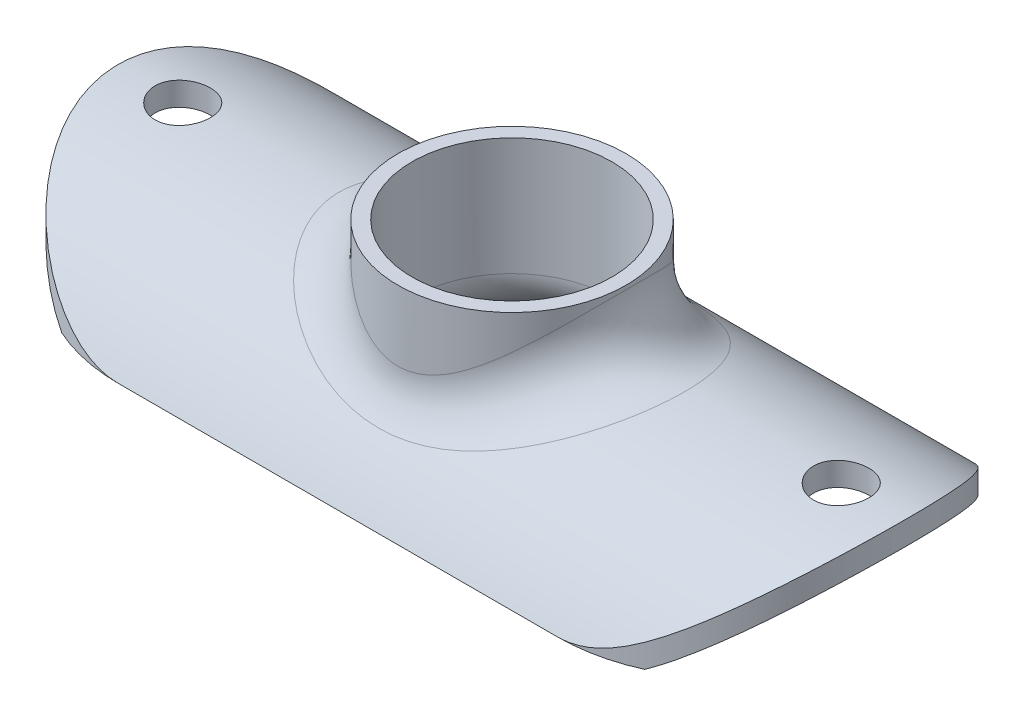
ISO-10303-21;
HEADER;
FILE_DESCRIPTION(('STEP AP214'),'2;1');
FILE_NAME('part.step','',(''),(''),'','','');
FILE_SCHEMA(('AUTOMOTIVE_DESIGN { 1 0 10303 214 1 1 1 1 }'));
ENDSEC;
DATA;
#1=APPLICATION_CONTEXT('core data for automotive mechanical design processes');
#2=APPLICATION_PROTOCOL_DEFINITION('international standard','automotive_design',2000,#1);
#3=PRODUCT_CONTEXT('',#1,'mechanical');
#4=PRODUCT('Part','Part','',(#3));
#5=PRODUCT_RELATED_PRODUCT_CATEGORY('part','',(#4));
#6=PRODUCT_DEFINITION_FORMATION('','',#4);
#7=PRODUCT_DEFINITION_CONTEXT('part definition',#1,'design');
#8=PRODUCT_DEFINITION('design','',#6,#7);
#9=PRODUCT_DEFINITION_SHAPE('','',#8);
#10=(LENGTH_UNIT() NAMED_UNIT(*) SI_UNIT(.MILLI.,.METRE.));
#11=(NAMED_UNIT(*) PLANE_ANGLE_UNIT() SI_UNIT($,.RADIAN.));
#12=(NAMED_UNIT(*) SI_UNIT($,.STERADIAN.) SOLID_ANGLE_UNIT());
#13=UNCERTAINTY_MEASURE_WITH_UNIT(LENGTH_MEASURE(1.E-05),#10,'distance_accuracy_value','');
#14=(GEOMETRIC_REPRESENTATION_CONTEXT(3) GLOBAL_UNCERTAINTY_ASSIGNED_CONTEXT((#13)) GLOBAL_UNIT_ASSIGNED_CONTEXT((#10,
#11,#12)) REPRESENTATION_CONTEXT('',''));
#15=CARTESIAN_POINT('',(0.,0.,0.));
#16=DIRECTION('',(0.,0.,1.));
#17=DIRECTION('',(1.,0.,0.));
#18=AXIS2_PLACEMENT_3D('',#15,#16,#17);
#19=CARTESIAN_POINT('',(33.5,-10.3319891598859,0.));
#20=DIRECTION('',(-1.,0.,0.));
#21=DIRECTION('',(0.,0.,1.));
#22=AXIS2_PLACEMENT_3D('',#19,#20,#21);
#23=CYLINDRICAL_SURFACE('',#22,17.);
#24=DIRECTION('',(-1.,0.,0.));
#25=VECTOR('',#24,1.);
#26=CARTESIAN_POINT('',(33.5,0.,-13.5));
#27=LINE('',#26,#25);
#28=CARTESIAN_POINT('',(9.75,0.,-13.5));
#29=VERTEX_POINT('',#28);
#30=CARTESIAN_POINT('',(-11.8122033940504,0.,-13.5));
#31=VERTEX_POINT('',#30);
#32=EDGE_CURVE('E226',#29,#31,#27,.T.);
#33=ORIENTED_EDGE('',*,*,#32,.F.);
#34=CARTESIAN_POINT('',(9.75,-10.3319891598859,0.));
#35=DIRECTION('',(-1.,0.,0.));
#36=DIRECTION('',(0.,0.,1.));
#37=AXIS2_PLACEMENT_3D('',#34,#35,#36);
#38=CIRCLE('',#37,17.);
#39=CARTESIAN_POINT('',(9.75,3.59415531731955,-9.75));
#40=VERTEX_POINT('',#39);
#41=EDGE_CURVE('E219',#40,#29,#38,.T.);
#42=ORIENTED_EDGE('',*,*,#41,.F.);
#43=DIRECTION('',(-1.,0.,0.));
#44=VECTOR('',#43,1.);
#45=CARTESIAN_POINT('',(33.5,3.59415531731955,-9.75));
#46=LINE('',#45,#44);
#47=CARTESIAN_POINT('',(-9.74999999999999,3.59415531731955,-9.75));
#48=VERTEX_POINT('',#47);
#49=EDGE_CURVE('E781',#40,#48,#46,.T.);
#50=ORIENTED_EDGE('',*,*,#49,.T.);
#51=CARTESIAN_POINT('',(-9.75,3.59415531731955,-9.75));
#52=CARTESIAN_POINT('',(-9.87454275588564,3.59415145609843,-9.7500013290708));
#53=CARTESIAN_POINT('',(-9.99906680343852,3.59582676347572,-9.74761313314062));
#54=CARTESIAN_POINT('',(-10.2478360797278,3.60249675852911,-9.73807741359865));
#55=CARTESIAN_POINT('',(-10.3720813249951,3.60749124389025,-9.73093018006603));
#56=CARTESIAN_POINT('',(-10.7437859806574,3.62738070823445,-9.70240006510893));
#57=CARTESIAN_POINT('',(-10.9904901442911,3.64718186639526,-9.67392867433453));
#58=CARTESIAN_POINT('',(-11.4778944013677,3.69886131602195,-9.59881622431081));
#59=CARTESIAN_POINT('',(-11.7186252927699,3.7306497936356,-9.5523102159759));
#60=CARTESIAN_POINT('',(-12.194342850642,3.80509330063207,-9.44178655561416));
#61=CARTESIAN_POINT('',(-12.4293285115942,3.84775021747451,-9.37776586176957));
#62=CARTESIAN_POINT('',(-12.8913790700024,3.94228060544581,-9.2332352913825));
#63=CARTESIAN_POINT('',(-13.1184673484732,3.99412349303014,-9.15277999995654));
#64=CARTESIAN_POINT('',(-13.5643864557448,4.10547565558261,-8.97610885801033));
#65=CARTESIAN_POINT('',(-13.7832174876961,4.16498474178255,-8.8798933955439));
#66=CARTESIAN_POINT('',(-14.4269893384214,4.35280344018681,-8.5682901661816));
#67=CARTESIAN_POINT('',(-14.8385985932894,4.49027204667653,-8.3301388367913));
#68=CARTESIAN_POINT('',(-15.4459353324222,4.71262396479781,-7.91755717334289));
#69=CARTESIAN_POINT('',(-15.6562706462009,4.79370840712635,-7.76188225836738));
#70=CARTESIAN_POINT('',(-16.0635128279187,4.95732779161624,-7.43439662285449));
#71=CARTESIAN_POINT('',(-16.2604188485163,5.03986282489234,-7.26258488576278));
#72=CARTESIAN_POINT('',(-16.6400055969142,5.20443242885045,-6.90352342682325));
#73=CARTESIAN_POINT('',(-16.8226795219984,5.28646674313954,-6.71626640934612));
#74=CARTESIAN_POINT('',(-17.1728045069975,5.44810677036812,-6.32715886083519));
#75=CARTESIAN_POINT('',(-17.3402604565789,5.52771325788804,-6.12531305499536));
#76=CARTESIAN_POINT('',(-17.6744293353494,5.69020638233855,-5.68760528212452));
#77=CARTESIAN_POINT('',(-17.8395161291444,5.77267004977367,-5.4503396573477));
#78=CARTESIAN_POINT('',(-18.1489274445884,5.93029111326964,-4.96029089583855));
#79=CARTESIAN_POINT('',(-18.2932502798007,6.00544791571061,-4.70750650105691));
#80=CARTESIAN_POINT('',(-18.5595258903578,6.14625356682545,-4.18806314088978));
#81=CARTESIAN_POINT('',(-18.6814920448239,6.21190809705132,-3.92141259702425));
#82=CARTESIAN_POINT('',(-18.9015970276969,6.33176496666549,-3.37597663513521));
#83=CARTESIAN_POINT('',(-18.999739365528,6.38596899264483,-3.09719301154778));
#84=CARTESIAN_POINT('',(-19.1631412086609,6.47695337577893,-2.55502609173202));
#85=CARTESIAN_POINT('',(-19.2305486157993,6.51485444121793,-2.29247756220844));
#86=CARTESIAN_POINT('',(-19.3434432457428,6.57864293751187,-1.76126570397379));
#87=CARTESIAN_POINT('',(-19.3889316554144,6.60453101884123,-1.49260270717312));
#88=CARTESIAN_POINT('',(-19.4572692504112,6.64351639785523,-0.951678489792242));
#89=CARTESIAN_POINT('',(-19.4801341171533,6.65662255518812,-0.679419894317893));
#90=CARTESIAN_POINT('',(-19.5029081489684,6.66967620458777,-0.133638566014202));
#91=CARTESIAN_POINT('',(-19.5028193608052,6.66962486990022,0.13988405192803));
#92=CARTESIAN_POINT('',(-19.4810156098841,6.65712819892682,0.654554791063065));
#93=CARTESIAN_POINT('',(-19.4617617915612,6.64609335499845,0.895846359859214));
#94=CARTESIAN_POINT('',(-19.4054863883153,6.61396555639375,1.37565049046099));
#95=CARTESIAN_POINT('',(-19.3684664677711,6.59287354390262,1.61416331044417));
#96=CARTESIAN_POINT('',(-19.277106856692,6.54112112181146,2.08678549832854));
#97=CARTESIAN_POINT('',(-19.2227667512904,6.51046048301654,2.32089476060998));
#98=CARTESIAN_POINT('',(-19.0973797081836,6.44025906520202,2.78322977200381));
#99=CARTESIAN_POINT('',(-19.0263321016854,6.40071793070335,3.01145528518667));
#100=CARTESIAN_POINT('',(-18.8675960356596,6.31323945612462,3.46260153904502));
#101=CARTESIAN_POINT('',(-18.7797727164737,6.26523433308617,3.68546156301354));
#102=CARTESIAN_POINT('',(-18.5886612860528,6.16203896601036,4.1228075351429));
#103=CARTESIAN_POINT('',(-18.4853676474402,6.10684615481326,4.3372904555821));
#104=CARTESIAN_POINT('',(-18.2641893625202,5.99039066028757,4.75681659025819));
#105=CARTESIAN_POINT('',(-18.1463071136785,5.92912897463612,4.96186134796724));
#106=CARTESIAN_POINT('',(-17.8967095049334,5.8016669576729,5.361829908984));
#107=CARTESIAN_POINT('',(-17.764989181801,5.73546485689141,5.55675004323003));
#108=CARTESIAN_POINT('',(-17.4728396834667,5.59163480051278,5.95721749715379));
#109=CARTESIAN_POINT('',(-17.3108486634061,5.51356208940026,6.16146703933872));
#110=CARTESIAN_POINT('',(-16.9716660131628,5.3545502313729,6.55573626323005));
#111=CARTESIAN_POINT('',(-16.7944732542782,5.27361087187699,6.74575488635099));
#112=CARTESIAN_POINT('',(-16.425506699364,5.11056453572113,7.11108999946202));
#113=CARTESIAN_POINT('',(-16.2337136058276,5.02845613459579,7.28638636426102));
#114=CARTESIAN_POINT('',(-15.8365455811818,4.86507552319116,7.62128226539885));
#115=CARTESIAN_POINT('',(-15.6311703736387,4.78380332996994,7.78088148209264));
#116=CARTESIAN_POINT('',(-15.1860332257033,4.61596228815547,8.09903042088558));
#117=CARTESIAN_POINT('',(-14.9448979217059,4.5296947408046,8.25582453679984));
#118=CARTESIAN_POINT('',(-14.4480432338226,4.36339520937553,8.54833314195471));
#119=CARTESIAN_POINT('',(-14.1923216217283,4.28336418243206,8.68404439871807));
#120=CARTESIAN_POINT('',(-13.6683092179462,4.13272193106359,8.9327048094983));
#121=CARTESIAN_POINT('',(-13.4000564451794,4.06208443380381,9.04571792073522));
#122=CARTESIAN_POINT('',(-12.851956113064,3.93296154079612,9.24800576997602));
#123=CARTESIAN_POINT('',(-12.5721131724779,3.87447135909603,9.3372898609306));
#124=CARTESIAN_POINT('',(-12.0834897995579,3.78687485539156,9.46900372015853));
#125=CARTESIAN_POINT('',(-11.8769865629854,3.75413628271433,9.51754361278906));
#126=CARTESIAN_POINT('',(-11.4601508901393,3.69724817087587,9.60120049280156));
#127=CARTESIAN_POINT('',(-11.2498196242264,3.67309605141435,9.63632151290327));
#128=CARTESIAN_POINT('',(-10.8253629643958,3.63401008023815,9.69289045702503));
#129=CARTESIAN_POINT('',(-10.6112236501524,3.61912410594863,9.71426738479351));
#130=CARTESIAN_POINT('',(-10.1813989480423,3.59916564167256,9.74284255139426));
#131=CARTESIAN_POINT('',(-9.96571257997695,3.59410005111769,9.75003082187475));
#132=CARTESIAN_POINT('',(-9.75,3.59415531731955,9.75));
#133=B_SPLINE_CURVE_WITH_KNOTS('',3,(#51,#52,#53,#54,#55,#56,#57,#58,#59,#60,#61,#62,#63,#64,
#65,#66,#67,#68,#69,#70,#71,#72,#73,#74,#75,#76,#77,#78,#79,#80,#81,#82,#83,#84,#85,#86,#87,#88,
#89,#90,#91,#92,#93,#94,#95,#96,#97,#98,#99,#100,#101,#102,#103,#104,#105,#106,#107,#108,#109,
#110,#111,#112,#113,#114,#115,#116,#117,#118,#119,#120,#121,#122,#123,#124,#125,#126,#127,#128,
#129,#130,#131,#132),.UNSPECIFIED.,.F.,.F.,(4,2,2,2,2,2,2,2,2,2,2,2,2,2,2,2,2,2,2,2,2,2,2,2,2,2,
2,2,2,2,2,2,2,2,2,2,2,2,2,2,4),(0.,0.373557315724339,0.747091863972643,1.49333670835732,
2.23409802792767,2.97498807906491,3.71345625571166,4.45190625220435,5.93074780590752,
6.75199052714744,7.57328501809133,8.39496969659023,9.21638942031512,10.1169528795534,
11.0175894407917,11.9176852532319,12.8176483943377,13.6375897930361,14.4574867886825,
15.2768150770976,16.0960703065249,16.8221345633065,17.5481308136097,18.274144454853,
19.0001871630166,19.7323328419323,20.4647407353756,21.1970284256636,21.9295796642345,
22.7451217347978,23.5607244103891,24.3774244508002,25.194141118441,26.0938729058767,
26.9937425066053,27.891039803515,28.7879828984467,29.4313425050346,30.0745086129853,
30.7209709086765,31.3678872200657),.UNSPECIFIED.);
#134=CARTESIAN_POINT('',(-11.8122033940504,3.74601435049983,-9.5294185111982));
#135=VERTEX_POINT('',#134);
#136=EDGE_CURVE('E369',#48,#135,#133,.T.);
#137=ORIENTED_EDGE('',*,*,#136,.T.);
#138=CARTESIAN_POINT('',(-11.8122033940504,-10.3319891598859,0.));
#139=DIRECTION('',(1.,0.,0.));
#140=DIRECTION('',(0.,0.,-1.));
#141=AXIS2_PLACEMENT_3D('',#138,#139,#140);
#142=CIRCLE('',#141,17.);
#143=EDGE_CURVE('E793',#31,#135,#142,.T.);
#144=ORIENTED_EDGE('',*,*,#143,.F.);
#145=EDGE_LOOP('',(#33,#42,#50,#137,#144));
#146=FACE_BOUND('',#145,.T.);
#147=ADVANCED_FACE('F63',(#146),#23,.F.);
#148=CARTESIAN_POINT('',(-28.,6.50480091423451,-2.35));
#149=CARTESIAN_POINT('',(-27.8686778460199,6.50480296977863,-2.34999449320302));
#150=CARTESIAN_POINT('',(-27.737276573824,6.50635393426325,-2.33895504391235));
#151=CARTESIAN_POINT('',(-27.4781395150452,6.51238693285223,-2.29509589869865));
#152=CARTESIAN_POINT('',(-27.350407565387,6.51687192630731,-2.26225421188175));
#153=CARTESIAN_POINT('',(-27.1023980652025,6.52825550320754,-2.17578472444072));
#154=CARTESIAN_POINT('',(-26.9821151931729,6.53515233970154,-2.12217196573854));
#155=CARTESIAN_POINT('',(-26.7522728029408,6.55058041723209,-1.99571611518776));
#156=CARTESIAN_POINT('',(-26.6427116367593,6.55911140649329,-1.92287598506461));
#157=CARTESIAN_POINT('',(-26.4366561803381,6.57691163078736,-1.75950208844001));
#158=CARTESIAN_POINT('',(-26.340245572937,6.58618504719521,-1.66886322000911));
#159=CARTESIAN_POINT('',(-26.1639520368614,6.60438779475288,-1.47269143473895));
#160=CARTESIAN_POINT('',(-26.0840699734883,6.61331710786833,-1.3671577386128));
#161=CARTESIAN_POINT('',(-25.9427962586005,6.6298688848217,-1.14366052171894));
#162=CARTESIAN_POINT('',(-25.8814810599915,6.63748589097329,-1.02564823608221));
#163=CARTESIAN_POINT('',(-25.7795717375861,6.65050867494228,-0.780878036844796));
#164=CARTESIAN_POINT('',(-25.7389766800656,6.65591455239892,-0.65412051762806));
#165=CARTESIAN_POINT('',(-25.6799119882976,6.66387650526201,-0.396317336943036));
#166=CARTESIAN_POINT('',(-25.6613026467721,6.66645056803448,-0.265304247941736));
#167=CARTESIAN_POINT('',(-25.6463042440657,6.66852040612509,-0.00199129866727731));
#168=CARTESIAN_POINT('',(-25.6499141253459,6.66801632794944,0.13030850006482));
#169=CARTESIAN_POINT('',(-25.6791406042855,6.6640011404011,0.391487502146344));
#170=CARTESIAN_POINT('',(-25.7046069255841,6.66051056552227,0.520383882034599));
#171=CARTESIAN_POINT('',(-25.7765879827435,6.65093752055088,0.772055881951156));
#172=CARTESIAN_POINT('',(-25.8231031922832,6.64485499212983,0.894831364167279));
#173=CARTESIAN_POINT('',(-25.9360184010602,6.63074608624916,1.13123638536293));
#174=CARTESIAN_POINT('',(-26.0024825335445,6.62271345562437,1.24483490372));
#175=CARTESIAN_POINT('',(-26.1533621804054,6.60560129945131,1.45932303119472));
#176=CARTESIAN_POINT('',(-26.237778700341,6.59652171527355,1.5602119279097));
#177=CARTESIAN_POINT('',(-26.4230062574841,6.5782404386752,1.74730134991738));
#178=CARTESIAN_POINT('',(-26.5239483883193,6.56903835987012,1.83337210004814));
#179=CARTESIAN_POINT('',(-26.738913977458,6.55162365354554,1.98737096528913));
#180=CARTESIAN_POINT('',(-26.8529374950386,6.54341103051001,2.0552989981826));
#181=CARTESIAN_POINT('',(-27.0909547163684,6.52890533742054,2.17109671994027));
#182=CARTESIAN_POINT('',(-27.2149542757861,6.52261340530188,2.21895452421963));
#183=CARTESIAN_POINT('',(-27.4693368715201,6.51268259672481,2.29313038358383));
#184=CARTESIAN_POINT('',(-27.5997195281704,6.50904356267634,2.3194497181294));
#185=CARTESIAN_POINT('',(-27.8620167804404,6.50485997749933,2.34962656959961));
#186=CARTESIAN_POINT('',(-27.9939098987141,6.50429017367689,2.3536673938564));
#187=CARTESIAN_POINT('',(-28.2564913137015,6.50624265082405,2.33965757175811));
#188=CARTESIAN_POINT('',(-28.3871796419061,6.50876485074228,2.3216075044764));
#189=CARTESIAN_POINT('',(-28.6430829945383,6.51659402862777,2.26408319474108));
#190=CARTESIAN_POINT('',(-28.7683186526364,6.52188929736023,2.22469901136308));
#191=CARTESIAN_POINT('',(-29.0104098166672,6.53465840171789,2.12571763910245));
#192=CARTESIAN_POINT('',(-29.1272649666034,6.54213232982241,2.06611959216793));
#193=CARTESIAN_POINT('',(-29.3501035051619,6.55847662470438,1.9279567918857));
#194=CARTESIAN_POINT('',(-29.4560122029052,6.56735565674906,1.8492726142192));
#195=CARTESIAN_POINT('',(-29.6531864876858,6.58548308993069,1.67533849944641));
#196=CARTESIAN_POINT('',(-29.7444513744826,6.59473150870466,1.58008777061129));
#197=CARTESIAN_POINT('',(-29.9103985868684,6.61263392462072,1.3749202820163));
#198=CARTESIAN_POINT('',(-29.9849599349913,6.62128329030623,1.26490520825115));
#199=CARTESIAN_POINT('',(-30.1145435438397,6.63694245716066,1.03380556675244));
#200=CARTESIAN_POINT('',(-30.1695662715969,6.64395229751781,0.912721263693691));
#201=CARTESIAN_POINT('',(-30.25831424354,6.65552218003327,0.66330993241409));
#202=CARTESIAN_POINT('',(-30.2921074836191,6.66009003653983,0.53500747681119));
#203=CARTESIAN_POINT('',(-30.3376578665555,6.66629391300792,0.274481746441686));
#204=CARTESIAN_POINT('',(-30.3494162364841,6.66793009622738,0.142258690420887));
#205=CARTESIAN_POINT('',(-30.3505366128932,6.6680850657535,-0.121177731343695));
#206=CARTESIAN_POINT('',(-30.3400844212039,6.66662971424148,-0.252390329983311));
#207=CARTESIAN_POINT('',(-30.2974762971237,6.66081690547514,-0.511174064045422));
#208=CARTESIAN_POINT('',(-30.2653204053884,6.65645945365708,-0.638745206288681));
#209=CARTESIAN_POINT('',(-30.1802799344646,6.64532973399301,-0.886586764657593));
#210=CARTESIAN_POINT('',(-30.1274062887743,6.63855874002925,-1.00686099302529));
#211=CARTESIAN_POINT('',(-30.0024506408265,6.62334860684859,-1.23685952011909));
#212=CARTESIAN_POINT('',(-29.93036820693,6.61490943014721,-1.3465835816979));
#213=CARTESIAN_POINT('',(-29.7683613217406,6.59721887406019,-1.55331313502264));
#214=CARTESIAN_POINT('',(-29.6782990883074,6.58796155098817,-1.65021015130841));
#215=CARTESIAN_POINT('',(-29.4831781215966,6.56972386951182,-1.82758539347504));
#216=CARTESIAN_POINT('',(-29.3781158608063,6.56074357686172,-1.90805974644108));
#217=CARTESIAN_POINT('',(-29.1553983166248,6.54403132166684,-2.05064033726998));
#218=CARTESIAN_POINT('',(-29.0376857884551,6.53630546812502,-2.11265784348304));
#219=CARTESIAN_POINT('',(-28.7934696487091,6.52304834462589,-2.21595276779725));
#220=CARTESIAN_POINT('',(-28.6669755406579,6.51751474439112,-2.25725222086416));
#221=CARTESIAN_POINT('',(-28.449890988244,6.51057944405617,-2.30831068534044));
#222=CARTESIAN_POINT('',(-28.3606561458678,6.50842363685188,-2.32392097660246));
#223=CARTESIAN_POINT('',(-28.1809600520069,6.50553367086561,-2.34476747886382));
#224=CARTESIAN_POINT('',(-28.0904988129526,6.50479949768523,-2.35000379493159));
#225=CARTESIAN_POINT('',(-28.,6.50480091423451,-2.35));
#226=B_SPLINE_CURVE_WITH_KNOTS('',3,(#148,#149,#150,#151,#152,#153,#154,#155,#156,#157,#158,
#159,#160,#161,#162,#163,#164,#165,#166,#167,#168,#169,#170,#171,#172,#173,#174,#175,#176,#177,
#178,#179,#180,#181,#182,#183,#184,#185,#186,#187,#188,#189,#190,#191,#192,#193,#194,#195,#196,
#197,#198,#199,#200,#201,#202,#203,#204,#205,#206,#207,#208,#209,#210,#211,#212,#213,#214,#215,
#216,#217,#218,#219,#220,#221,#222,#223,#224,#225),.UNSPECIFIED.,.T.,.F.,(4,2,2,2,2,2,2,2,2,2,2,
2,2,2,2,2,2,2,2,2,2,2,2,2,2,2,2,2,2,2,2,2,2,2,2,2,2,2,4),(0.,0.393635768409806,
0.787669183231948,1.18141778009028,1.57510576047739,1.97119245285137,2.36729987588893,
2.76501684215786,3.16271588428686,3.55787393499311,3.95301317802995,4.34545716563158,
4.7379099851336,5.13163825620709,5.52538858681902,5.92242896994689,6.31947115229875,
6.71674811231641,7.11400147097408,7.50798130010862,7.90195080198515,8.2942700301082,
8.6866059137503,9.08146306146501,9.47633908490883,9.8739886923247,10.2716287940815,
10.6679887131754,11.0643265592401,11.4573619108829,11.8503965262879,12.2432240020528,
12.6360603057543,13.0320312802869,13.4280955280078,13.8260341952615,14.2235487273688,
14.4948200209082,14.7660885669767),.UNSPECIFIED.);
#227=CARTESIAN_POINT('',(-28.,6.50480091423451,-2.35));
#228=VERTEX_POINT('',#227);
#229=EDGE_CURVE('E459',#228,#228,#226,.T.);
#230=ORIENTED_EDGE('',*,*,#229,.F.);
#231=EDGE_LOOP('',(#230));
#232=FACE_BOUND('',#231,.T.);
#233=CARTESIAN_POINT('',(-12.6122033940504,0.,-13.5));
#234=VERTEX_POINT('',#233);
#235=CARTESIAN_POINT('',(-24.7914978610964,0.,-13.5));
#236=VERTEX_POINT('',#235);
#237=EDGE_CURVE('E228',#234,#236,#27,.T.);
#238=ORIENTED_EDGE('',*,*,#237,.F.);
#239=CARTESIAN_POINT('',(-12.6122033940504,-10.3319891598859,0.));
#240=DIRECTION('',(-1.,0.,0.));
#241=DIRECTION('',(0.,0.,1.));
#242=AXIS2_PLACEMENT_3D('',#239,#240,#241);
#243=CIRCLE('',#242,17.);
#244=CARTESIAN_POINT('',(-12.6122033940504,3.88524363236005,-9.3204233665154));
#245=VERTEX_POINT('',#244);
#246=EDGE_CURVE('E79',#245,#234,#243,.T.);
#247=ORIENTED_EDGE('',*,*,#246,.F.);
#248=CARTESIAN_POINT('',(-12.6122033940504,3.88524363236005,9.32042336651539));
#249=VERTEX_POINT('',#248);
#250=EDGE_CURVE('E378',#245,#249,#133,.T.);
#251=ORIENTED_EDGE('',*,*,#250,.T.);
#252=CARTESIAN_POINT('',(-12.6122033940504,-10.3319891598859,0.));
#253=DIRECTION('',(-1.,0.,0.));
#254=DIRECTION('',(0.,0.,1.));
#255=AXIS2_PLACEMENT_3D('',#252,#253,#254);
#256=CIRCLE('',#255,17.);
#257=CARTESIAN_POINT('',(-12.6122033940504,0.,13.5));
#258=VERTEX_POINT('',#257);
#259=EDGE_CURVE('E404',#258,#249,#256,.T.);
#260=ORIENTED_EDGE('',*,*,#259,.F.);
#261=DIRECTION('',(-1.,0.,0.));
#262=VECTOR('',#261,1.);
#263=CARTESIAN_POINT('',(33.5,0.,13.5));
#264=LINE('',#263,#262);
#265=CARTESIAN_POINT('',(-24.7914978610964,0.,13.5));
#266=VERTEX_POINT('',#265);
#267=EDGE_CURVE('E249',#258,#266,#264,.T.);
#268=ORIENTED_EDGE('',*,*,#267,.T.);
#269=CARTESIAN_POINT('',(-24.7914978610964,0.,13.5));
#270=CARTESIAN_POINT('',(-25.0440989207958,0.14946555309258,13.3856415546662));
#271=CARTESIAN_POINT('',(-25.2919701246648,0.30197099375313,13.2649586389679));
#272=CARTESIAN_POINT('',(-25.7785818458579,0.611044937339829,13.011139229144));
#273=CARTESIAN_POINT('',(-26.0173237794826,0.767612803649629,12.8780046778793));
#274=CARTESIAN_POINT('',(-26.4864420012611,1.08308313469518,12.5992291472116));
#275=CARTESIAN_POINT('',(-26.7168049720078,1.24198879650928,12.4535693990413));
#276=CARTESIAN_POINT('',(-27.1689083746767,1.56030574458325,12.1499677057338));
#277=CARTESIAN_POINT('',(-27.3906484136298,1.71971705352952,11.9920252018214));
#278=CARTESIAN_POINT('',(-28.0472777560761,2.1997028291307,11.4964955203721));
#279=CARTESIAN_POINT('',(-28.4690460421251,2.51892538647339,11.1398957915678));
#280=CARTESIAN_POINT('',(-29.2752116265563,3.14306007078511,10.3762291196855));
#281=CARTESIAN_POINT('',(-29.6596417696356,3.44798465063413,9.96920726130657));
#282=CARTESIAN_POINT('',(-30.2574454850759,3.92976662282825,9.25827055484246));
#283=CARTESIAN_POINT('',(-30.4829974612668,4.11357396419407,8.96922774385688));
#284=CARTESIAN_POINT('',(-30.9152211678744,4.46877253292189,8.37010571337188));
#285=CARTESIAN_POINT('',(-31.1218949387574,4.64016510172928,8.06002877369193));
#286=CARTESIAN_POINT('',(-31.5135860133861,4.96716983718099,7.4205266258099));
#287=CARTESIAN_POINT('',(-31.6986844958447,5.12284084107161,7.09118144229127));
#288=CARTESIAN_POINT('',(-32.045856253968,5.41635873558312,6.41295456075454));
#289=CARTESIAN_POINT('',(-32.2079331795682,5.55420845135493,6.06407597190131));
#290=CARTESIAN_POINT('',(-32.4810577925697,5.78745253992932,5.40951353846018));
#291=CARTESIAN_POINT('',(-32.5960924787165,5.88607622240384,5.1066399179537));
#292=CARTESIAN_POINT('',(-32.8072042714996,6.06755764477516,4.48978521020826));
#293=CARTESIAN_POINT('',(-32.9032850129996,6.15041840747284,4.17580626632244));
#294=CARTESIAN_POINT('',(-33.0751535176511,6.29893789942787,3.53827630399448));
#295=CARTESIAN_POINT('',(-33.1509377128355,6.36459360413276,3.21472361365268));
#296=CARTESIAN_POINT('',(-33.2809831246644,6.47741493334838,2.56012224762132));
#297=CARTESIAN_POINT('',(-33.3352440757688,6.52458032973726,2.22907347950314));
#298=CARTESIAN_POINT('',(-33.4214772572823,6.59959626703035,1.56046333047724));
#299=CARTESIAN_POINT('',(-33.4533544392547,6.62736443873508,1.22288035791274));
#300=CARTESIAN_POINT('',(-33.4938538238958,6.66265083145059,0.545259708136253));
#301=CARTESIAN_POINT('',(-33.5024760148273,6.6701690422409,0.205222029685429));
#302=CARTESIAN_POINT('',(-33.4963012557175,6.66478684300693,-0.474429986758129));
#303=CARTESIAN_POINT('',(-33.4815074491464,6.6518891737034,-0.81404437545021));
#304=CARTESIAN_POINT('',(-33.4287874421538,6.60596894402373,-1.49008511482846));
#305=CARTESIAN_POINT('',(-33.3908619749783,6.57294702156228,-1.82651156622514));
#306=CARTESIAN_POINT('',(-33.2960517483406,6.4905199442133,-2.46999765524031));
#307=CARTESIAN_POINT('',(-33.2406933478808,6.44243499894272,-2.77745461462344));
#308=CARTESIAN_POINT('',(-33.1114331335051,6.3303711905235,-3.38545392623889));
#309=CARTESIAN_POINT('',(-33.0375327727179,6.26639357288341,-3.68599681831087));
#310=CARTESIAN_POINT('',(-32.8721910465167,6.12360126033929,-4.27860353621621));
#311=CARTESIAN_POINT('',(-32.7807489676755,6.04478596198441,-4.57066701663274));
#312=CARTESIAN_POINT('',(-32.5814383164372,5.87351505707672,-5.14504567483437));
#313=CARTESIAN_POINT('',(-32.4735666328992,5.78105686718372,-5.42735899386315));
#314=CARTESIAN_POINT('',(-32.2050330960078,5.55172963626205,-6.07116791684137));
#315=CARTESIAN_POINT('',(-32.0386032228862,5.41018829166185,-6.42860952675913));
#316=CARTESIAN_POINT('',(-31.681599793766,5.10843754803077,-7.12296594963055));
#317=CARTESIAN_POINT('',(-31.491019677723,4.9482230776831,-7.45987514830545));
#318=CARTESIAN_POINT('',(-31.0877172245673,4.61175560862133,-8.11293524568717));
#319=CARTESIAN_POINT('',(-30.8749446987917,4.43546637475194,-8.42903633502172));
#320=CARTESIAN_POINT('',(-30.4297823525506,4.07009765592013,-9.03915759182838));
#321=CARTESIAN_POINT('',(-30.1973925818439,3.88101820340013,-9.33317781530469));
#322=CARTESIAN_POINT('',(-29.64622520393,3.43775434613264,-9.97938561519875));
#323=CARTESIAN_POINT('',(-29.3216446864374,3.18031903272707,-10.324407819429));
#324=CARTESIAN_POINT('',(-28.6456210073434,2.65468695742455,-10.9782640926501));
#325=CARTESIAN_POINT('',(-28.2941648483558,2.38648501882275,-11.2870804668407));
#326=CARTESIAN_POINT('',(-27.5667111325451,1.84601551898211,-11.8681638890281));
#327=CARTESIAN_POINT('',(-27.1907625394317,1.57375686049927,-12.1405007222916));
#328=CARTESIAN_POINT('',(-26.4140966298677,1.03164972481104,-12.6493303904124));
#329=CARTESIAN_POINT('',(-26.0133986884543,0.76179954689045,-12.8858507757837));
#330=CARTESIAN_POINT('',(-25.467660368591,0.413207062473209,-13.1739440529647));
#331=CARTESIAN_POINT('',(-25.3342714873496,0.329421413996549,-13.2418121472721));
#332=CARTESIAN_POINT('',(-25.0648945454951,0.163448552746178,-13.3737429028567));
#333=CARTESIAN_POINT('',(-24.9289096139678,0.0812596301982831,-13.4378098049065));
#334=CARTESIAN_POINT('',(-24.7914978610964,0.,-13.5));
#335=B_SPLINE_CURVE_WITH_KNOTS('',3,(#269,#270,#271,#272,#273,#274,#275,#276,#277,#278,#279,
#280,#281,#282,#283,#284,#285,#286,#287,#288,#289,#290,#291,#292,#293,#294,#295,#296,#297,#298,
#299,#300,#301,#302,#303,#304,#305,#306,#307,#308,#309,#310,#311,#312,#313,#314,#315,#316,#317,
#318,#319,#320,#321,#322,#323,#324,#325,#326,#327,#328,#329,#330,#331,#332,#333,#334),
.UNSPECIFIED.,.F.,.F.,(4,2,2,2,2,2,2,2,2,2,2,2,2,2,2,2,2,2,2,2,2,2,2,2,2,2,2,2,2,2,2,2,4),(0.,
0.94480703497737,1.88946689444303,2.83556783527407,3.78171184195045,5.69226939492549,
7.60113079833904,8.83050083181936,10.0597378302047,11.2841892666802,12.5084463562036,
13.5234364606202,14.5382317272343,15.5532052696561,16.5681913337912,17.5874616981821,
18.606732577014,19.6258666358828,20.644968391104,21.5921719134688,22.5393012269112,
23.4864690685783,24.4338164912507,25.6887691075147,26.9440633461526,28.2022606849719,
29.4604548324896,31.0756337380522,32.6915987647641,34.3044269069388,35.9160080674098,
36.4305124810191,36.9444316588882),.UNSPECIFIED.);
#336=EDGE_CURVE('E388',#266,#236,#335,.T.);
#337=ORIENTED_EDGE('',*,*,#336,.T.);
#338=EDGE_LOOP('',(#238,#247,#251,#260,#268,#337));
#339=FACE_BOUND('',#338,.T.);
#340=ADVANCED_FACE('F401',(#232,#339),#23,.F.);
#341=CARTESIAN_POINT('',(-9.75,8.67001084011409,0.));
#342=DIRECTION('',(0.,-1.,0.));
#343=DIRECTION('',(0.,0.,-1.));
#344=AXIS2_PLACEMENT_3D('',#341,#342,#343);
#345=CYLINDRICAL_SURFACE('',#344,9.75);
#346=CARTESIAN_POINT('',(-9.75,0.,0.));
#347=DIRECTION('',(0.,1.,0.));
#348=DIRECTION('',(0.,0.,1.));
#349=AXIS2_PLACEMENT_3D('',#346,#347,#348);
#350=CIRCLE('',#349,9.75);
#351=CARTESIAN_POINT('',(-9.75,0.,-9.75));
#352=VERTEX_POINT('',#351);
#353=CARTESIAN_POINT('',(-11.8122033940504,0.,-9.5294185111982));
#354=VERTEX_POINT('',#353);
#355=EDGE_CURVE('E507',#352,#354,#350,.T.);
#356=ORIENTED_EDGE('',*,*,#355,.T.);
#357=DIRECTION('',(0.,-1.,0.));
#358=VECTOR('',#357,1.);
#359=CARTESIAN_POINT('',(-11.8122033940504,8.67001084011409,-9.5294185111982));
#360=LINE('',#359,#358);
#361=EDGE_CURVE('E436',#354,#135,#360,.F.);
#362=ORIENTED_EDGE('',*,*,#361,.T.);
#363=ORIENTED_EDGE('',*,*,#136,.F.);
#364=DIRECTION('',(0.,-1.,0.));
#365=VECTOR('',#364,1.);
#366=CARTESIAN_POINT('',(-9.75,8.67001084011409,-9.75));
#367=LINE('',#366,#365);
#368=EDGE_CURVE('E510',#48,#352,#367,.T.);
#369=ORIENTED_EDGE('',*,*,#368,.T.);
#370=EDGE_LOOP('',(#356,#362,#363,#369));
#371=FACE_BOUND('',#370,.T.);
#372=ADVANCED_FACE('F365',(#371),#345,.T.);
#373=CARTESIAN_POINT('',(28.,6.50480091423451,-2.35000000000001));
#374=CARTESIAN_POINT('',(28.1313221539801,6.50480296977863,-2.34999449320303));
#375=CARTESIAN_POINT('',(28.262723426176,6.50635393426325,-2.33895504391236));
#376=CARTESIAN_POINT('',(28.5218604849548,6.51238693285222,-2.29509589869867));
#377=CARTESIAN_POINT('',(28.649592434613,6.5168719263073,-2.26225421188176));
#378=CARTESIAN_POINT('',(28.8976019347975,6.52825550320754,-2.17578472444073));
#379=CARTESIAN_POINT('',(29.0178848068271,6.53515233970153,-2.12217196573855));
#380=CARTESIAN_POINT('',(29.2477271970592,6.55058041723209,-1.99571611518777));
#381=CARTESIAN_POINT('',(29.3572883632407,6.55911140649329,-1.92287598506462));
#382=CARTESIAN_POINT('',(29.5633438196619,6.57691163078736,-1.75950208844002));
#383=CARTESIAN_POINT('',(29.659754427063,6.58618504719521,-1.66886322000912));
#384=CARTESIAN_POINT('',(29.8360479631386,6.60438779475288,-1.47269143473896));
#385=CARTESIAN_POINT('',(29.9159300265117,6.61331710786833,-1.36715773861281));
#386=CARTESIAN_POINT('',(30.0572037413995,6.6298688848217,-1.14366052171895));
#387=CARTESIAN_POINT('',(30.1185189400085,6.63748589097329,-1.02564823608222));
#388=CARTESIAN_POINT('',(30.2204282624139,6.65050867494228,-0.780878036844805));
#389=CARTESIAN_POINT('',(30.2610233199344,6.65591455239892,-0.65412051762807));
#390=CARTESIAN_POINT('',(30.3200880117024,6.66387650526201,-0.396317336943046));
#391=CARTESIAN_POINT('',(30.3386973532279,6.66645056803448,-0.265304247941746));
#392=CARTESIAN_POINT('',(30.3536957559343,6.66852040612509,-0.00199129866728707));
#393=CARTESIAN_POINT('',(30.3500858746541,6.66801632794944,0.13030850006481));
#394=CARTESIAN_POINT('',(30.3208593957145,6.6640011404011,0.391487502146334));
#395=CARTESIAN_POINT('',(30.2953930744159,6.66051056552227,0.520383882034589));
#396=CARTESIAN_POINT('',(30.2234120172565,6.65093752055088,0.772055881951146));
#397=CARTESIAN_POINT('',(30.1768968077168,6.64485499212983,0.894831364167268));
#398=CARTESIAN_POINT('',(30.0639815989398,6.63074608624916,1.13123638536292));
#399=CARTESIAN_POINT('',(29.9975174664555,6.62271345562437,1.24483490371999));
#400=CARTESIAN_POINT('',(29.8466378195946,6.60560129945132,1.45932303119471));
#401=CARTESIAN_POINT('',(29.762221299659,6.59652171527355,1.56021192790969));
#402=CARTESIAN_POINT('',(29.5769937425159,6.5782404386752,1.74730134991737));
#403=CARTESIAN_POINT('',(29.4760516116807,6.56903835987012,1.83337210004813));
#404=CARTESIAN_POINT('',(29.261086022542,6.55162365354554,1.98737096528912));
#405=CARTESIAN_POINT('',(29.1470625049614,6.54341103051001,2.05529899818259));
#406=CARTESIAN_POINT('',(28.9090452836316,6.52890533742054,2.17109671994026));
#407=CARTESIAN_POINT('',(28.7850457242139,6.52261340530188,2.21895452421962));
#408=CARTESIAN_POINT('',(28.5306631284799,6.51268259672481,2.29313038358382));
#409=CARTESIAN_POINT('',(28.4002804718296,6.50904356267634,2.31944971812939));
#410=CARTESIAN_POINT('',(28.1379832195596,6.50485997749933,2.3496265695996));
#411=CARTESIAN_POINT('',(28.0060901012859,6.5042901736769,2.35366739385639));
#412=CARTESIAN_POINT('',(27.7435086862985,6.50624265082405,2.3396575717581));
#413=CARTESIAN_POINT('',(27.6128203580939,6.50876485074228,2.32160750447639));
#414=CARTESIAN_POINT('',(27.3569170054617,6.51659402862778,2.26408319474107));
#415=CARTESIAN_POINT('',(27.2316813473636,6.52188929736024,2.22469901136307));
#416=CARTESIAN_POINT('',(26.9895901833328,6.53465840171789,2.12571763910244));
#417=CARTESIAN_POINT('',(26.8727350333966,6.54213232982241,2.06611959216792));
#418=CARTESIAN_POINT('',(26.6498964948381,6.55847662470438,1.92795679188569));
#419=CARTESIAN_POINT('',(26.5439877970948,6.56735565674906,1.84927261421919));
#420=CARTESIAN_POINT('',(26.3468135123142,6.58548308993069,1.6753384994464));
#421=CARTESIAN_POINT('',(26.2555486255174,6.59473150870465,1.58008777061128));
#422=CARTESIAN_POINT('',(26.0896014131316,6.61263392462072,1.37492028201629));
#423=CARTESIAN_POINT('',(26.0150400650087,6.62128329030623,1.26490520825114));
#424=CARTESIAN_POINT('',(25.8854564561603,6.63694245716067,1.03380556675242));
#425=CARTESIAN_POINT('',(25.8304337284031,6.64395229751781,0.912721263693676));
#426=CARTESIAN_POINT('',(25.74168575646,6.65552218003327,0.663309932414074));
#427=CARTESIAN_POINT('',(25.7078925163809,6.66009003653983,0.535007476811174));
#428=CARTESIAN_POINT('',(25.6623421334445,6.66629391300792,0.274481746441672));
#429=CARTESIAN_POINT('',(25.6505837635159,6.66793009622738,0.142258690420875));
#430=CARTESIAN_POINT('',(25.6494633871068,6.6680850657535,-0.121177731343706));
#431=CARTESIAN_POINT('',(25.6599155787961,6.66662971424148,-0.252390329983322));
#432=CARTESIAN_POINT('',(25.7025237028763,6.66081690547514,-0.511174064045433));
#433=CARTESIAN_POINT('',(25.7346795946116,6.65645945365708,-0.638745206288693));
#434=CARTESIAN_POINT('',(25.8197200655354,6.64532973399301,-0.886586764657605));
#435=CARTESIAN_POINT('',(25.8725937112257,6.63855874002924,-1.0068609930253));
#436=CARTESIAN_POINT('',(25.9975493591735,6.62334860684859,-1.2368595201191));
#437=CARTESIAN_POINT('',(26.06963179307,6.61490943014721,-1.34658358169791));
#438=CARTESIAN_POINT('',(26.2316386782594,6.59721887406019,-1.55331313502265));
#439=CARTESIAN_POINT('',(26.3217009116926,6.58796155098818,-1.65021015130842));
#440=CARTESIAN_POINT('',(26.5168218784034,6.56972386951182,-1.82758539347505));
#441=CARTESIAN_POINT('',(26.6218841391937,6.56074357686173,-1.90805974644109));
#442=CARTESIAN_POINT('',(26.8446016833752,6.54403132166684,-2.05064033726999));
#443=CARTESIAN_POINT('',(26.9623142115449,6.53630546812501,-2.11265784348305));
#444=CARTESIAN_POINT('',(27.2065303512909,6.52304834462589,-2.21595276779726));
#445=CARTESIAN_POINT('',(27.3330244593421,6.51751474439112,-2.25725222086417));
#446=CARTESIAN_POINT('',(27.5501090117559,6.51057944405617,-2.30831068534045));
#447=CARTESIAN_POINT('',(27.6393438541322,6.50842363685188,-2.32392097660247));
#448=CARTESIAN_POINT('',(27.8190399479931,6.50553367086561,-2.34476747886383));
#449=CARTESIAN_POINT('',(27.9095011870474,6.50479949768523,-2.3500037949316));
#450=CARTESIAN_POINT('',(28.,6.50480091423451,-2.35000000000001));
#451=B_SPLINE_CURVE_WITH_KNOTS('',3,(#373,#374,#375,#376,#377,#378,#379,#380,#381,#382,#383,
#384,#385,#386,#387,#388,#389,#390,#391,#392,#393,#394,#395,#396,#397,#398,#399,#400,#401,#402,
#403,#404,#405,#406,#407,#408,#409,#410,#411,#412,#413,#414,#415,#416,#417,#418,#419,#420,#421,
#422,#423,#424,#425,#426,#427,#428,#429,#430,#431,#432,#433,#434,#435,#436,#437,#438,#439,#440,
#441,#442,#443,#444,#445,#446,#447,#448,#449,#450),.UNSPECIFIED.,.T.,.F.,(4,2,2,2,2,2,2,2,2,2,2,
2,2,2,2,2,2,2,2,2,2,2,2,2,2,2,2,2,2,2,2,2,2,2,2,2,2,2,4),(0.,0.393635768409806,
0.787669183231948,1.18141778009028,1.57510576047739,1.97119245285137,2.36729987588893,
2.76501684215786,3.16271588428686,3.55787393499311,3.95301317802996,4.34545716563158,
4.7379099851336,5.13163825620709,5.52538858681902,5.92242896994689,6.31947115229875,
6.71674811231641,7.11400147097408,7.50798130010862,7.90195080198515,8.2942700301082,
8.6866059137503,9.08146306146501,9.47633908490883,9.87398869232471,10.2716287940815,
10.6679887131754,11.0643265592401,11.4573619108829,11.8503965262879,12.2432240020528,
12.6360603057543,13.0320312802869,13.4280955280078,13.8260341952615,14.2235487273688,
14.4948200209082,14.7660885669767),.UNSPECIFIED.);
#452=CARTESIAN_POINT('',(28.,6.50480091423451,-2.35000000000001));
#453=VERTEX_POINT('',#452);
#454=EDGE_CURVE('E453',#453,#453,#451,.T.);
#455=ORIENTED_EDGE('',*,*,#454,.F.);
#456=EDGE_LOOP('',(#455));
#457=FACE_BOUND('',#456,.T.);
#458=CARTESIAN_POINT('',(9.75,3.59415531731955,9.74999999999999));
#459=CARTESIAN_POINT('',(9.87454275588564,3.59415145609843,9.75000132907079));
#460=CARTESIAN_POINT('',(9.99906680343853,3.59582676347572,9.74761313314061));
#461=CARTESIAN_POINT('',(10.2478360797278,3.60249675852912,9.73807741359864));
#462=CARTESIAN_POINT('',(10.3720813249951,3.60749124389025,9.73093018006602));
#463=CARTESIAN_POINT('',(10.7437859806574,3.62738070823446,9.70240006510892));
#464=CARTESIAN_POINT('',(10.9904901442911,3.64718186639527,9.67392867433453));
#465=CARTESIAN_POINT('',(11.4778944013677,3.69886131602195,9.5988162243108));
#466=CARTESIAN_POINT('',(11.7186252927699,3.7306497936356,9.5523102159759));
#467=CARTESIAN_POINT('',(12.194342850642,3.80509330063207,9.44178655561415));
#468=CARTESIAN_POINT('',(12.4293285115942,3.84775021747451,9.37776586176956));
#469=CARTESIAN_POINT('',(12.8913790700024,3.94228060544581,9.23323529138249));
#470=CARTESIAN_POINT('',(13.1184673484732,3.99412349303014,9.15277999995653));
#471=CARTESIAN_POINT('',(13.5643864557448,4.10547565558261,8.97610885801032));
#472=CARTESIAN_POINT('',(13.7832174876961,4.16498474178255,8.8798933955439));
#473=CARTESIAN_POINT('',(14.4269893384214,4.35280344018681,8.5682901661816));
#474=CARTESIAN_POINT('',(14.8385985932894,4.49027204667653,8.3301388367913));
#475=CARTESIAN_POINT('',(15.4459353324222,4.71262396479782,7.91755717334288));
#476=CARTESIAN_POINT('',(15.6562706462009,4.79370840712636,7.76188225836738));
#477=CARTESIAN_POINT('',(16.0635128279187,4.95732779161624,7.43439662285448));
#478=CARTESIAN_POINT('',(16.2604188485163,5.03986282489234,7.26258488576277));
#479=CARTESIAN_POINT('',(16.6400055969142,5.20443242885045,6.90352342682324));
#480=CARTESIAN_POINT('',(16.8226795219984,5.28646674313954,6.71626640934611));
#481=CARTESIAN_POINT('',(17.1728045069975,5.44810677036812,6.32715886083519));
#482=CARTESIAN_POINT('',(17.3402604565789,5.52771325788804,6.12531305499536));
#483=CARTESIAN_POINT('',(17.6744293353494,5.69020638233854,5.68760528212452));
#484=CARTESIAN_POINT('',(17.8395161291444,5.77267004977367,5.4503396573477));
#485=CARTESIAN_POINT('',(18.1489274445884,5.93029111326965,4.96029089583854));
#486=CARTESIAN_POINT('',(18.2932502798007,6.00544791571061,4.7075065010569));
#487=CARTESIAN_POINT('',(18.5595258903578,6.14625356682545,4.18806314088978));
#488=CARTESIAN_POINT('',(18.6814920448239,6.21190809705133,3.92141259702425));
#489=CARTESIAN_POINT('',(18.9015970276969,6.33176496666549,3.37597663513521));
#490=CARTESIAN_POINT('',(18.999739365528,6.38596899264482,3.09719301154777));
#491=CARTESIAN_POINT('',(19.1631412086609,6.47695337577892,2.55502609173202));
#492=CARTESIAN_POINT('',(19.2305486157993,6.51485444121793,2.29247756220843));
#493=CARTESIAN_POINT('',(19.3434432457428,6.57864293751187,1.76126570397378));
#494=CARTESIAN_POINT('',(19.3889316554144,6.60453101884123,1.49260270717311));
#495=CARTESIAN_POINT('',(19.4572692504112,6.64351639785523,0.951678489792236));
#496=CARTESIAN_POINT('',(19.4801341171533,6.65662255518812,0.679419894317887));
#497=CARTESIAN_POINT('',(19.5029081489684,6.66967620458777,0.133638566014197));
#498=CARTESIAN_POINT('',(19.5028193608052,6.66962486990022,-0.139884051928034));
#499=CARTESIAN_POINT('',(19.4810156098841,6.65712819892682,-0.654554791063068));
#500=CARTESIAN_POINT('',(19.4617617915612,6.64609335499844,-0.895846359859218));
#501=CARTESIAN_POINT('',(19.4054863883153,6.61396555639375,-1.37565049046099));
#502=CARTESIAN_POINT('',(19.3684664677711,6.59287354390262,-1.61416331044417));
#503=CARTESIAN_POINT('',(19.277106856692,6.54112112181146,-2.08678549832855));
#504=CARTESIAN_POINT('',(19.2227667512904,6.51046048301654,-2.32089476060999));
#505=CARTESIAN_POINT('',(19.0973797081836,6.44025906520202,-2.78322977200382));
#506=CARTESIAN_POINT('',(19.0263321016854,6.40071793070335,-3.01145528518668));
#507=CARTESIAN_POINT('',(18.8675960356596,6.31323945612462,-3.46260153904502));
#508=CARTESIAN_POINT('',(18.7797727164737,6.26523433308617,-3.68546156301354));
#509=CARTESIAN_POINT('',(18.5886612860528,6.16203896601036,-4.1228075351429));
#510=CARTESIAN_POINT('',(18.4853676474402,6.10684615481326,-4.3372904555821));
#511=CARTESIAN_POINT('',(18.2641893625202,5.99039066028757,-4.75681659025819));
#512=CARTESIAN_POINT('',(18.1463071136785,5.92912897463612,-4.96186134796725));
#513=CARTESIAN_POINT('',(17.8967095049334,5.8016669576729,-5.36182990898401));
#514=CARTESIAN_POINT('',(17.764989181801,5.73546485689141,-5.55675004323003));
#515=CARTESIAN_POINT('',(17.4728396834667,5.59163480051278,-5.95721749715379));
#516=CARTESIAN_POINT('',(17.3108486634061,5.51356208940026,-6.16146703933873));
#517=CARTESIAN_POINT('',(16.9716660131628,5.3545502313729,-6.55573626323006));
#518=CARTESIAN_POINT('',(16.7944732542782,5.27361087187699,-6.745754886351));
#519=CARTESIAN_POINT('',(16.425506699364,5.11056453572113,-7.11108999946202));
#520=CARTESIAN_POINT('',(16.2337136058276,5.02845613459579,-7.28638636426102));
#521=CARTESIAN_POINT('',(15.8365455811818,4.86507552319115,-7.62128226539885));
#522=CARTESIAN_POINT('',(15.6311703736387,4.78380332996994,-7.78088148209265));
#523=CARTESIAN_POINT('',(15.1860332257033,4.61596228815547,-8.09903042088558));
#524=CARTESIAN_POINT('',(14.9448979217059,4.5296947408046,-8.25582453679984));
#525=CARTESIAN_POINT('',(14.4480432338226,4.36339520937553,-8.54833314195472));
#526=CARTESIAN_POINT('',(14.1923216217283,4.28336418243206,-8.68404439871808));
#527=CARTESIAN_POINT('',(13.6683092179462,4.13272193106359,-8.9327048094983));
#528=CARTESIAN_POINT('',(13.4000564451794,4.06208443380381,-9.04571792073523));
#529=CARTESIAN_POINT('',(12.851956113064,3.93296154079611,-9.24800576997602));
#530=CARTESIAN_POINT('',(12.5721131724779,3.87447135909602,-9.33728986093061));
#531=CARTESIAN_POINT('',(12.0834897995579,3.78687485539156,-9.46900372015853));
#532=CARTESIAN_POINT('',(11.8769865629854,3.75413628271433,-9.51754361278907));
#533=CARTESIAN_POINT('',(11.4601508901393,3.69724817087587,-9.60120049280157));
#534=CARTESIAN_POINT('',(11.2498196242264,3.67309605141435,-9.63632151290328));
#535=CARTESIAN_POINT('',(10.8253629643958,3.63401008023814,-9.69289045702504));
#536=CARTESIAN_POINT('',(10.6112236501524,3.61912410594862,-9.71426738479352));
#537=CARTESIAN_POINT('',(10.1813989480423,3.59916564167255,-9.74284255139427));
#538=CARTESIAN_POINT('',(9.96571257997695,3.59410005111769,-9.75003082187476));
#539=CARTESIAN_POINT('',(9.75,3.59415531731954,-9.75000000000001));
#540=B_SPLINE_CURVE_WITH_KNOTS('',3,(#458,#459,#460,#461,#462,#463,#464,#465,#466,#467,#468,
#469,#470,#471,#472,#473,#474,#475,#476,#477,#478,#479,#480,#481,#482,#483,#484,#485,#486,#487,
#488,#489,#490,#491,#492,#493,#494,#495,#496,#497,#498,#499,#500,#501,#502,#503,#504,#505,#506,
#507,#508,#509,#510,#511,#512,#513,#514,#515,#516,#517,#518,#519,#520,#521,#522,#523,#524,#525,
#526,#527,#528,#529,#530,#531,#532,#533,#534,#535,#536,#537,#538,#539),.UNSPECIFIED.,.F.,.F.,(4,
2,2,2,2,2,2,2,2,2,2,2,2,2,2,2,2,2,2,2,2,2,2,2,2,2,2,2,2,2,2,2,2,2,2,2,2,2,2,2,4),(0.,
0.373557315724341,0.747091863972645,1.49333670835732,2.23409802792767,2.97498807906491,
3.71345625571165,4.45190625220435,5.93074780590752,6.75199052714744,7.57328501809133,
8.39496969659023,9.21638942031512,10.1169528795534,11.0175894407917,11.9176852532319,
12.8176483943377,13.6375897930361,14.4574867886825,15.2768150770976,16.0960703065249,
16.8221345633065,17.5481308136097,18.274144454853,19.0001871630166,19.7323328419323,
20.4647407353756,21.1970284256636,21.9295796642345,22.7451217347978,23.5607244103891,
24.3774244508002,25.194141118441,26.0938729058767,26.9937425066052,27.891039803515,
28.7879828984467,29.4313425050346,30.0745086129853,30.7209709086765,31.3678872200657),.UNSPECIFIED.);
#541=CARTESIAN_POINT('',(10.2514914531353,3.60318194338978,9.73709434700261));
#542=VERTEX_POINT('',#541);
#543=CARTESIAN_POINT('',(10.55,3.61711475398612,-9.7171240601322));
#544=VERTEX_POINT('',#543);
#545=EDGE_CURVE('E217',#542,#544,#540,.T.);
#546=ORIENTED_EDGE('',*,*,#545,.T.);
#547=CARTESIAN_POINT('',(10.55,-10.3319891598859,0.));
#548=DIRECTION('',(1.,0.,0.));
#549=DIRECTION('',(0.,0.,-1.));
#550=AXIS2_PLACEMENT_3D('',#547,#548,#549);
#551=CIRCLE('',#550,17.);
#552=CARTESIAN_POINT('',(10.55,0.,-13.5));
#553=VERTEX_POINT('',#552);
#554=EDGE_CURVE('E203',#553,#544,#551,.T.);
#555=ORIENTED_EDGE('',*,*,#554,.F.);
#556=CARTESIAN_POINT('',(24.7914978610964,0.,-13.5));
#557=VERTEX_POINT('',#556);
#558=EDGE_CURVE('E214',#557,#553,#27,.T.);
#559=ORIENTED_EDGE('',*,*,#558,.F.);
#560=CARTESIAN_POINT('',(24.7914978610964,0.,-13.5));
#561=CARTESIAN_POINT('',(25.0440989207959,0.149465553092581,-13.3856415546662));
#562=CARTESIAN_POINT('',(25.2919701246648,0.301970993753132,-13.2649586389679));
#563=CARTESIAN_POINT('',(25.7785818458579,0.611044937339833,-13.011139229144));
#564=CARTESIAN_POINT('',(26.0173237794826,0.767612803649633,-12.8780046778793));
#565=CARTESIAN_POINT('',(26.4864420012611,1.08308313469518,-12.5992291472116));
#566=CARTESIAN_POINT('',(26.7168049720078,1.24198879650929,-12.4535693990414));
#567=CARTESIAN_POINT('',(27.1689083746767,1.56030574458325,-12.1499677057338));
#568=CARTESIAN_POINT('',(27.3906484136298,1.71971705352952,-11.9920252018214));
#569=CARTESIAN_POINT('',(28.0472777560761,2.19970282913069,-11.4964955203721));
#570=CARTESIAN_POINT('',(28.4690460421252,2.51892538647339,-11.1398957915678));
#571=CARTESIAN_POINT('',(29.2752116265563,3.14306007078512,-10.3762291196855));
#572=CARTESIAN_POINT('',(29.6596417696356,3.44798465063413,-9.96920726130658));
#573=CARTESIAN_POINT('',(30.2574454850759,3.92976662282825,-9.25827055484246));
#574=CARTESIAN_POINT('',(30.4829974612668,4.11357396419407,-8.96922774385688));
#575=CARTESIAN_POINT('',(30.9152211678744,4.46877253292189,-8.37010571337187));
#576=CARTESIAN_POINT('',(31.1218949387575,4.64016510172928,-8.06002877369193));
#577=CARTESIAN_POINT('',(31.5135860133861,4.967169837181,-7.4205266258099));
#578=CARTESIAN_POINT('',(31.6986844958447,5.12284084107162,-7.09118144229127));
#579=CARTESIAN_POINT('',(32.045856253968,5.41635873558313,-6.41295456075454));
#580=CARTESIAN_POINT('',(32.2079331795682,5.55420845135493,-6.0640759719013));
#581=CARTESIAN_POINT('',(32.4810577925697,5.78745253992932,-5.40951353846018));
#582=CARTESIAN_POINT('',(32.5960924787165,5.88607622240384,-5.10663991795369));
#583=CARTESIAN_POINT('',(32.8072042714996,6.06755764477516,-4.48978521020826));
#584=CARTESIAN_POINT('',(32.9032850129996,6.15041840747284,-4.17580626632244));
#585=CARTESIAN_POINT('',(33.0751535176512,6.29893789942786,-3.53827630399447));
#586=CARTESIAN_POINT('',(33.1509377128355,6.36459360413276,-3.21472361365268));
#587=CARTESIAN_POINT('',(33.2809831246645,6.47741493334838,-2.56012224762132));
#588=CARTESIAN_POINT('',(33.3352440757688,6.52458032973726,-2.22907347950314));
#589=CARTESIAN_POINT('',(33.4214772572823,6.59959626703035,-1.56046333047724));
#590=CARTESIAN_POINT('',(33.4533544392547,6.62736443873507,-1.22288035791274));
#591=CARTESIAN_POINT('',(33.4938538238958,6.66265083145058,-0.545259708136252));
#592=CARTESIAN_POINT('',(33.5024760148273,6.6701690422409,-0.205222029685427));
#593=CARTESIAN_POINT('',(33.4963012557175,6.66478684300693,0.474429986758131));
#594=CARTESIAN_POINT('',(33.4815074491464,6.6518891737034,0.814044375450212));
#595=CARTESIAN_POINT('',(33.4287874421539,6.60596894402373,1.49008511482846));
#596=CARTESIAN_POINT('',(33.3908619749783,6.57294702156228,1.82651156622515));
#597=CARTESIAN_POINT('',(33.2960517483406,6.4905199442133,2.46999765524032));
#598=CARTESIAN_POINT('',(33.2406933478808,6.44243499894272,2.77745461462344));
#599=CARTESIAN_POINT('',(33.1114331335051,6.3303711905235,3.38545392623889));
#600=CARTESIAN_POINT('',(33.0375327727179,6.26639357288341,3.68599681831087));
#601=CARTESIAN_POINT('',(32.8721910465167,6.12360126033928,4.27860353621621));
#602=CARTESIAN_POINT('',(32.7807489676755,6.04478596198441,4.57066701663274));
#603=CARTESIAN_POINT('',(32.5814383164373,5.87351505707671,5.14504567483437));
#604=CARTESIAN_POINT('',(32.4735666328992,5.78105686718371,5.42735899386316));
#605=CARTESIAN_POINT('',(32.2050330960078,5.55172963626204,6.07116791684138));
#606=CARTESIAN_POINT('',(32.0386032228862,5.41018829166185,6.42860952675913));
#607=CARTESIAN_POINT('',(31.681599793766,5.10843754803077,7.12296594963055));
#608=CARTESIAN_POINT('',(31.491019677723,4.9482230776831,7.45987514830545));
#609=CARTESIAN_POINT('',(31.0877172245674,4.61175560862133,8.11293524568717));
#610=CARTESIAN_POINT('',(30.8749446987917,4.43546637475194,8.42903633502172));
#611=CARTESIAN_POINT('',(30.4297823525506,4.07009765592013,9.03915759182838));
#612=CARTESIAN_POINT('',(30.1973925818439,3.88101820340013,9.33317781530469));
#613=CARTESIAN_POINT('',(29.64622520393,3.43775434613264,9.97938561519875));
#614=CARTESIAN_POINT('',(29.3216446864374,3.18031903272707,10.324407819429));
#615=CARTESIAN_POINT('',(28.6456210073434,2.65468695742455,10.9782640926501));
#616=CARTESIAN_POINT('',(28.2941648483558,2.38648501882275,11.2870804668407));
#617=CARTESIAN_POINT('',(27.5667111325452,1.84601551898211,11.8681638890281));
#618=CARTESIAN_POINT('',(27.1907625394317,1.57375686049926,12.1405007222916));
#619=CARTESIAN_POINT('',(26.4140966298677,1.03164972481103,12.6493303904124));
#620=CARTESIAN_POINT('',(26.0133986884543,0.76179954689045,12.8858507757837));
#621=CARTESIAN_POINT('',(25.467660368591,0.413207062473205,13.1739440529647));
#622=CARTESIAN_POINT('',(25.3342714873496,0.329421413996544,13.2418121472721));
#623=CARTESIAN_POINT('',(25.0648945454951,0.163448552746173,13.3737429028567));
#624=CARTESIAN_POINT('',(24.9289096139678,0.0812596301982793,13.4378098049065));
#625=CARTESIAN_POINT('',(24.7914978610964,0.,13.5));
#626=B_SPLINE_CURVE_WITH_KNOTS('',3,(#560,#561,#562,#563,#564,#565,#566,#567,#568,#569,#570,
#571,#572,#573,#574,#575,#576,#577,#578,#579,#580,#581,#582,#583,#584,#585,#586,#587,#588,#589,
#590,#591,#592,#593,#594,#595,#596,#597,#598,#599,#600,#601,#602,#603,#604,#605,#606,#607,#608,
#609,#610,#611,#612,#613,#614,#615,#616,#617,#618,#619,#620,#621,#622,#623,#624,#625),
.UNSPECIFIED.,.F.,.F.,(4,2,2,2,2,2,2,2,2,2,2,2,2,2,2,2,2,2,2,2,2,2,2,2,2,2,2,2,2,2,2,2,4),(0.,
0.944807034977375,1.88946689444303,2.83556783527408,3.78171184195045,5.69226939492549,
7.60113079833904,8.83050083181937,10.0597378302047,11.2841892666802,12.5084463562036,
13.5234364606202,14.5382317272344,15.5532052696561,16.5681913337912,17.5874616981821,
18.606732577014,19.6258666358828,20.644968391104,21.5921719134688,22.5393012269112,
23.4864690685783,24.4338164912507,25.6887691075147,26.9440633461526,28.2022606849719,
29.4604548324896,31.0756337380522,32.6915987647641,34.3044269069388,35.9160080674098,
36.4305124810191,36.9444316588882),.UNSPECIFIED.);
#627=CARTESIAN_POINT('',(24.7914978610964,0.,13.5));
#628=VERTEX_POINT('',#627);
#629=EDGE_CURVE('E250',#557,#628,#626,.T.);
#630=ORIENTED_EDGE('',*,*,#629,.T.);
#631=CARTESIAN_POINT('',(10.2514914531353,0.,13.5));
#632=VERTEX_POINT('',#631);
#633=EDGE_CURVE('E243',#628,#632,#264,.T.);
#634=ORIENTED_EDGE('',*,*,#633,.T.);
#635=CARTESIAN_POINT('',(10.2514914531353,-10.3319891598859,0.));
#636=DIRECTION('',(1.,0.,0.));
#637=DIRECTION('',(0.,0.,-1.));
#638=AXIS2_PLACEMENT_3D('',#635,#636,#637);
#639=CIRCLE('',#638,17.);
#640=EDGE_CURVE('E437',#542,#632,#639,.T.);
#641=ORIENTED_EDGE('',*,*,#640,.F.);
#642=EDGE_LOOP('',(#546,#555,#559,#630,#634,#641));
#643=FACE_BOUND('',#642,.T.);
#644=ADVANCED_FACE('F213',(#457,#643),#23,.F.);
#645=ORIENTED_EDGE('',*,*,#250,.F.);
#646=DIRECTION('',(0.,-1.,0.));
#647=VECTOR('',#646,1.);
#648=CARTESIAN_POINT('',(-12.6122033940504,14.4444320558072,-9.3204233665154));
#649=LINE('',#648,#647);
#650=CARTESIAN_POINT('',(-12.6122033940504,0.,-9.3204233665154));
#651=VERTEX_POINT('',#650);
#652=EDGE_CURVE('E790',#245,#651,#649,.T.);
#653=ORIENTED_EDGE('',*,*,#652,.T.);
#654=CARTESIAN_POINT('',(-12.6122033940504,0.,9.32042336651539));
#655=VERTEX_POINT('',#654);
#656=EDGE_CURVE('E514',#651,#655,#350,.T.);
#657=ORIENTED_EDGE('',*,*,#656,.T.);
#658=DIRECTION('',(0.,-1.,0.));
#659=VECTOR('',#658,1.);
#660=CARTESIAN_POINT('',(-12.6122033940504,14.4444320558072,9.32042336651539));
#661=LINE('',#660,#659);
#662=EDGE_CURVE('E427',#249,#655,#661,.T.);
#663=ORIENTED_EDGE('',*,*,#662,.F.);
#664=EDGE_LOOP('',(#645,#653,#657,#663));
#665=FACE_BOUND('',#664,.T.);
#666=ADVANCED_FACE('F366',(#665),#345,.T.);
#667=CARTESIAN_POINT('',(9.45149145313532,0.,13.5));
#668=VERTEX_POINT('',#667);
#669=CARTESIAN_POINT('',(-11.8122033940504,0.,13.5));
#670=VERTEX_POINT('',#669);
#671=EDGE_CURVE('E248',#668,#670,#264,.T.);
#672=ORIENTED_EDGE('',*,*,#671,.T.);
#673=CARTESIAN_POINT('',(-11.8122033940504,-10.3319891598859,0.));
#674=DIRECTION('',(1.,0.,0.));
#675=DIRECTION('',(0.,0.,-1.));
#676=AXIS2_PLACEMENT_3D('',#673,#674,#675);
#677=CIRCLE('',#676,17.);
#678=CARTESIAN_POINT('',(-11.8122033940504,3.74601435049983,9.52941851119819));
#679=VERTEX_POINT('',#678);
#680=EDGE_CURVE('E411',#679,#670,#677,.T.);
#681=ORIENTED_EDGE('',*,*,#680,.F.);
#682=CARTESIAN_POINT('',(-9.75,3.59415531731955,9.75));
#683=VERTEX_POINT('',#682);
#684=EDGE_CURVE('E379',#679,#683,#133,.T.);
#685=ORIENTED_EDGE('',*,*,#684,.T.);
#686=DIRECTION('',(-1.,0.,0.));
#687=VECTOR('',#686,1.);
#688=CARTESIAN_POINT('',(33.5,3.59415531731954,9.75));
#689=LINE('',#688,#687);
#690=CARTESIAN_POINT('',(9.45149145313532,3.59415531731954,9.75));
#691=VERTEX_POINT('',#690);
#692=EDGE_CURVE('E377',#683,#691,#689,.F.);
#693=ORIENTED_EDGE('',*,*,#692,.T.);
#694=CARTESIAN_POINT('',(9.45149145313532,-10.3319891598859,0.));
#695=DIRECTION('',(-1.,0.,0.));
#696=DIRECTION('',(0.,0.,1.));
#697=AXIS2_PLACEMENT_3D('',#694,#695,#696);
#698=CIRCLE('',#697,17.);
#699=EDGE_CURVE('E414',#668,#691,#698,.T.);
#700=ORIENTED_EDGE('',*,*,#699,.F.);
#701=EDGE_LOOP('',(#672,#681,#685,#693,#700));
#702=FACE_BOUND('',#701,.T.);
#703=ADVANCED_FACE('F265',(#702),#23,.F.);
#704=CARTESIAN_POINT('',(33.5,-8.33198915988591,0.));
#705=DIRECTION('',(-1.,0.,0.));
#706=DIRECTION('',(0.,0.,1.));
#707=AXIS2_PLACEMENT_3D('',#704,#705,#706);
#708=CYLINDRICAL_SURFACE('',#707,17.);
#709=CARTESIAN_POINT('',(-0.469235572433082,4.32117352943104,-11.3533023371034));
#710=CARTESIAN_POINT('',(-0.373521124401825,5.81089811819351,-9.69301645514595));
#711=CARTESIAN_POINT('',(-0.309631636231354,8.04269196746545,-9.69505689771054));
#712=CARTESIAN_POINT('',(-0.144952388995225,4.31399311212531,-11.3613050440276));
#713=CARTESIAN_POINT('',(-0.115512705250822,5.80413381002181,-9.7026673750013));
#714=CARTESIAN_POINT('',(-0.0956488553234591,8.03339966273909,-9.70189074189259));
#715=CARTESIAN_POINT('',(0.179955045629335,4.31426267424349,-11.3610057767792));
#716=CARTESIAN_POINT('',(0.143386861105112,5.80438852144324,-9.70230562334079));
#717=CARTESIAN_POINT('',(0.118745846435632,8.03374850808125,-9.7016351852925));
#718=CARTESIAN_POINT('',(0.828423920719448,4.32968998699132,-11.3438093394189));
#719=CARTESIAN_POINT('',(0.65944691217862,5.81892509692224,-9.68156227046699));
#720=CARTESIAN_POINT('',(0.54664707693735,8.05371326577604,-9.68695043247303));
#721=CARTESIAN_POINT('',(1.15198538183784,4.34484750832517,-11.3269124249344));
#722=CARTESIAN_POINT('',(0.916908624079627,5.83322377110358,-9.66115667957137));
#723=CARTESIAN_POINT('',(0.76015361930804,8.07332888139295,-9.67252145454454));
#724=CARTESIAN_POINT('',(1.79565845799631,4.3894466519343,-11.2767986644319));
#725=CARTESIAN_POINT('',(1.42774286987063,5.87510771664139,-9.60081662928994));
#726=CARTESIAN_POINT('',(1.18489027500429,8.13104542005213,-9.62972723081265));
#727=CARTESIAN_POINT('',(2.11576591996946,4.41890385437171,-11.243564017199));
#728=CARTESIAN_POINT('',(1.68139519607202,5.90275496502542,-9.56079177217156));
#729=CARTESIAN_POINT('',(1.39611764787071,8.16916650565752,-9.60134678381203));
#730=CARTESIAN_POINT('',(2.75004252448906,4.49095964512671,-11.1613152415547));
#731=CARTESIAN_POINT('',(2.18201111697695,5.96997343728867,-9.46212106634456));
#732=CARTESIAN_POINT('',(1.81465391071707,8.26241517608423,-9.53111113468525));
#733=CARTESIAN_POINT('',(3.06421096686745,4.53355977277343,-11.1122992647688));
#734=CARTESIAN_POINT('',(2.42922827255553,6.00961741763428,-9.40336504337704));
#735=CARTESIAN_POINT('',(2.02196233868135,8.31754475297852,-9.48925435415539));
#736=CARTESIAN_POINT('',(3.74490952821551,4.63977058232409,-10.9882366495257));
#737=CARTESIAN_POINT('',(2.96222938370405,6.10773969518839,-9.25529361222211));
#738=CARTESIAN_POINT('',(2.47113077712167,8.45499403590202,-9.38331212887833));
#739=CARTESIAN_POINT('',(4.10981929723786,4.70585105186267,-10.9099894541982));
#740=CARTESIAN_POINT('',(3.24632021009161,6.16846835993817,-9.16211559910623));
#741=CARTESIAN_POINT('',(2.71192157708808,8.54050993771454,-9.31649359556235));
#742=CARTESIAN_POINT('',(4.82660267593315,4.85170754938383,-10.7332774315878));
#743=CARTESIAN_POINT('',(3.79968235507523,6.30092518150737,-8.95321726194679));
#744=CARTESIAN_POINT('',(3.18490108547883,8.72926540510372,-9.16559185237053));
#745=CARTESIAN_POINT('',(5.17847339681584,4.93148659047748,-10.6348081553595));
#746=CARTESIAN_POINT('',(4.06922438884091,6.37281164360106,-8.83721388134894));
#747=CARTESIAN_POINT('',(3.41708788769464,8.83250887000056,-9.08150484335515));
#748=CARTESIAN_POINT('',(5.86810560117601,5.10186433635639,-10.4187571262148));
#749=CARTESIAN_POINT('',(4.59195566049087,6.52412438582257,-8.58490779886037));
#750=CARTESIAN_POINT('',(3.87215131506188,9.0529977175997,-8.89700988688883));
#751=CARTESIAN_POINT('',(6.20585255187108,5.19247383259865,-10.3011562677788));
#752=CARTESIAN_POINT('',(4.84530984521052,6.60370350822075,-8.44828407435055));
#753=CARTESIAN_POINT('',(4.09501835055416,9.170257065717,-8.79658562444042));
#754=CARTESIAN_POINT('',(6.86586835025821,5.38160753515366,-10.0479986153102));
#755=CARTESIAN_POINT('',(5.33407091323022,6.76697596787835,-8.15721096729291));
#756=CARTESIAN_POINT('',(4.5305389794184,9.41501832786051,-8.58040377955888));
#757=CARTESIAN_POINT('',(7.18813769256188,5.48013148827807,-9.91244239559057));
#758=CARTESIAN_POINT('',(5.56957315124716,6.85078940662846,-8.00245589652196));
#759=CARTESIAN_POINT('',(4.74319289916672,9.54251991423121,-8.46464668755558));
#760=CARTESIAN_POINT('',(8.14150519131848,5.78706837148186,-9.47523500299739));
#761=CARTESIAN_POINT('',(6.2587664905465,7.10775225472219,-7.50687868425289));
#762=CARTESIAN_POINT('',(5.37228573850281,9.93973235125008,-8.0912971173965));
#763=CARTESIAN_POINT('',(8.74778400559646,6.00387605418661,-9.14664215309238));
#764=CARTESIAN_POINT('',(6.67959310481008,7.28166554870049,-7.14212890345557));
#765=CARTESIAN_POINT('',(5.77234726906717,10.220306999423,-7.81069802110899));
#766=CARTESIAN_POINT('',(9.88915472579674,6.44023413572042,-8.42376431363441));
#767=CARTESIAN_POINT('',(7.43728346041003,7.610968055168,-6.36924996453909));
#768=CARTESIAN_POINT('',(6.52549665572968,10.7850056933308,-7.19340257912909));
#769=CARTESIAN_POINT('',(10.4242155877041,6.65978568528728,-8.02945084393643));
#770=CARTESIAN_POINT('',(7.77294258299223,7.7662744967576,-5.95918433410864));
#771=CARTESIAN_POINT('',(6.8785640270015,11.0691312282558,-6.85668191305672));
#772=CARTESIAN_POINT('',(11.2153558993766,6.99908879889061,-7.3510917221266));
#773=CARTESIAN_POINT('',(8.23721846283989,7.98605311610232,-5.2913186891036));
#774=CARTESIAN_POINT('',(7.4006089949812,11.50822937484,-6.2774028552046));
#775=CARTESIAN_POINT('',(11.4968677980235,7.12335279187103,-7.08678211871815));
#776=CARTESIAN_POINT('',(8.39555014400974,8.06233316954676,-5.03659317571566));
#777=CARTESIAN_POINT('',(7.58636854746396,11.6690416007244,-6.05169789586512));
#778=CARTESIAN_POINT('',(12.0299768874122,7.36376194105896,-6.53707201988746));
#779=CARTESIAN_POINT('',(8.68158300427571,8.20093855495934,-4.52453290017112));
#780=CARTESIAN_POINT('',(7.93814801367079,11.9801593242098,-5.58227758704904));
#781=CARTESIAN_POINT('',(12.281568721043,7.47990564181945,-6.25166776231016));
#782=CARTESIAN_POINT('',(8.8087439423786,8.26301636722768,-4.26724236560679));
#783=CARTESIAN_POINT('',(8.10416439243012,12.1304629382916,-5.33855902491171));
#784=CARTESIAN_POINT('',(12.7519825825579,7.70071875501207,-5.66140396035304));
#785=CARTESIAN_POINT('',(9.03336755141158,8.3722221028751,-3.75584053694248));
#786=CARTESIAN_POINT('',(8.41457353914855,12.4162210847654,-4.83450822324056));
#787=CARTESIAN_POINT('',(12.97083845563,7.80539998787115,-5.35656498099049));
#788=CARTESIAN_POINT('',(9.13029939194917,8.41908451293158,-3.50200060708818));
#789=CARTESIAN_POINT('',(8.55898864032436,12.5516909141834,-4.57419354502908));
#790=CARTESIAN_POINT('',(13.3732378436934,8.00034544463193,-4.72892159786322));
#791=CARTESIAN_POINT('',(9.29709379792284,8.49849360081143,-3.00222807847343));
#792=CARTESIAN_POINT('',(8.82451748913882,12.8039732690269,-4.03822276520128));
#793=CARTESIAN_POINT('',(13.5567940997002,8.09061486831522,-4.40612373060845));
#794=CARTESIAN_POINT('',(9.36643813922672,8.53077310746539,-2.75680019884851));
#795=CARTESIAN_POINT('',(8.94563964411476,12.9207925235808,-3.76257224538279));
#796=CARTESIAN_POINT('',(13.84645077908,8.23440835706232,-3.82384172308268));
#797=CARTESIAN_POINT('',(9.46797280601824,8.57669694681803,-2.33519771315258));
#798=CARTESIAN_POINT('',(9.13677364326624,13.1068782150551,-3.2653374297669));
#799=CARTESIAN_POINT('',(13.9605831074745,8.29156132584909,-3.56762068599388));
#800=CARTESIAN_POINT('',(9.50497520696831,8.59289006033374,-2.1563336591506));
#801=CARTESIAN_POINT('',(9.21208545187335,13.1808408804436,-3.04653963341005));
#802=CARTESIAN_POINT('',(14.1654547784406,8.39472854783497,-3.04748410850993));
#803=CARTESIAN_POINT('',(9.5675673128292,8.61941882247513,-1.80591561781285));
#804=CARTESIAN_POINT('',(9.34727288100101,13.3143514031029,-2.60237338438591));
#805=CARTESIAN_POINT('',(14.2561987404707,8.4407450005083,-2.78357009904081));
#806=CARTESIAN_POINT('',(9.59301087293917,8.62968406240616,-1.63471026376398));
#807=CARTESIAN_POINT('',(9.4071515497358,13.3739021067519,-2.37700623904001));
#808=CARTESIAN_POINT('',(14.413137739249,8.5206427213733,-2.24979444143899));
#809=CARTESIAN_POINT('',(9.63467485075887,8.64583528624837,-1.29933347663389));
#810=CARTESIAN_POINT('',(9.51070993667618,13.4772991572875,-1.92119301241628));
#811=CARTESIAN_POINT('',(14.4793491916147,8.55453210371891,-1.97993689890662));
#812=CARTESIAN_POINT('',(9.65079886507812,8.65167899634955,-1.13552815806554));
#813=CARTESIAN_POINT('',(9.55440048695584,13.5211560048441,-1.69075043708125));
#814=CARTESIAN_POINT('',(14.5864204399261,8.60946471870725,-1.43592284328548));
#815=CARTESIAN_POINT('',(9.67583355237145,8.66039696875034,-0.813313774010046));
#816=CARTESIAN_POINT('',(9.62505294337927,13.5922452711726,-1.22619421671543));
#817=CARTESIAN_POINT('',(14.6272795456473,8.6305076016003,-1.16176621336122));
#818=CARTESIAN_POINT('',(9.68468250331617,8.6632475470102,-0.655280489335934));
#819=CARTESIAN_POINT('',(9.65201439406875,13.6194772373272,-0.992080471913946));
#820=CARTESIAN_POINT('',(14.6831257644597,8.65929341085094,-0.610483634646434));
#821=CARTESIAN_POINT('',(9.69658690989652,8.66700127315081,-0.34174248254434));
#822=CARTESIAN_POINT('',(9.68886530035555,13.656729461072,-0.521317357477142));
#823=CARTESIAN_POINT('',(14.6980472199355,8.66700258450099,-0.333351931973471));
#824=CARTESIAN_POINT('',(9.6995989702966,8.66789012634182,-0.186620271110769));
#825=CARTESIAN_POINT('',(9.69871143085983,13.6667060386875,-0.28466307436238));
#826=CARTESIAN_POINT('',(14.7015936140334,8.66883365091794,0.221056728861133));
#827=CARTESIAN_POINT('',(9.70032733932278,8.66810937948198,0.123778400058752));
#828=CARTESIAN_POINT('',(9.70105156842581,13.6690756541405,0.18876953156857));
#829=CARTESIAN_POINT('',(14.6902186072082,8.662955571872,0.498333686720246));
#830=CARTESIAN_POINT('',(9.69804193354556,8.66743926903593,0.278683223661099));
#831=CARTESIAN_POINT('',(9.69354561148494,13.6614687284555,0.425547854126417));
#832=CARTESIAN_POINT('',(14.6413381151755,8.63775010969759,1.05093733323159));
#833=CARTESIAN_POINT('',(9.68771221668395,8.66421590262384,0.591813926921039));
#834=CARTESIAN_POINT('',(9.66129113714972,13.6288498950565,0.897439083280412));
#835=CARTESIAN_POINT('',(14.6038278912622,8.61842028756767,1.32626365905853));
#836=CARTESIAN_POINT('',(9.67969165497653,8.66167023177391,0.749666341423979));
#837=CARTESIAN_POINT('',(9.63653949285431,13.6038348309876,1.13255168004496));
#838=CARTESIAN_POINT('',(14.5032164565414,8.5667608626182,1.87286171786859));
#839=CARTESIAN_POINT('',(9.65651184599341,8.65371415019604,1.07128016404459));
#840=CARTESIAN_POINT('',(9.57014963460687,13.5369814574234,1.5993144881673));
#841=CARTESIAN_POINT('',(14.4401154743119,8.53443137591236,2.14413348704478));
#842=CARTESIAN_POINT('',(9.64140978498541,8.64832521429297,1.23466305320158));
#843=CARTESIAN_POINT('',(9.52851157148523,13.4951432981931,1.83096473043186));
#844=CARTESIAN_POINT('',(14.2918440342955,8.45885737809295,2.67130655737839));
#845=CARTESIAN_POINT('',(9.60273109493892,8.6335284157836,1.56314145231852));
#846=CARTESIAN_POINT('',(9.43067259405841,13.3973416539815,2.28113973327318));
#847=CARTESIAN_POINT('',(14.2075274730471,8.41603656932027,2.92741294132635));
#848=CARTESIAN_POINT('',(9.57956456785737,8.62430885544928,1.72759504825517));
#849=CARTESIAN_POINT('',(9.37503513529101,13.3419264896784,2.49983962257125));
#850=CARTESIAN_POINT('',(14.0168341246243,8.31981610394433,3.43271989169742));
#851=CARTESIAN_POINT('',(9.52263553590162,8.60048944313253,2.06403548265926));
#852=CARTESIAN_POINT('',(9.24920346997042,13.2174058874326,2.9313422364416));
#853=CARTESIAN_POINT('',(13.9104496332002,8.26641275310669,3.68191801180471));
#854=CARTESIAN_POINT('',(9.48899679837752,8.58594847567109,2.23570391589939));
#855=CARTESIAN_POINT('',(9.17900417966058,13.1482956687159,3.14414287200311));
#856=CARTESIAN_POINT('',(13.6767782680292,8.15005483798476,4.17200447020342));
#857=CARTESIAN_POINT('',(9.40911724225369,8.55020980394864,2.58598486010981));
#858=CARTESIAN_POINT('',(9.02481287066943,12.997714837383,3.56264807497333));
#859=CARTESIAN_POINT('',(13.5494973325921,8.08710298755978,4.41289514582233));
#860=CARTESIAN_POINT('',(9.3630464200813,8.52909775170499,2.76430708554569));
#861=CARTESIAN_POINT('',(8.94082477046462,12.9162477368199,3.76835463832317));
#862=CARTESIAN_POINT('',(13.2751722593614,7.95274987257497,4.88546095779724));
#863=CARTESIAN_POINT('',(9.25660709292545,8.47928953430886,3.12659862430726));
#864=CARTESIAN_POINT('',(8.75980754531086,12.7423789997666,4.17189823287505));
#865=CARTESIAN_POINT('',(13.1281209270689,7.88134553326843,5.11713269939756));
#866=CARTESIAN_POINT('',(9.19643059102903,8.45069194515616,3.31033463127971));
#867=CARTESIAN_POINT('',(8.66277367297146,12.6499733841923,4.36973236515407));
#868=CARTESIAN_POINT('',(12.6290174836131,7.64178959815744,5.840514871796));
#869=CARTESIAN_POINT('',(8.98058717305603,8.34687701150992,3.89931938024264));
#870=CARTESIAN_POINT('',(8.33343330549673,12.3399598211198,4.9874584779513));
#871=CARTESIAN_POINT('',(12.2413990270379,7.45969774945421,6.31330929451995));
#872=CARTESIAN_POINT('',(8.79515966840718,8.25608937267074,4.31481261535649));
#873=CARTESIAN_POINT('',(8.07765786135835,12.1043115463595,5.39119729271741));
#874=CARTESIAN_POINT('',(11.3875775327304,7.07354070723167,7.20459240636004));
#875=CARTESIAN_POINT('',(8.34009092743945,8.03536129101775,5.14140779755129));
#876=CARTESIAN_POINT('',(7.51425184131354,11.6045789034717,6.15230099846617));
#877=CARTESIAN_POINT('',(10.9212987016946,6.86945439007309,7.62302802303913));
#878=CARTESIAN_POINT('',(8.0726341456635,7.90644028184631,5.55226770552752));
#879=CARTESIAN_POINT('',(7.20657125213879,11.3404671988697,6.50962056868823));
#880=CARTESIAN_POINT('',(10.1280952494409,6.54030918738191,8.23899354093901));
#881=CARTESIAN_POINT('',(7.58153176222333,7.67901838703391,6.18252904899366));
#882=CARTESIAN_POINT('',(6.68316489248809,10.9145145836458,7.03561913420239));
#883=CARTESIAN_POINT('',(9.82414946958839,6.41778743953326,8.45587526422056));
#884=CARTESIAN_POINT('',(7.38802594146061,7.59106506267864,6.4087606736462));
#885=CARTESIAN_POINT('',(6.4826020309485,10.755957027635,7.22082345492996));
#886=CARTESIAN_POINT('',(9.19349862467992,6.17298808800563,8.86923302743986));
#887=CARTESIAN_POINT('',(6.97402407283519,7.40883985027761,6.84747595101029));
#888=CARTESIAN_POINT('',(6.06645827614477,10.4391578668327,7.57380683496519));
#889=CARTESIAN_POINT('',(8.86678951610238,6.05071053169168,9.06570542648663));
#890=CARTESIAN_POINT('',(6.75374842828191,7.31459264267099,7.06027684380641));
#891=CARTESIAN_POINT('',(5.85087471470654,10.280916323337,7.74158278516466));
#892=CARTESIAN_POINT('',(8.19157718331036,5.80960323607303,9.43739595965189));
#893=CARTESIAN_POINT('',(6.28725337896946,7.1234274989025,7.4683453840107));
#894=CARTESIAN_POINT('',(5.40532644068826,9.96889511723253,8.05898478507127));
#895=CARTESIAN_POINT('',(7.8430711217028,5.69077394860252,9.61261131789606));
#896=CARTESIAN_POINT('',(6.04113862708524,7.02645641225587,7.66400677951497));
#897=CARTESIAN_POINT('',(5.1753598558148,9.81511603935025,8.20860846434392));
#898=CARTESIAN_POINT('',(7.12540730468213,5.46015971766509,9.94066644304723));
#899=CARTESIAN_POINT('',(5.52459635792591,6.83417964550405,8.03413079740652));
#900=CARTESIAN_POINT('',(4.70179937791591,9.51667409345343,8.48874837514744));
#901=CARTESIAN_POINT('',(6.75625478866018,5.34837300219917,10.0935118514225));
#902=CARTESIAN_POINT('',(5.254152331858,6.73874739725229,8.20903926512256));
#903=CARTESIAN_POINT('',(4.45820894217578,9.37200893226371,8.61926942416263));
#904=CARTESIAN_POINT('',(5.76389037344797,5.07002791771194,10.4626677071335));
#905=CARTESIAN_POINT('',(4.51836871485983,6.49796623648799,8.63336806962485));
#906=CARTESIAN_POINT('',(3.80338344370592,9.01179764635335,8.93450695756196));
#907=CARTESIAN_POINT('',(5.124203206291,4.91212693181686,10.6601067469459));
#908=CARTESIAN_POINT('',(4.0314724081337,6.35628349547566,8.86592065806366));
#909=CARTESIAN_POINT('',(3.38127694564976,8.80745519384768,9.10310836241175));
#910=CARTESIAN_POINT('',(4.13264360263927,4.71056556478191,10.9042622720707));
#911=CARTESIAN_POINT('',(3.26382094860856,6.1727198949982,9.15540555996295));
#912=CARTESIAN_POINT('',(2.72698251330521,8.54661107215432,9.3116029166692));
#913=CARTESIAN_POINT('',(3.79707045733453,4.64929552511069,10.9769423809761));
#914=CARTESIAN_POINT('',(3.0027129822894,6.11646405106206,9.24189161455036));
#915=CARTESIAN_POINT('',(2.50554989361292,8.46732043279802,9.37366748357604));
#916=CARTESIAN_POINT('',(3.11655413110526,4.54064033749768,11.1041608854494));
#917=CARTESIAN_POINT('',(2.47050496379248,6.01622384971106,9.39358000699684));
#918=CARTESIAN_POINT('',(2.05650170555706,8.3267078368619,9.48230465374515));
#919=CARTESIAN_POINT('',(2.77161437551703,4.4932501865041,11.1587058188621));
#920=CARTESIAN_POINT('',(2.19912982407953,5.97211976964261,9.4589765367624));
#921=CARTESIAN_POINT('',(1.82888839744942,8.26537940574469,9.52888283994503));
#922=CARTESIAN_POINT('',(1.98197813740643,4.40391262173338,11.2606690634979));
#923=CARTESIAN_POINT('',(1.57611029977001,5.88881463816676,9.58124675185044));
#924=CARTESIAN_POINT('',(1.30783591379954,8.14976608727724,9.61595349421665));
#925=CARTESIAN_POINT('',(1.53508924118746,4.3667427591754,11.3023598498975));
#926=CARTESIAN_POINT('',(1.22132244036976,5.85380355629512,9.63157954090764));
#927=CARTESIAN_POINT('',(1.01295004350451,8.10166391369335,9.65155499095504));
#928=CARTESIAN_POINT('',(0.635712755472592,4.32076828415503,11.3538090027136));
#929=CARTESIAN_POINT('',(0.506540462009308,5.81055624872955,9.69358354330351));
#930=CARTESIAN_POINT('',(0.419483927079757,8.04216753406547,9.69548956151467));
#931=CARTESIAN_POINT('',(0.183224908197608,4.31196498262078,11.363565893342));
#932=CARTESIAN_POINT('',(0.145753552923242,5.80222424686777,9.70539255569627));
#933=CARTESIAN_POINT('',(0.120903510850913,8.0307750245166,9.70382137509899));
#934=CARTESIAN_POINT('',(-0.631481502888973,4.32227018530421,11.3520773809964));
#935=CARTESIAN_POINT('',(-0.5027382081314,5.81192956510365,9.69154084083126));
#936=CARTESIAN_POINT('',(-0.416691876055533,8.04411116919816,9.69401085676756));
#937=CARTESIAN_POINT('',(-0.993978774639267,4.33623739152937,11.3365433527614));
#938=CARTESIAN_POINT('',(-0.79138217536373,5.82512317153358,9.67276395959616));
#939=CARTESIAN_POINT('',(-0.65589075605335,8.06218637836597,9.68074570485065));
#940=CARTESIAN_POINT('',(-1.71473608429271,4.38216545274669,11.2850111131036));
#941=CARTESIAN_POINT('',(-1.36367110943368,5.86828202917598,9.61069435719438));
#942=CARTESIAN_POINT('',(-1.13149251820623,8.12162269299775,9.63674018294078));
#943=CARTESIAN_POINT('',(-2.07299444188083,4.41413321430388,11.2490050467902));
#944=CARTESIAN_POINT('',(-1.64771640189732,5.89831528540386,9.56730296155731));
#945=CARTESIAN_POINT('',(-1.36789429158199,8.1629927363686,9.60599310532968));
#946=CARTESIAN_POINT('',(-2.78265025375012,4.49457676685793,11.1571908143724));
#947=CARTESIAN_POINT('',(-2.20784811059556,5.97336093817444,9.45715426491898));
#948=CARTESIAN_POINT('',(-1.83617057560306,8.2670961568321,9.52758911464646));
#949=CARTESIAN_POINT('',(-3.13403511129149,4.5430803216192,11.1013493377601));
#950=CARTESIAN_POINT('',(-2.48427606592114,6.01849836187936,9.39020663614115));
#951=CARTESIAN_POINT('',(-2.06803677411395,8.32986546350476,9.47990375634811));
#952=CARTESIAN_POINT('',(-3.82712819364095,4.6544711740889,10.9708339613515));
#953=CARTESIAN_POINT('',(-3.02616702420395,6.12122541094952,9.2346124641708));
#954=CARTESIAN_POINT('',(-2.52538391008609,8.47401833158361,9.36845125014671));
#955=CARTESIAN_POINT('',(-4.16883118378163,4.71736609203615,10.8961500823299));
#956=CARTESIAN_POINT('',(-3.29191816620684,6.17894423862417,9.1457556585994));
#957=CARTESIAN_POINT('',(-2.75086139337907,8.5554117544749,9.30467558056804));
#958=CARTESIAN_POINT('',(-4.8371211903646,4.85439281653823,10.729901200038));
#959=CARTESIAN_POINT('',(-3.80753692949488,6.30329326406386,8.94930381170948));
#960=CARTESIAN_POINT('',(-3.19184187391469,8.73274045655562,9.16270874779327));
#961=CARTESIAN_POINT('',(-5.16383000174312,4.92839851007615,10.6385234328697));
#962=CARTESIAN_POINT('',(-4.05777740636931,6.36995182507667,8.84168647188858));
#963=CARTESIAN_POINT('',(-3.40742523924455,8.8285125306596,9.08467747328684));
#964=CARTESIAN_POINT('',(-5.80470102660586,5.0857306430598,10.4393934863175));
#965=CARTESIAN_POINT('',(-4.54394225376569,6.50982144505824,8.60902159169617));
#966=CARTESIAN_POINT('',(-3.83031292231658,9.03211882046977,8.91463213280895));
#967=CARTESIAN_POINT('',(-6.11886505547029,5.16905572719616,10.3316436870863));
#968=CARTESIAN_POINT('',(-4.78001739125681,6.58314846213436,8.48373674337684));
#969=CARTESIAN_POINT('',(-4.03761843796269,9.13995128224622,8.8226200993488));
#970=CARTESIAN_POINT('',(-7.04159410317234,5.42962730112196,9.98504462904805));
#971=CARTESIAN_POINT('',(-5.46789457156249,6.80970885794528,8.08287796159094));
#972=CARTESIAN_POINT('',(-4.64649406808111,9.47716155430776,8.52664475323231));
#973=CARTESIAN_POINT('',(-7.63078359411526,5.61755449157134,9.72274780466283));
#974=CARTESIAN_POINT('',(-5.89469772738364,6.96840973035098,7.78384452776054));
#975=CARTESIAN_POINT('',(-5.03527897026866,9.72036144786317,8.30265858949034));
#976=CARTESIAN_POINT('',(-8.51752871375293,5.9242181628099,9.26294561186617));
#977=CARTESIAN_POINT('',(-6.51391938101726,7.21500972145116,7.27617231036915));
#978=CARTESIAN_POINT('',(-5.62041010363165,10.1172203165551,7.91001438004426));
#979=CARTESIAN_POINT('',(-8.8341347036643,6.03908165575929,9.08411545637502));
#980=CARTESIAN_POINT('',(-6.73117763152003,7.30547186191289,7.08025945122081));
#981=CARTESIAN_POINT('',(-5.82932698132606,10.2658671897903,7.75730387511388));
#982=CARTESIAN_POINT('',(-9.44748137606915,6.27016839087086,8.70779388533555));
#983=CARTESIAN_POINT('',(-7.14230467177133,7.48198368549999,6.67529443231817));
#984=CARTESIAN_POINT('',(-6.23405233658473,10.564920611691,7.43594723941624));
#985=CARTESIAN_POINT('',(-9.74422144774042,6.38639167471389,8.51030189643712));
#986=CARTESIAN_POINT('',(-7.33602027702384,7.56803787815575,6.46594152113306));
#987=CARTESIAN_POINT('',(-6.42986041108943,10.7153272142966,7.26730061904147));
#988=CARTESIAN_POINT('',(-10.3170473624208,6.61767331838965,8.09714240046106));
#989=CARTESIAN_POINT('',(-7.69947004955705,7.73304931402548,6.0371553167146));
#990=CARTESIAN_POINT('',(-6.80784757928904,11.0146328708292,6.9144865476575));
#991=CARTESIAN_POINT('',(-10.5931147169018,6.73273055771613,7.88145898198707));
#992=CARTESIAN_POINT('',(-7.86893803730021,7.81193944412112,5.81749212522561));
#993=CARTESIAN_POINT('',(-6.99001447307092,11.1635304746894,6.73030550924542));
#994=CARTESIAN_POINT('',(-11.1232245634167,6.95917555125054,7.43259601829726));
#995=CARTESIAN_POINT('',(-8.18338769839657,7.96039643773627,5.37165077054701));
#996=CARTESIAN_POINT('',(-7.33981484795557,11.4565769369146,6.34700276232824));
#997=CARTESIAN_POINT('',(-11.3772625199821,7.07056254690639,7.19941288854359));
#998=CARTESIAN_POINT('',(-8.32804724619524,8.02984266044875,5.14534985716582));
#999=CARTESIAN_POINT('',(-7.5074453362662,11.6007248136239,6.14787799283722));
#1000=CARTESIAN_POINT('',(-11.891722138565,7.30068236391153,6.68640645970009));
#1001=CARTESIAN_POINT('',(-8.60944065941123,8.16583019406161,4.66147442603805));
#1002=CARTESIAN_POINT('',(-7.84691869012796,11.8985269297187,5.70980047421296));
#1003=CARTESIAN_POINT('',(-12.1490686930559,7.41862748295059,6.40437750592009));
#1004=CARTESIAN_POINT('',(-8.74222943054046,8.23060362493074,4.40395562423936));
#1005=CARTESIAN_POINT('',(-8.01673240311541,12.0511617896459,5.46896422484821));
#1006=CARTESIAN_POINT('',(-12.6315307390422,7.6436423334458,5.82039976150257));
#1007=CARTESIAN_POINT('',(-8.97782535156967,8.34526227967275,3.8910064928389));
#1008=CARTESIAN_POINT('',(-8.33509171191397,12.3423574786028,4.97028134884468));
#1009=CARTESIAN_POINT('',(-12.8566620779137,7.75071740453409,5.51846087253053));
#1010=CARTESIAN_POINT('',(-9.08008323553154,8.39487567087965,3.63581035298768));
#1011=CARTESIAN_POINT('',(-8.48364776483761,12.4809252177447,4.71244317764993));
#1012=CARTESIAN_POINT('',(-13.2719175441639,7.95088875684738,4.89638148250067));
#1013=CARTESIAN_POINT('',(-9.25686797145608,8.4795205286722,3.13265641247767));
#1014=CARTESIAN_POINT('',(-8.75765987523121,12.7399704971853,4.18122372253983));
#1015=CARTESIAN_POINT('',(-13.4620676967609,8.04399542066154,4.57625474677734));
#1016=CARTESIAN_POINT('',(-9.33087526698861,8.51428476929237,2.8851626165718));
#1017=CARTESIAN_POINT('',(-8.88313310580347,12.860461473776,3.90785419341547));
#1018=CARTESIAN_POINT('',(-13.8045777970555,8.21338187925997,3.91988226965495));
#1019=CARTESIAN_POINT('',(-9.45485782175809,8.5710078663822,2.40117269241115));
#1020=CARTESIAN_POINT('',(-9.1091431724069,13.0796674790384,3.34735044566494));
#1021=CARTESIAN_POINT('',(-13.9569466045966,8.28966561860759,3.58364032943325));
#1022=CARTESIAN_POINT('',(-9.50438279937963,8.59273693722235,2.1653466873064));
#1023=CARTESIAN_POINT('',(-9.20968585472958,13.1783876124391,3.06021947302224));
#1024=CARTESIAN_POINT('',(-14.2043618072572,8.41439040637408,2.94140531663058));
#1025=CARTESIAN_POINT('',(-9.57901977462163,8.62416560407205,1.73559949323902));
#1026=CARTESIAN_POINT('',(-9.37294622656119,13.3397961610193,2.51178829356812));
#1027=CARTESIAN_POINT('',(-14.3042201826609,8.46513236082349,2.63696329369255));
#1028=CARTESIAN_POINT('',(-9.60623580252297,8.63494451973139,1.54046691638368));
#1029=CARTESIAN_POINT('',(-9.43883916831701,13.4054622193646,2.25181259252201));
#1030=CARTESIAN_POINT('',(-14.4713089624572,8.55037462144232,2.02053279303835));
#1031=CARTESIAN_POINT('',(-9.64921601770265,8.65121056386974,1.15895300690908));
#1032=CARTESIAN_POINT('',(-9.5490950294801,13.5157757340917,1.72541695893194));
#1033=CARTESIAN_POINT('',(-14.5385420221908,8.58487624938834,1.70854493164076));
#1034=CARTESIAN_POINT('',(-9.66484106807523,8.65663814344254,0.973138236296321));
#1035=CARTESIAN_POINT('',(-9.59345970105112,13.5604249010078,1.45899755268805));
#1036=CARTESIAN_POINT('',(-14.6391119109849,8.63658430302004,1.08018820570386));
#1037=CARTESIAN_POINT('',(-9.68741821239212,8.66418408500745,0.607652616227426));
#1038=CARTESIAN_POINT('',(-9.6598221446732,13.6273412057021,0.922417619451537));
#1039=CARTESIAN_POINT('',(-14.67247960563,8.65380647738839,0.76382359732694));
#1040=CARTESIAN_POINT('',(-9.69430584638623,8.66627942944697,0.428543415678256));
#1041=CARTESIAN_POINT('',(-9.68184028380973,13.6496287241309,0.652260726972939));
#1042=CARTESIAN_POINT('',(-14.7047774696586,8.67047503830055,0.12959308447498));
#1043=CARTESIAN_POINT('',(-9.70100686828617,8.66832304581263,0.0720286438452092));
#1044=CARTESIAN_POINT('',(-9.70315248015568,13.671199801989,0.110664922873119));
#1045=CARTESIAN_POINT('',(-14.7037117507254,8.66992354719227,-0.18827263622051));
#1046=CARTESIAN_POINT('',(-9.70080025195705,8.66826523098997,-0.104817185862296));
#1047=CARTESIAN_POINT('',(-9.7024492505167,13.6704861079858,-0.160773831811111));
#1048=CARTESIAN_POINT('',(-14.669839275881,8.65244521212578,-0.776250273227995));
#1049=CARTESIAN_POINT('',(-9.69374543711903,8.66610383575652,-0.435735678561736));
#1050=CARTESIAN_POINT('',(-9.68009802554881,13.6478670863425,-0.66287238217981));
#1051=CARTESIAN_POINT('',(-14.6416582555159,8.63790484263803,-1.04660214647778));
#1052=CARTESIAN_POINT('',(-9.68788104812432,8.66430315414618,-0.588978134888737));
#1053=CARTESIAN_POINT('',(-9.66150238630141,13.6290501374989,-0.893737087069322));
#1054=CARTESIAN_POINT('',(-14.5605645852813,8.59619077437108,-1.58409802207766));
#1055=CARTESIAN_POINT('',(-9.66984898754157,8.65833778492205,-0.900339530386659));
#1056=CARTESIAN_POINT('',(-9.6079915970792,13.575067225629,-1.35272716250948));
#1057=CARTESIAN_POINT('',(-14.507652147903,8.56901718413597,-1.85124205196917));
#1058=CARTESIAN_POINT('',(-9.65772360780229,8.65418809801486,-1.05810479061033));
#1059=CARTESIAN_POINT('',(-9.57307658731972,13.5399014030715,-1.5808525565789));
#1060=CARTESIAN_POINT('',(-14.3778039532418,8.5026309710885,-2.38048411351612));
#1061=CARTESIAN_POINT('',(-9.62545718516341,8.6423157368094,-1.38041055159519));
#1062=CARTESIAN_POINT('',(-9.48739444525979,13.4539898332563,-2.03279435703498));
#1063=CARTESIAN_POINT('',(-14.300868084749,8.46341829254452,-2.64258212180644));
#1064=CARTESIAN_POINT('',(-9.60539293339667,8.63462482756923,-1.54459649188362));
#1065=CARTESIAN_POINT('',(-9.436627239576,13.4032440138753,-2.25661074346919));
#1066=CARTESIAN_POINT('',(-14.1239315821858,8.37377732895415,-3.16011936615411));
#1067=CARTESIAN_POINT('',(-9.55515137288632,8.61423058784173,-1.88062525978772));
#1068=CARTESIAN_POINT('',(-9.31987322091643,13.2872380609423,-2.69855731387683));
#1069=CARTESIAN_POINT('',(-14.0239298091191,8.32334849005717,-3.41555827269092));
#1070=CARTESIAN_POINT('',(-9.52509123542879,8.60158148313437,-2.05212492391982));
#1071=CARTESIAN_POINT('',(-9.25388565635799,13.2219772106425,-2.91668721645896));
#1072=CARTESIAN_POINT('',(-13.8008739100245,8.2117177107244,-3.92088835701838));
#1073=CARTESIAN_POINT('',(-9.45234271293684,8.5697067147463,-2.40434309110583));
#1074=CARTESIAN_POINT('',(-9.10669911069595,13.0775138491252,-3.3482095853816));
#1075=CARTESIAN_POINT('',(-13.6776002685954,8.15041354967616,-4.17069902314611));
#1076=CARTESIAN_POINT('',(-9.40969232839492,8.55049672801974,-2.58482919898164));
#1077=CARTESIAN_POINT('',(-9.02535527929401,12.9981790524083,-3.56153329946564));
#1078=CARTESIAN_POINT('',(-13.4099080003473,8.01854447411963,-4.66096509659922));
#1079=CARTESIAN_POINT('',(-9.309921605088,8.50439111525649,-2.95226984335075));
#1080=CARTESIAN_POINT('',(-8.84871480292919,12.8275249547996,-3.98019188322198));
#1081=CARTESIAN_POINT('',(-13.2654823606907,7.94797648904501,-4.90141736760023));
#1082=CARTESIAN_POINT('',(-9.25299878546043,8.47759650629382,-3.13895353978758));
#1083=CARTESIAN_POINT('',(-8.75341353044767,12.736201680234,-4.18552407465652));
#1084=CARTESIAN_POINT('',(-12.8024271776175,7.72426806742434,-5.60710408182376));
#1085=CARTESIAN_POINT('',(-9.05909570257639,8.38493478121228,-3.7029766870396));
#1086=CARTESIAN_POINT('',(-8.44786011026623,12.446696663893,-4.78813929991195));
#1087=CARTESIAN_POINT('',(-12.4538590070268,7.55904124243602,-6.05702683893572));
#1088=CARTESIAN_POINT('',(-8.89819044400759,8.30646792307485,-4.08948061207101));
#1089=CARTESIAN_POINT('',(-8.21785254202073,12.2328737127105,-5.17234704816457));
#1090=CARTESIAN_POINT('',(-11.633417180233,7.18275918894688,-6.96914961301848));
#1091=CARTESIAN_POINT('',(-8.47709195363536,8.10158857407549,-4.9151493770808));
#1092=CARTESIAN_POINT('',(-7.67647256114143,11.7459204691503,-5.95124660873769));
#1093=CARTESIAN_POINT('',(-11.1511440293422,6.96852614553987,-7.42438570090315));
#1094=CARTESIAN_POINT('',(-8.20806355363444,7.97091961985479,-5.3550745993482));
#1095=CARTESIAN_POINT('',(-7.35823789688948,11.4686777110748,-6.33999163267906));
#1096=CARTESIAN_POINT('',(-10.1051978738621,6.52833942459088,-8.27031070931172));
#1097=CARTESIAN_POINT('',(-7.57465197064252,7.67470278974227,-6.2066293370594));
#1098=CARTESIAN_POINT('',(-6.66805573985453,10.8990243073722,-7.06236216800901));
#1099=CARTESIAN_POINT('',(-9.54138657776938,6.30236626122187,-8.66088750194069));
#1100=CARTESIAN_POINT('',(-7.21223837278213,7.50984503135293,-6.61933172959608));
#1101=CARTESIAN_POINT('',(-6.29601699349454,10.6065884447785,-7.39589192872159));
#1102=CARTESIAN_POINT('',(-8.59566193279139,5.95205690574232,-9.22087290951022));
#1103=CARTESIAN_POINT('',(-6.56852307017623,7.23750521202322,-7.22914983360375));
#1104=CARTESIAN_POINT('',(-5.67196739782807,10.1532469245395,-7.87408675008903));
#1105=CARTESIAN_POINT('',(-8.23812652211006,5.82529462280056,-9.41378735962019));
#1106=CARTESIAN_POINT('',(-6.32018329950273,7.13611731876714,-7.44227944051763));
#1107=CARTESIAN_POINT('',(-5.43604267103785,9.98920161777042,-8.03882441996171));
#1108=CARTESIAN_POINT('',(-7.49947453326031,5.57798663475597,-9.77550496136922));
#1109=CARTESIAN_POINT('',(-5.79573950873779,6.93333950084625,-7.84666952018));
#1110=CARTESIAN_POINT('',(-4.94863285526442,9.6691559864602,-8.34771011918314));
#1111=CARTESIAN_POINT('',(-7.11835243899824,5.45744239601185,-9.94430244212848));
#1112=CARTESIAN_POINT('',(-5.51966052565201,6.83183262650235,-8.03842128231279));
#1113=CARTESIAN_POINT('',(-4.6971441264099,9.51315755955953,-8.49185330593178));
#1114=CARTESIAN_POINT('',(-6.33444754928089,5.22720670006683,-10.256008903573));
#1115=CARTESIAN_POINT('',(-4.94214540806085,6.63433541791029,-8.39559169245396));
#1116=CARTESIAN_POINT('',(-4.17987355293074,9.21520548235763,-8.75803241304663));
#1117=CARTESIAN_POINT('',(-5.93170394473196,5.11749656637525,-10.3989628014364));
#1118=CARTESIAN_POINT('',(-4.64062423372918,6.53814182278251,-8.56157873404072));
#1119=CARTESIAN_POINT('',(-3.91411756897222,9.07322766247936,-8.88010669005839));
#1120=CARTESIAN_POINT('',(-5.10553507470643,4.91354764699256,-10.6575272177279));
#1121=CARTESIAN_POINT('',(-4.01432472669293,6.35699052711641,-8.86355032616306));
#1122=CARTESIAN_POINT('',(-3.36895851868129,8.80929376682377,-9.10090559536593));
#1123=CARTESIAN_POINT('',(-4.68212094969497,4.81930064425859,-10.7731522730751));
#1124=CARTESIAN_POINT('',(-3.68924645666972,6.27177714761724,-9.00006709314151));
#1125=CARTESIAN_POINT('',(-3.08956280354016,8.68732705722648,-9.19964263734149));
#1126=CARTESIAN_POINT('',(-3.9479154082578,4.67672429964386,-10.9444857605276));
#1127=CARTESIAN_POINT('',(-3.12005857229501,6.14166548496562,-9.20325315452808));
#1128=CARTESIAN_POINT('',(-2.60508703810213,8.50281649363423,-9.34595142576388));
#1129=CARTESIAN_POINT('',(-3.64175718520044,4.62312569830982,-11.0077415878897));
#1130=CARTESIAN_POINT('',(-2.88138196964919,6.09235049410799,-9.27860770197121));
#1131=CARTESIAN_POINT('',(-2.40306426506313,8.43345359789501,-9.39996820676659));
#1132=CARTESIAN_POINT('',(-3.02204008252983,4.52761045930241,-11.1191767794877));
#1133=CARTESIAN_POINT('',(-2.39609296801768,6.00409512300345,-9.41159411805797));
#1134=CARTESIAN_POINT('',(-1.99413529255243,8.30984564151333,-9.4951273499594));
#1135=CARTESIAN_POINT('',(-2.70848616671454,4.48568621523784,-11.167365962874));
#1136=CARTESIAN_POINT('',(-2.1492718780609,5.96506312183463,-9.46937353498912));
#1137=CARTESIAN_POINT('',(-1.78723236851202,8.25559073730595,-9.53627809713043));
#1138=CARTESIAN_POINT('',(-2.07592919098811,4.4150060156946,-11.2479774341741));
#1139=CARTESIAN_POINT('',(-1.64986800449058,5.8991043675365,-9.56609963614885));
#1140=CARTESIAN_POINT('',(-1.36983082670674,8.1641222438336,-9.60511558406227));
#1141=CARTESIAN_POINT('',(-1.75693333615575,4.38623386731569,-11.2804191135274));
#1142=CARTESIAN_POINT('',(-1.3970405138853,5.8720931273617,-9.60517459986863));
#1143=CARTESIAN_POINT('',(-1.15933696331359,8.12688769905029,-9.63281888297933));
#1144=CARTESIAN_POINT('',(-1.11524372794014,4.34289698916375,-11.3290923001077));
#1145=CARTESIAN_POINT('',(-0.887699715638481,5.83138678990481,-9.66378606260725));
#1146=CARTESIAN_POINT('',(-0.7359091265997,8.07080468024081,-9.67438294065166));
#1147=CARTESIAN_POINT('',(-0.792549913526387,4.32833249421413,-11.3453235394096));
#1148=CARTESIAN_POINT('',(-0.630903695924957,5.81764601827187,-9.68338894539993));
#1149=CARTESIAN_POINT('',(-0.522975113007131,8.05195651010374,-9.68824347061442));
#1150=CARTESIAN_POINT('',(-0.469235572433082,4.32117352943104,-11.3533023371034));
#1151=CARTESIAN_POINT('',(-0.373521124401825,5.81089811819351,-9.69301645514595));
#1152=CARTESIAN_POINT('',(-0.309631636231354,8.04269196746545,-9.69505689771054));
#1153=(BOUNDED_SURFACE() B_SPLINE_SURFACE(3,2,((#709,#710,#711),(#712,#713,#714),(#715,#716,
#717),(#718,#719,#720),(#721,#722,#723),(#724,#725,#726),(#727,#728,#729),(#730,#731,#732),
(#733,#734,#735),(#736,#737,#738),(#739,#740,#741),(#742,#743,#744),(#745,#746,#747),(#748,#749,
#750),(#751,#752,#753),(#754,#755,#756),(#757,#758,#759),(#760,#761,#762),(#763,#764,#765),
(#766,#767,#768),(#769,#770,#771),(#772,#773,#774),(#775,#776,#777),(#778,#779,#780),(#781,#782,
#783),(#784,#785,#786),(#787,#788,#789),(#790,#791,#792),(#793,#794,#795),(#796,#797,#798),
(#799,#800,#801),(#802,#803,#804),(#805,#806,#807),(#808,#809,#810),(#811,#812,#813),(#814,#815,
#816),(#817,#818,#819),(#820,#821,#822),(#823,#824,#825),(#826,#827,#828),(#829,#830,#831),
(#832,#833,#834),(#835,#836,#837),(#838,#839,#840),(#841,#842,#843),(#844,#845,#846),(#847,#848,
#849),(#850,#851,#852),(#853,#854,#855),(#856,#857,#858),(#859,#860,#861),(#862,#863,#864),
(#865,#866,#867),(#868,#869,#870),(#871,#872,#873),(#874,#875,#876),(#877,#878,#879),(#880,#881,
#882),(#883,#884,#885),(#886,#887,#888),(#889,#890,#891),(#892,#893,#894),(#895,#896,#897),
(#898,#899,#900),(#901,#902,#903),(#904,#905,#906),(#907,#908,#909),(#910,#911,#912),(#913,#914,
#915),(#916,#917,#918),(#919,#920,#921),(#922,#923,#924),(#925,#926,#927),(#928,#929,#930),
(#931,#932,#933),(#934,#935,#936),(#937,#938,#939),(#940,#941,#942),(#943,#944,#945),(#946,#947,
#948),(#949,#950,#951),(#952,#953,#954),(#955,#956,#957),(#958,#959,#960),(#961,#962,#963),
(#964,#965,#966),(#967,#968,#969),(#970,#971,#972),(#973,#974,#975),(#976,#977,#978),(#979,#980,
#981),(#982,#983,#984),(#985,#986,#987),(#988,#989,#990),(#991,#992,#993),(#994,#995,#996),
(#997,#998,#999),(#1000,#1001,#1002),(#1003,#1004,#1005),(#1006,#1007,#1008),(#1009,#1010,
#1011),(#1012,#1013,#1014),(#1015,#1016,#1017),(#1018,#1019,#1020),(#1021,#1022,#1023),(#1024,
#1025,#1026),(#1027,#1028,#1029),(#1030,#1031,#1032),(#1033,#1034,#1035),(#1036,#1037,#1038),
(#1039,#1040,#1041),(#1042,#1043,#1044),(#1045,#1046,#1047),(#1048,#1049,#1050),(#1051,#1052,
#1053),(#1054,#1055,#1056),(#1057,#1058,#1059),(#1060,#1061,#1062),(#1063,#1064,#1065),(#1066,
#1067,#1068),(#1069,#1070,#1071),(#1072,#1073,#1074),(#1075,#1076,#1077),(#1078,#1079,#1080),
(#1081,#1082,#1083),(#1084,#1085,#1086),(#1087,#1088,#1089),(#1090,#1091,#1092),(#1093,#1094,
#1095),(#1096,#1097,#1098),(#1099,#1100,#1101),(#1102,#1103,#1104),(#1105,#1106,#1107),(#1108,
#1109,#1110),(#1111,#1112,#1113),(#1114,#1115,#1116),(#1117,#1118,#1119),(#1120,#1121,#1122),
(#1123,#1124,#1125),(#1126,#1127,#1128),(#1129,#1130,#1131),(#1132,#1133,#1134),(#1135,#1136,
#1137),(#1138,#1139,#1140),(#1141,#1142,#1143),(#1144,#1145,#1146),(#1147,#1148,#1149),(#1150,
#1151,#1152)),.UNSPECIFIED.,.T.,.F.,.F.) B_SPLINE_SURFACE_WITH_KNOTS((4,2,2,2,2,2,2,2,2,2,2,2,2,
2,2,2,2,2,2,2,2,2,2,2,2,2,2,2,2,2,2,2,2,2,2,2,2,2,2,2,2,2,2,2,2,2,2,2,2,2,2,2,2,2,2,2,2,2,2,2,2,
2,2,2,2,2,2,2,2,2,2,2,2,4),(3,3),(0.,0.973428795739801,1.94684259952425,2.92131937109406,
3.89591031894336,5.05893190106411,6.22220962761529,7.38665625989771,8.55106565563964,
10.9181450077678,13.2862528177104,14.6984870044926,16.1109736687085,17.5219897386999,
18.9324955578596,20.0065652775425,21.0804226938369,22.1535602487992,23.2267270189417,
24.3026064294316,25.3784836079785,26.4545559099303,27.530618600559,28.5688499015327,
29.6074442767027,30.6457440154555,31.6844226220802,33.9601678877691,36.2381186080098,
37.5660836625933,38.8942852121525,40.222660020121,41.5506992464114,43.6964676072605,
44.7676171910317,45.8383801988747,47.1931494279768,48.5479812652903,49.6367801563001,
50.7259970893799,51.8170519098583,52.9086857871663,53.9887539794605,55.0686653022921,
57.2272333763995,58.4845199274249,59.7418451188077,61.0002816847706,62.2589767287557,
63.6728712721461,65.0860678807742,66.4982088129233,67.9100182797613,69.1433136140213,
70.3765085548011,71.6085785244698,72.8405013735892,73.8937616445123,74.9470128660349,
76.0002689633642,77.0535770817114,78.1173678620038,79.1815121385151,81.3083095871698,
83.7303075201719,86.1564624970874,87.5527581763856,88.9493816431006,90.343553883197,
91.736982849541,92.7093219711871,93.6810260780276,94.6515305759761,95.6220511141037),(0.,1.),
.UNSPECIFIED.) GEOMETRIC_REPRESENTATION_ITEM() RATIONAL_B_SPLINE_SURFACE(((1.,0.913099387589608,
1.),(1.,0.913357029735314,1.),(1.,0.913347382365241,1.),(1.,0.912793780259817,1.),(1.,
0.912249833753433,1.),(1.,0.910640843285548,1.),(1.,0.90957523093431,1.),(1.,0.906948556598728,
1.),(1.,0.90538743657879,1.),(1.,0.901457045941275,1.),(1.,0.898989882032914,1.),(1.,
0.893465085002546,1.),(1.,0.890407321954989,1.),(1.,0.883768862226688,1.),(1.,0.88018764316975,
1.),(1.,0.872577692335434,1.),(1.,0.868548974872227,1.),(1.,0.855754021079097,1.),(1.,
0.846392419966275,1.),(1.,0.826735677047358,1.),(1.,0.81644013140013,1.),(1.,0.799870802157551,
1.),(1.,0.793651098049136,1.),(1.,0.781338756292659,1.),(1.,0.77524614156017,1.),(1.,
0.763413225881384,1.),(1.,0.757672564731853,1.),(1.,0.746778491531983,1.),(1.,0.741624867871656,
1.),(1.,0.733286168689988,1.),(1.,0.729924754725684,1.),(1.,0.723796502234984,1.),(1.,
0.721029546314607,1.),(1.,0.716189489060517,1.),(1.,0.714115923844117,1.),(1.,0.710739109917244,
1.),(1.,0.709435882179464,1.),(1.,0.707650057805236,1.),(1.,0.70716954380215,1.),(1.,
0.707055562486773,1.),(1.,0.707422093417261,1.),(1.,0.708987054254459,1.),(1.,0.710185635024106,
1.),(1.,0.713366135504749,1.),(1.,0.71534804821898,1.),(1.,0.719936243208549,1.),(1.,
0.722518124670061,1.),(1.,0.728253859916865,1.),(1.,0.731407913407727,1.),(1.,0.738189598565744,
1.),(1.,0.741817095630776,1.),(1.,0.749446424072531,1.),(1.,0.753448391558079,1.),(1.,
0.766659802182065,1.),(1.,0.776394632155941,1.),(1.,0.796229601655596,1.),(1.,0.806330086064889,
1.),(1.,0.821987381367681,1.),(1.,0.827682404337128,1.),(1.,0.838809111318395,1.),(1.,
0.84424074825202,1.),(1.,0.854722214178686,1.),(1.,0.859771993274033,1.),(1.,0.869377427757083,
1.),(1.,0.873933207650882,1.),(1.,0.885072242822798,1.),(1.,0.891176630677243,1.),(1.,
0.898811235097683,1.),(1.,0.901101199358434,1.),(1.,0.905128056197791,1.),(1.,0.906865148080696,
1.),(1.,0.910121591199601,1.),(1.,0.911460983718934,1.),(1.,0.913115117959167,1.),(1.,
0.913429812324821,1.),(1.,0.913059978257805,1.),(1.,0.912559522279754,1.),(1.,0.910904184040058,
1.),(1.,0.909749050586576,1.),(1.,0.906816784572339,1.),(1.,0.905038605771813,1.),(1.,
0.900908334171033,1.),(1.,0.898555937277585,1.),(1.,0.893360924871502,1.),(1.,0.890523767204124,
1.),(1.,0.884400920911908,1.),(1.,0.881115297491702,1.),(1.,0.870667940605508,1.),(1.,
0.862912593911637,1.),(1.,0.849773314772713,1.),(1.,0.84475127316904,1.),(1.,0.834426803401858,
1.),(1.,0.829124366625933,1.),(1.,0.818340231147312,1.),(1.,0.812858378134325,1.),(1.,
0.801835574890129,1.),(1.,0.796294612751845,1.),(1.,0.784607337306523,1.),(1.,0.778470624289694,
1.),(1.,0.766506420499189,1.),(1.,0.760678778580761,1.),(1.,0.749571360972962,1.),(1.,
0.744291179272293,1.),(1.,0.734527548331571,1.),(1.,0.730043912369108,1.),(1.,0.722621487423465,
1.),(1.,0.71955904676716,1.),(1.,0.714375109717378,1.),(1.,0.712253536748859,1.),(1.,
0.709061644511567,1.),(1.,0.707990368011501,1.),(1.,0.706953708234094,1.),(1.,0.70698819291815,
1.),(1.,0.708074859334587,1.),(1.,0.708978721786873,1.),(1.,0.711556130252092,1.),(1.,
0.713229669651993,1.),(1.,0.71728331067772,1.),(1.,0.719663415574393,1.),(1.,0.725045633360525,
1.),(1.,0.728047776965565,1.),(1.,0.734608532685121,1.),(1.,0.738172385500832,1.),(1.,
0.745727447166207,1.),(1.,0.749718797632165,1.),(1.,0.76216899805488,1.),(1.,0.771108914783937,
1.),(1.,0.790730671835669,1.),(1.,0.801482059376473,1.),(1.,0.822647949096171,1.),(1.,
0.83306184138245,1.),(1.,0.848572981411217,1.),(1.,0.854050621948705,1.),(1.,0.86450822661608,
1.),(1.,0.869488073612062,1.),(1.,0.878813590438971,1.),(1.,0.88316035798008,1.),(1.,
0.891105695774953,1.),(1.,0.894704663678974,1.),(1.,0.900077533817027,1.),(1.,0.902074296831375,
1.),(1.,0.905606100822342,1.),(1.,0.907141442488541,1.),(1.,0.909716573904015,1.),(1.,
0.910756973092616,1.),(1.,0.91231994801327,1.),(1.,0.912842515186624,1.),(1.,0.913099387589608,1.))) REPRESENTATION_ITEM('') SURFACE());
#1154=CARTESIAN_POINT('',(-0.469235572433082,4.32117352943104,-11.3533023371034));
#1155=CARTESIAN_POINT('',(-0.144952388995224,4.31399311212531,-11.3613050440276));
#1156=CARTESIAN_POINT('',(0.179955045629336,4.31426267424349,-11.3610057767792));
#1157=CARTESIAN_POINT('',(0.828423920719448,4.32968998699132,-11.3438093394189));
#1158=CARTESIAN_POINT('',(1.15198538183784,4.34484750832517,-11.3269124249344));
#1159=CARTESIAN_POINT('',(1.79565845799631,4.3894466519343,-11.2767986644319));
#1160=CARTESIAN_POINT('',(2.11576591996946,4.41890385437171,-11.243564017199));
#1161=CARTESIAN_POINT('',(2.75004252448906,4.49095964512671,-11.1613152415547));
#1162=CARTESIAN_POINT('',(3.06421096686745,4.53355977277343,-11.1122992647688));
#1163=CARTESIAN_POINT('',(3.74490952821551,4.63977058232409,-10.9882366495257));
#1164=CARTESIAN_POINT('',(4.10981929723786,4.70585105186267,-10.9099894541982));
#1165=CARTESIAN_POINT('',(4.82660267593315,4.85170754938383,-10.7332774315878));
#1166=CARTESIAN_POINT('',(5.17847339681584,4.93148659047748,-10.6348081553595));
#1167=CARTESIAN_POINT('',(5.86810560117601,5.10186433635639,-10.4187571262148));
#1168=CARTESIAN_POINT('',(6.20585255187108,5.19247383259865,-10.3011562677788));
#1169=CARTESIAN_POINT('',(6.86586835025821,5.38160753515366,-10.0479986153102));
#1170=CARTESIAN_POINT('',(7.18813769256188,5.48013148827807,-9.91244239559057));
#1171=CARTESIAN_POINT('',(8.14150519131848,5.78706837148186,-9.47523500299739));
#1172=CARTESIAN_POINT('',(8.74778400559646,6.00387605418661,-9.14664215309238));
#1173=CARTESIAN_POINT('',(9.88915472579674,6.44023413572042,-8.42376431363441));
#1174=CARTESIAN_POINT('',(10.4242155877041,6.65978568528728,-8.02945084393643));
#1175=CARTESIAN_POINT('',(11.2153558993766,6.99908879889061,-7.3510917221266));
#1176=CARTESIAN_POINT('',(11.4968677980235,7.12335279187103,-7.08678211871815));
#1177=CARTESIAN_POINT('',(12.0299768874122,7.36376194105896,-6.53707201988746));
#1178=CARTESIAN_POINT('',(12.281568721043,7.47990564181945,-6.25166776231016));
#1179=CARTESIAN_POINT('',(12.7519825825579,7.70071875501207,-5.66140396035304));
#1180=CARTESIAN_POINT('',(12.97083845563,7.80539998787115,-5.35656498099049));
#1181=CARTESIAN_POINT('',(13.3732378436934,8.00034544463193,-4.72892159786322));
#1182=CARTESIAN_POINT('',(13.5567940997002,8.09061486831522,-4.40612373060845));
#1183=CARTESIAN_POINT('',(13.84645077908,8.23440835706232,-3.82384172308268));
#1184=CARTESIAN_POINT('',(13.9605831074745,8.29156132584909,-3.56762068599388));
#1185=CARTESIAN_POINT('',(14.1654547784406,8.39472854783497,-3.04748410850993));
#1186=CARTESIAN_POINT('',(14.2561987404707,8.4407450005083,-2.78357009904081));
#1187=CARTESIAN_POINT('',(14.413137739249,8.5206427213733,-2.24979444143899));
#1188=CARTESIAN_POINT('',(14.4793491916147,8.55453210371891,-1.97993689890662));
#1189=CARTESIAN_POINT('',(14.5864204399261,8.60946471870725,-1.43592284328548));
#1190=CARTESIAN_POINT('',(14.6272795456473,8.6305076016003,-1.16176621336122));
#1191=CARTESIAN_POINT('',(14.6831257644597,8.65929341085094,-0.610483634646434));
#1192=CARTESIAN_POINT('',(14.6980472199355,8.667002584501,-0.333351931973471));
#1193=CARTESIAN_POINT('',(14.7015936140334,8.66883365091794,0.221056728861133));
#1194=CARTESIAN_POINT('',(14.6902186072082,8.662955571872,0.498333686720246));
#1195=CARTESIAN_POINT('',(14.6413381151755,8.63775010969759,1.05093733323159));
#1196=CARTESIAN_POINT('',(14.6038278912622,8.61842028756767,1.32626365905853));
#1197=CARTESIAN_POINT('',(14.5032164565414,8.5667608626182,1.87286171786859));
#1198=CARTESIAN_POINT('',(14.4401154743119,8.53443137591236,2.14413348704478));
#1199=CARTESIAN_POINT('',(14.2918440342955,8.45885737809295,2.67130655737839));
#1200=CARTESIAN_POINT('',(14.2075274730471,8.41603656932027,2.92741294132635));
#1201=CARTESIAN_POINT('',(14.0168341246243,8.31981610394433,3.43271989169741));
#1202=CARTESIAN_POINT('',(13.9104496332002,8.26641275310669,3.68191801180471));
#1203=CARTESIAN_POINT('',(13.6767782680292,8.15005483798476,4.17200447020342));
#1204=CARTESIAN_POINT('',(13.5494973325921,8.08710298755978,4.41289514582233));
#1205=CARTESIAN_POINT('',(13.2751722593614,7.95274987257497,4.88546095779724));
#1206=CARTESIAN_POINT('',(13.1281209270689,7.88134553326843,5.11713269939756));
#1207=CARTESIAN_POINT('',(12.6290174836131,7.64178959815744,5.840514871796));
#1208=CARTESIAN_POINT('',(12.2413990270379,7.4596977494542,6.31330929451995));
#1209=CARTESIAN_POINT('',(11.3875775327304,7.07354070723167,7.20459240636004));
#1210=CARTESIAN_POINT('',(10.9212987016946,6.86945439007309,7.62302802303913));
#1211=CARTESIAN_POINT('',(10.1280952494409,6.54030918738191,8.23899354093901));
#1212=CARTESIAN_POINT('',(9.82414946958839,6.41778743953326,8.45587526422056));
#1213=CARTESIAN_POINT('',(9.19349862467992,6.17298808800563,8.86923302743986));
#1214=CARTESIAN_POINT('',(8.86678951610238,6.05071053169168,9.06570542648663));
#1215=CARTESIAN_POINT('',(8.19157718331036,5.80960323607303,9.43739595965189));
#1216=CARTESIAN_POINT('',(7.8430711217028,5.69077394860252,9.61261131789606));
#1217=CARTESIAN_POINT('',(7.12540730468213,5.46015971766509,9.94066644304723));
#1218=CARTESIAN_POINT('',(6.75625478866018,5.34837300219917,10.0935118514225));
#1219=CARTESIAN_POINT('',(5.76389037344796,5.07002791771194,10.4626677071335));
#1220=CARTESIAN_POINT('',(5.124203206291,4.91212693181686,10.6601067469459));
#1221=CARTESIAN_POINT('',(4.13264360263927,4.71056556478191,10.9042622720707));
#1222=CARTESIAN_POINT('',(3.79707045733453,4.64929552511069,10.9769423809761));
#1223=CARTESIAN_POINT('',(3.11655413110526,4.54064033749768,11.1041608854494));
#1224=CARTESIAN_POINT('',(2.77161437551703,4.4932501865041,11.1587058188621));
#1225=CARTESIAN_POINT('',(1.98197813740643,4.40391262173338,11.2606690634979));
#1226=CARTESIAN_POINT('',(1.53508924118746,4.3667427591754,11.3023598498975));
#1227=CARTESIAN_POINT('',(0.635712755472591,4.32076828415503,11.3538090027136));
#1228=CARTESIAN_POINT('',(0.183224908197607,4.31196498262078,11.363565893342));
#1229=CARTESIAN_POINT('',(-0.631481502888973,4.32227018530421,11.3520773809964));
#1230=CARTESIAN_POINT('',(-0.993978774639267,4.33623739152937,11.3365433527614));
#1231=CARTESIAN_POINT('',(-1.71473608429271,4.38216545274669,11.2850111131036));
#1232=CARTESIAN_POINT('',(-2.07299444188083,4.41413321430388,11.2490050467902));
#1233=CARTESIAN_POINT('',(-2.78265025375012,4.49457676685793,11.1571908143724));
#1234=CARTESIAN_POINT('',(-3.13403511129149,4.5430803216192,11.1013493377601));
#1235=CARTESIAN_POINT('',(-3.82712819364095,4.6544711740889,10.9708339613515));
#1236=CARTESIAN_POINT('',(-4.16883118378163,4.71736609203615,10.8961500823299));
#1237=CARTESIAN_POINT('',(-4.8371211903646,4.85439281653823,10.729901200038));
#1238=CARTESIAN_POINT('',(-5.16383000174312,4.92839851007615,10.6385234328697));
#1239=CARTESIAN_POINT('',(-5.80470102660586,5.0857306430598,10.4393934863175));
#1240=CARTESIAN_POINT('',(-6.11886505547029,5.16905572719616,10.3316436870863));
#1241=CARTESIAN_POINT('',(-7.04159410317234,5.42962730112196,9.98504462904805));
#1242=CARTESIAN_POINT('',(-7.63078359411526,5.61755449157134,9.72274780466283));
#1243=CARTESIAN_POINT('',(-8.51752871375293,5.9242181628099,9.26294561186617));
#1244=CARTESIAN_POINT('',(-8.8341347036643,6.03908165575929,9.08411545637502));
#1245=CARTESIAN_POINT('',(-9.44748137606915,6.27016839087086,8.70779388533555));
#1246=CARTESIAN_POINT('',(-9.74422144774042,6.38639167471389,8.51030189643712));
#1247=CARTESIAN_POINT('',(-10.3170473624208,6.61767331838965,8.09714240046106));
#1248=CARTESIAN_POINT('',(-10.5931147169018,6.73273055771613,7.88145898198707));
#1249=CARTESIAN_POINT('',(-11.1232245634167,6.95917555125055,7.43259601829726));
#1250=CARTESIAN_POINT('',(-11.3772625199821,7.07056254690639,7.19941288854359));
#1251=CARTESIAN_POINT('',(-11.891722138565,7.30068236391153,6.68640645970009));
#1252=CARTESIAN_POINT('',(-12.1490686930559,7.41862748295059,6.40437750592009));
#1253=CARTESIAN_POINT('',(-12.6315307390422,7.6436423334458,5.82039976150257));
#1254=CARTESIAN_POINT('',(-12.8566620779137,7.75071740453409,5.51846087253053));
#1255=CARTESIAN_POINT('',(-13.2719175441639,7.95088875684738,4.89638148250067));
#1256=CARTESIAN_POINT('',(-13.4620676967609,8.04399542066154,4.57625474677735));
#1257=CARTESIAN_POINT('',(-13.8045777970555,8.21338187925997,3.91988226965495));
#1258=CARTESIAN_POINT('',(-13.9569466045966,8.28966561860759,3.58364032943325));
#1259=CARTESIAN_POINT('',(-14.2043618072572,8.41439040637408,2.94140531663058));
#1260=CARTESIAN_POINT('',(-14.3042201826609,8.46513236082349,2.63696329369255));
#1261=CARTESIAN_POINT('',(-14.4713089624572,8.55037462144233,2.02053279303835));
#1262=CARTESIAN_POINT('',(-14.5385420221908,8.58487624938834,1.70854493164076));
#1263=CARTESIAN_POINT('',(-14.6391119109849,8.63658430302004,1.08018820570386));
#1264=CARTESIAN_POINT('',(-14.67247960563,8.65380647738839,0.763823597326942));
#1265=CARTESIAN_POINT('',(-14.7047774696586,8.67047503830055,0.129593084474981));
#1266=CARTESIAN_POINT('',(-14.7037117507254,8.66992354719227,-0.18827263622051));
#1267=CARTESIAN_POINT('',(-14.669839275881,8.65244521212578,-0.776250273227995));
#1268=CARTESIAN_POINT('',(-14.6416582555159,8.63790484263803,-1.04660214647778));
#1269=CARTESIAN_POINT('',(-14.5605645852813,8.59619077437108,-1.58409802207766));
#1270=CARTESIAN_POINT('',(-14.507652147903,8.56901718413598,-1.85124205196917));
#1271=CARTESIAN_POINT('',(-14.3778039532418,8.5026309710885,-2.38048411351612));
#1272=CARTESIAN_POINT('',(-14.300868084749,8.46341829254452,-2.64258212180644));
#1273=CARTESIAN_POINT('',(-14.1239315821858,8.37377732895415,-3.16011936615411));
#1274=CARTESIAN_POINT('',(-14.0239298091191,8.32334849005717,-3.41555827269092));
#1275=CARTESIAN_POINT('',(-13.8008739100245,8.2117177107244,-3.92088835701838));
#1276=CARTESIAN_POINT('',(-13.6776002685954,8.15041354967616,-4.17069902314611));
#1277=CARTESIAN_POINT('',(-13.4099080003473,8.01854447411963,-4.66096509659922));
#1278=CARTESIAN_POINT('',(-13.2654823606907,7.94797648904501,-4.90141736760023));
#1279=CARTESIAN_POINT('',(-12.8024271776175,7.72426806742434,-5.60710408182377));
#1280=CARTESIAN_POINT('',(-12.4538590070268,7.55904124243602,-6.05702683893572));
#1281=CARTESIAN_POINT('',(-11.633417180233,7.18275918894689,-6.96914961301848));
#1282=CARTESIAN_POINT('',(-11.1511440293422,6.96852614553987,-7.42438570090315));
#1283=CARTESIAN_POINT('',(-10.1051978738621,6.52833942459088,-8.27031070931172));
#1284=CARTESIAN_POINT('',(-9.54138657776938,6.30236626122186,-8.66088750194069));
#1285=CARTESIAN_POINT('',(-8.59566193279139,5.95205690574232,-9.22087290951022));
#1286=CARTESIAN_POINT('',(-8.23812652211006,5.82529462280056,-9.41378735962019));
#1287=CARTESIAN_POINT('',(-7.49947453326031,5.57798663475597,-9.77550496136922));
#1288=CARTESIAN_POINT('',(-7.11835243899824,5.45744239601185,-9.94430244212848));
#1289=CARTESIAN_POINT('',(-6.33444754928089,5.22720670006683,-10.256008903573));
#1290=CARTESIAN_POINT('',(-5.93170394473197,5.11749656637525,-10.3989628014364));
#1291=CARTESIAN_POINT('',(-5.10553507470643,4.91354764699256,-10.6575272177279));
#1292=CARTESIAN_POINT('',(-4.68212094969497,4.81930064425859,-10.7731522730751));
#1293=CARTESIAN_POINT('',(-3.9479154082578,4.67672429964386,-10.9444857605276));
#1294=CARTESIAN_POINT('',(-3.64175718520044,4.62312569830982,-11.0077415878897));
#1295=CARTESIAN_POINT('',(-3.02204008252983,4.52761045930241,-11.1191767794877));
#1296=CARTESIAN_POINT('',(-2.70848616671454,4.48568621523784,-11.167365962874));
#1297=CARTESIAN_POINT('',(-2.0759291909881,4.4150060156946,-11.2479774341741));
#1298=CARTESIAN_POINT('',(-1.75693333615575,4.38623386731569,-11.2804191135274));
#1299=CARTESIAN_POINT('',(-1.11524372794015,4.34289698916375,-11.3290923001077));
#1300=CARTESIAN_POINT('',(-0.792549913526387,4.32833249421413,-11.3453235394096));
#1301=CARTESIAN_POINT('',(-0.469235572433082,4.32117352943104,-11.3533023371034));
#1302=B_SPLINE_CURVE_WITH_KNOTS('',3,(#1154,#1155,#1156,#1157,#1158,#1159,#1160,#1161,#1162,
#1163,#1164,#1165,#1166,#1167,#1168,#1169,#1170,#1171,#1172,#1173,#1174,#1175,#1176,#1177,#1178,
#1179,#1180,#1181,#1182,#1183,#1184,#1185,#1186,#1187,#1188,#1189,#1190,#1191,#1192,#1193,#1194,
#1195,#1196,#1197,#1198,#1199,#1200,#1201,#1202,#1203,#1204,#1205,#1206,#1207,#1208,#1209,#1210,
#1211,#1212,#1213,#1214,#1215,#1216,#1217,#1218,#1219,#1220,#1221,#1222,#1223,#1224,#1225,#1226,
#1227,#1228,#1229,#1230,#1231,#1232,#1233,#1234,#1235,#1236,#1237,#1238,#1239,#1240,#1241,#1242,
#1243,#1244,#1245,#1246,#1247,#1248,#1249,#1250,#1251,#1252,#1253,#1254,#1255,#1256,#1257,#1258,
#1259,#1260,#1261,#1262,#1263,#1264,#1265,#1266,#1267,#1268,#1269,#1270,#1271,#1272,#1273,#1274,
#1275,#1276,#1277,#1278,#1279,#1280,#1281,#1282,#1283,#1284,#1285,#1286,#1287,#1288,#1289,#1290,
#1291,#1292,#1293,#1294,#1295,#1296,#1297,#1298,#1299,#1300,#1301),.UNSPECIFIED.,.T.,.F.,(4,2,2,
2,2,2,2,2,2,2,2,2,2,2,2,2,2,2,2,2,2,2,2,2,2,2,2,2,2,2,2,2,2,2,2,2,2,2,2,2,2,2,2,2,2,2,2,2,2,2,2,
2,2,2,2,2,2,2,2,2,2,2,2,2,2,2,2,2,2,2,2,2,2,4),(0.,0.973428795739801,1.94684259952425,
2.92131937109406,3.89591031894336,5.05893190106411,6.22220962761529,7.38665625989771,
8.55106565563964,10.9181450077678,13.2862528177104,14.6984870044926,16.1109736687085,
17.5219897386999,18.9324955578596,20.0065652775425,21.0804226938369,22.1535602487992,
23.2267270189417,24.3026064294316,25.3784836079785,26.4545559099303,27.530618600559,
28.5688499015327,29.6074442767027,30.6457440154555,31.6844226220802,33.9601678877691,
36.2381186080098,37.5660836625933,38.8942852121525,40.222660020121,41.5506992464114,
43.6964676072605,44.7676171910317,45.8383801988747,47.1931494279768,48.5479812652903,
49.6367801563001,50.7259970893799,51.8170519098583,52.9086857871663,53.9887539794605,
55.0686653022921,57.2272333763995,58.4845199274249,59.7418451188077,61.0002816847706,
62.2589767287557,63.6728712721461,65.0860678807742,66.4982088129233,67.9100182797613,
69.1433136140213,70.3765085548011,71.6085785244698,72.8405013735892,73.8937616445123,
74.9470128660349,76.0002689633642,77.0535770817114,78.1173678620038,79.1815121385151,
81.3083095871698,83.7303075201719,86.1564624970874,87.5527581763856,88.9493816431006,
90.343553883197,91.736982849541,92.7093219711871,93.6810260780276,94.6515305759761,
95.6220511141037),.UNSPECIFIED.);
#1303=CARTESIAN_POINT('',(-0.469235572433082,4.32117352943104,-11.3533023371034));
#1304=VERTEX_POINT('',#1303);
#1305=EDGE_CURVE('E533',#1304,#1304,#1302,.T.);
#1306=ORIENTED_EDGE('',*,*,#1305,.T.);
#1307=EDGE_LOOP('',(#1306));
#1308=FACE_BOUND('',#1307,.T.);
#1309=DIRECTION('',(-1.,0.,0.));
#1310=VECTOR('',#1309,1.);
#1311=CARTESIAN_POINT('',(33.5,0.,14.8181630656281));
#1312=LINE('',#1311,#1310);
#1313=CARTESIAN_POINT('',(18.6818369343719,0.,14.8181630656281));
#1314=VERTEX_POINT('',#1313);
#1315=CARTESIAN_POINT('',(-18.6818369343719,0.,14.8181630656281));
#1316=VERTEX_POINT('',#1315);
#1317=EDGE_CURVE('E238',#1314,#1316,#1312,.T.);
#1318=ORIENTED_EDGE('',*,*,#1317,.F.);
#1319=CARTESIAN_POINT('',(18.6818369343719,0.,14.8181630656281));
#1320=CARTESIAN_POINT('',(18.8034708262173,-9.72506592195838E-06,14.8181654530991));
#1321=CARTESIAN_POINT('',(18.9250834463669,0.00266494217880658,14.8166649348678));
#1322=CARTESIAN_POINT('',(19.1679837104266,0.0132904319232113,14.8106841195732));
#1323=CARTESIAN_POINT('',(19.2892714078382,0.021240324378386,14.8062043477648));
#1324=CARTESIAN_POINT('',(19.6516797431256,0.052812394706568,14.7883643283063));
#1325=CARTESIAN_POINT('',(19.8919595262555,0.0841579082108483,14.770603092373));
#1326=CARTESIAN_POINT('',(20.3641619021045,0.165007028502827,14.7242369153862));
#1327=CARTESIAN_POINT('',(20.5961569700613,0.214202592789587,14.6958156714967));
#1328=CARTESIAN_POINT('',(21.054796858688,0.328473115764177,14.6287654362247));
#1329=CARTESIAN_POINT('',(21.2814381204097,0.393558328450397,14.5901298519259));
#1330=CARTESIAN_POINT('',(21.8288729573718,0.569231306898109,14.483886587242));
#1331=CARTESIAN_POINT('',(22.1463029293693,0.687134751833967,14.4110566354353));
#1332=CARTESIAN_POINT('',(22.7678016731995,0.943617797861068,14.2473247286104));
#1333=CARTESIAN_POINT('',(23.0718640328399,1.0822071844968,14.1564142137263));
#1334=CARTESIAN_POINT('',(23.6698789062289,1.37543438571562,13.9569928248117));
#1335=CARTESIAN_POINT('',(23.963711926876,1.53020875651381,13.8483269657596));
#1336=CARTESIAN_POINT('',(24.5390721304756,1.84996292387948,13.614958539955));
#1337=CARTESIAN_POINT('',(24.8205999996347,2.01494215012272,13.4902568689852));
#1338=CARTESIAN_POINT('',(25.5303006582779,2.44784451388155,13.1494627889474));
#1339=CARTESIAN_POINT('',(25.9500818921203,2.72059422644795,12.9219423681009));
#1340=CARTESIAN_POINT('',(26.7634169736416,3.27166944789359,12.4294816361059));
#1341=CARTESIAN_POINT('',(27.1569569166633,3.54999781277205,12.164521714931));
#1342=CARTESIAN_POINT('',(27.9169878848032,4.10354571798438,11.5980145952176));
#1343=CARTESIAN_POINT('',(28.2835472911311,4.37877150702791,11.2965654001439));
#1344=CARTESIAN_POINT('',(28.9895230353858,4.92015141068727,10.6562877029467));
#1345=CARTESIAN_POINT('',(29.3289512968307,5.18630948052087,10.3174757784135));
#1346=CARTESIAN_POINT('',(29.9040230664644,5.64430071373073,9.6839681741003));
#1347=CARTESIAN_POINT('',(30.1456474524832,5.83920969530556,9.39690711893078));
#1348=CARTESIAN_POINT('',(30.6097542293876,6.2172072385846,8.80031509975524));
#1349=CARTESIAN_POINT('',(30.8322371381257,6.40029612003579,8.49078474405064));
#1350=CARTESIAN_POINT('',(31.2557873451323,6.75152148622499,7.84991026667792));
#1351=CARTESIAN_POINT('',(31.4568774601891,6.91967386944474,7.51859000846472));
#1352=CARTESIAN_POINT('',(31.8355008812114,7.23818891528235,6.83460165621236));
#1353=CARTESIAN_POINT('',(32.0130389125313,7.38855514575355,6.48193786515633));
#1354=CARTESIAN_POINT('',(32.3112941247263,7.64234076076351,5.82416484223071));
#1355=CARTESIAN_POINT('',(32.4364370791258,7.74928941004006,5.52241845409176));
#1356=CARTESIAN_POINT('',(32.6678586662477,7.94766976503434,4.90685402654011));
#1357=CARTESIAN_POINT('',(32.7741411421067,8.03910463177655,4.59303846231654));
#1358=CARTESIAN_POINT('',(32.9663524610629,8.2048503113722,3.95493956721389));
#1359=CARTESIAN_POINT('',(33.0522893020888,8.27916785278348,3.63066040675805));
#1360=CARTESIAN_POINT('',(33.2025167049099,8.40930035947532,2.97345273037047));
#1361=CARTESIAN_POINT('',(33.2668070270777,8.46511511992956,2.64052411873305));
#1362=CARTESIAN_POINT('',(33.3729026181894,8.55731990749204,1.96659632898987));
#1363=CARTESIAN_POINT('',(33.4145877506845,8.59360614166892,1.62556389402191));
#1364=CARTESIAN_POINT('',(33.4741682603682,8.64549281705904,0.939850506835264));
#1365=CARTESIAN_POINT('',(33.4920635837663,8.66109321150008,0.595169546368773));
#1366=CARTESIAN_POINT('',(33.503713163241,8.67124730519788,-0.0948640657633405));
#1367=CARTESIAN_POINT('',(33.497470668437,8.66580383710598,-0.440216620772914));
#1368=CARTESIAN_POINT('',(33.4609736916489,8.63400170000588,-1.12866391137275));
#1369=CARTESIAN_POINT('',(33.4307204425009,8.60764410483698,-1.47175876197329));
#1370=CARTESIAN_POINT('',(33.3503092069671,8.53768089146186,-2.12432563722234));
#1371=CARTESIAN_POINT('',(33.3020294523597,8.49570381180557,-2.43420802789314));
#1372=CARTESIAN_POINT('',(33.1865532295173,8.3954737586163,-3.04771801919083));
#1373=CARTESIAN_POINT('',(33.1193580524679,8.33722189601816,-3.35134604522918));
#1374=CARTESIAN_POINT('',(32.9669962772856,8.20543385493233,-3.95067105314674));
#1375=CARTESIAN_POINT('',(32.8818283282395,8.13189652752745,-4.24636743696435));
#1376=CARTESIAN_POINT('',(32.6946131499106,7.97070003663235,-4.82840916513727));
#1377=CARTESIAN_POINT('',(32.5925648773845,7.88304000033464,-5.11475393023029));
#1378=CARTESIAN_POINT('',(32.365089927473,7.68830301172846,-5.6965588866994));
#1379=CARTESIAN_POINT('',(32.2385299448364,7.58029888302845,-5.99126471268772));
#1380=CARTESIAN_POINT('',(31.9688535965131,7.35118010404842,-6.56767941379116));
#1381=CARTESIAN_POINT('',(31.825736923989,7.23006521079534,-6.84938804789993));
#1382=CARTESIAN_POINT('',(31.5242544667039,6.97627994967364,-7.39923041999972));
#1383=CARTESIAN_POINT('',(31.3658832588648,6.84360547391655,-7.66735927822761));
#1384=CARTESIAN_POINT('',(31.0351705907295,6.56829640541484,-8.18954553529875));
#1385=CARTESIAN_POINT('',(30.8628262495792,6.42565975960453,-8.44360001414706));
#1386=CARTESIAN_POINT('',(30.4132722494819,6.05636371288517,-9.06446612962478));
#1387=CARTESIAN_POINT('',(30.1277310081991,5.82423225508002,-9.42203986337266));
#1388=CARTESIAN_POINT('',(29.5302879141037,5.3456895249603,-10.1041990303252));
#1389=CARTESIAN_POINT('',(29.2183738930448,5.09927167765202,-10.4287690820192));
#1390=CARTESIAN_POINT('',(28.5696545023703,4.59661401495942,-11.0458105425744));
#1391=CARTESIAN_POINT('',(28.2327882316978,4.34035095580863,-11.3381987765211));
#1392=CARTESIAN_POINT('',(27.5361746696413,3.82393763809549,-11.8901709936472));
#1393=CARTESIAN_POINT('',(27.1764336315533,3.5637884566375,-12.1497638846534));
#1394=CARTESIAN_POINT('',(26.4916354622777,3.08574348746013,-12.598635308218));
#1395=CARTESIAN_POINT('',(26.1698363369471,2.86754412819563,-12.7925770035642));
#1396=CARTESIAN_POINT('',(25.5092379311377,2.43706562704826,-13.15701139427));
#1397=CARTESIAN_POINT('',(25.1704343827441,2.2247879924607,-13.3274981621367));
#1398=CARTESIAN_POINT('',(24.4755086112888,1.81249712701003,-13.6439254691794));
#1399=CARTESIAN_POINT('',(24.119429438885,1.6124559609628,-13.7899233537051));
#1400=CARTESIAN_POINT('',(23.3880148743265,1.23213441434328,-14.0563645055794));
#1401=CARTESIAN_POINT('',(23.0126958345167,1.05183764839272,-14.176829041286));
#1402=CARTESIAN_POINT('',(22.1878944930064,0.698941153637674,-14.4045885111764));
#1403=CARTESIAN_POINT('',(21.7352803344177,0.530748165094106,-14.5078438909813));
#1404=CARTESIAN_POINT('',(21.038384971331,0.324017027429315,-14.6314754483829));
#1405=CARTESIAN_POINT('',(20.803523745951,0.262768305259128,-14.6674410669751));
#1406=CARTESIAN_POINT('',(20.3285211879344,0.158006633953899,-14.7283274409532));
#1407=CARTESIAN_POINT('',(20.0883833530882,0.114482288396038,-14.7532552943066));
#1408=CARTESIAN_POINT('',(19.6541880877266,0.0543898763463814,-14.7874823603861));
#1409=CARTESIAN_POINT('',(19.4608095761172,0.0341190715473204,-14.7989413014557));
#1410=CARTESIAN_POINT('',(19.0722569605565,0.00686145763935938,-14.8143048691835));
#1411=CARTESIAN_POINT('',(18.8770792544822,-8.62315998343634E-05,-14.8181872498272));
#1412=CARTESIAN_POINT('',(18.6818369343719,0.,-14.8181630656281));
#1413=B_SPLINE_CURVE_WITH_KNOTS('',3,(#1319,#1320,#1321,#1322,#1323,#1324,#1325,#1326,#1327,
#1328,#1329,#1330,#1331,#1332,#1333,#1334,#1335,#1336,#1337,#1338,#1339,#1340,#1341,#1342,#1343,
#1344,#1345,#1346,#1347,#1348,#1349,#1350,#1351,#1352,#1353,#1354,#1355,#1356,#1357,#1358,#1359,
#1360,#1361,#1362,#1363,#1364,#1365,#1366,#1367,#1368,#1369,#1370,#1371,#1372,#1373,#1374,#1375,
#1376,#1377,#1378,#1379,#1380,#1381,#1382,#1383,#1384,#1385,#1386,#1387,#1388,#1389,#1390,#1391,
#1392,#1393,#1394,#1395,#1396,#1397,#1398,#1399,#1400,#1401,#1402,#1403,#1404,#1405,#1406,#1407,
#1408,#1409,#1410,#1411,#1412),.UNSPECIFIED.,.F.,.F.,(4,2,2,2,2,2,2,2,2,2,2,2,2,2,2,2,2,2,2,2,2,
2,2,2,2,2,2,2,2,2,2,2,2,2,2,2,2,2,2,2,2,2,2,2,2,2,4),(0.,0.364822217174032,0.729580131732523,
1.45726250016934,2.17294189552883,2.8890843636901,3.92642667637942,4.96426127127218,
6.01169324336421,7.05906672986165,8.7064979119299,10.3547952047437,11.9987598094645,
13.6419979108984,14.9093845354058,16.1767368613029,17.4427236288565,18.7084560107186,
19.738652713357,20.7686392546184,21.7982202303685,22.82781260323,23.8628244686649,
24.8978386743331,25.9327135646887,26.9675353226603,27.9157317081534,28.8638633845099,
29.8120663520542,30.7603279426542,31.7746409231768,32.7889727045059,33.8036664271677,
34.8185698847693,36.3556455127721,37.893434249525,39.4351084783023,40.9763630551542,
42.2788991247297,43.5817637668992,44.8815335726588,46.1802164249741,47.6560955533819,
48.3914280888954,49.1262870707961,49.7100297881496,50.2954839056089),.UNSPECIFIED.);
#1414=CARTESIAN_POINT('',(18.6818369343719,0.,-14.8181630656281));
#1415=VERTEX_POINT('',#1414);
#1416=EDGE_CURVE('E258',#1314,#1415,#1413,.T.);
#1417=ORIENTED_EDGE('',*,*,#1416,.T.);
#1418=DIRECTION('',(-1.,0.,0.));
#1419=VECTOR('',#1418,1.);
#1420=CARTESIAN_POINT('',(33.5,0.,-14.8181630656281));
#1421=LINE('',#1420,#1419);
#1422=CARTESIAN_POINT('',(-18.6818369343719,0.,-14.8181630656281));
#1423=VERTEX_POINT('',#1422);
#1424=EDGE_CURVE('E233',#1415,#1423,#1421,.T.);
#1425=ORIENTED_EDGE('',*,*,#1424,.T.);
#1426=CARTESIAN_POINT('',(-18.6818369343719,0.,-14.8181630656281));
#1427=CARTESIAN_POINT('',(-18.8034708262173,-9.72506591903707E-06,-14.8181654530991));
#1428=CARTESIAN_POINT('',(-18.9250834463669,0.00266494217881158,-14.8166649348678));
#1429=CARTESIAN_POINT('',(-19.1679837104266,0.0132904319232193,-14.8106841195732));
#1430=CARTESIAN_POINT('',(-19.2892714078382,0.0212403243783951,-14.8062043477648));
#1431=CARTESIAN_POINT('',(-19.6516797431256,0.052812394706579,-14.7883643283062));
#1432=CARTESIAN_POINT('',(-19.8919595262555,0.0841579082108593,-14.770603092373));
#1433=CARTESIAN_POINT('',(-20.3641619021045,0.165007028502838,-14.7242369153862));
#1434=CARTESIAN_POINT('',(-20.5961569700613,0.214202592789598,-14.6958156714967));
#1435=CARTESIAN_POINT('',(-21.054796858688,0.328473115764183,-14.6287654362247));
#1436=CARTESIAN_POINT('',(-21.2814381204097,0.393558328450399,-14.5901298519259));
#1437=CARTESIAN_POINT('',(-21.8288729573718,0.569231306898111,-14.4838865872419));
#1438=CARTESIAN_POINT('',(-22.1463029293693,0.687134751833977,-14.4110566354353));
#1439=CARTESIAN_POINT('',(-22.7678016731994,0.943617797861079,-14.2473247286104));
#1440=CARTESIAN_POINT('',(-23.0718640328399,1.08220718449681,-14.1564142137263));
#1441=CARTESIAN_POINT('',(-23.6698789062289,1.37543438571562,-13.9569928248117));
#1442=CARTESIAN_POINT('',(-23.963711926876,1.53020875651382,-13.8483269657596));
#1443=CARTESIAN_POINT('',(-24.5390721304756,1.84996292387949,-13.614958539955));
#1444=CARTESIAN_POINT('',(-24.8205999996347,2.01494215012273,-13.4902568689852));
#1445=CARTESIAN_POINT('',(-25.5303006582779,2.44784451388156,-13.1494627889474));
#1446=CARTESIAN_POINT('',(-25.9500818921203,2.72059422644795,-12.9219423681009));
#1447=CARTESIAN_POINT('',(-26.7634169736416,3.27166944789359,-12.4294816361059));
#1448=CARTESIAN_POINT('',(-27.1569569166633,3.54999781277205,-12.164521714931));
#1449=CARTESIAN_POINT('',(-27.9169878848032,4.10354571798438,-11.5980145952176));
#1450=CARTESIAN_POINT('',(-28.2835472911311,4.37877150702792,-11.2965654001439));
#1451=CARTESIAN_POINT('',(-28.9895230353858,4.92015141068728,-10.6562877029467));
#1452=CARTESIAN_POINT('',(-29.3289512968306,5.18630948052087,-10.3174757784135));
#1453=CARTESIAN_POINT('',(-29.9040230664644,5.64430071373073,-9.6839681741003));
#1454=CARTESIAN_POINT('',(-30.1456474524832,5.83920969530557,-9.39690711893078));
#1455=CARTESIAN_POINT('',(-30.6097542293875,6.2172072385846,-8.80031509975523));
#1456=CARTESIAN_POINT('',(-30.8322371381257,6.40029612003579,-8.49078474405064));
#1457=CARTESIAN_POINT('',(-31.2557873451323,6.75152148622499,-7.84991026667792));
#1458=CARTESIAN_POINT('',(-31.4568774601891,6.91967386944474,-7.51859000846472));
#1459=CARTESIAN_POINT('',(-31.8355008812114,7.23818891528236,-6.83460165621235));
#1460=CARTESIAN_POINT('',(-32.0130389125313,7.38855514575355,-6.48193786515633));
#1461=CARTESIAN_POINT('',(-32.3112941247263,7.64234076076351,-5.82416484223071));
#1462=CARTESIAN_POINT('',(-32.4364370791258,7.74928941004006,-5.52241845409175));
#1463=CARTESIAN_POINT('',(-32.6678586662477,7.94766976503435,-4.9068540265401));
#1464=CARTESIAN_POINT('',(-32.7741411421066,8.03910463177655,-4.59303846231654));
#1465=CARTESIAN_POINT('',(-32.9663524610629,8.2048503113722,-3.95493956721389));
#1466=CARTESIAN_POINT('',(-33.0522893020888,8.27916785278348,-3.63066040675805));
#1467=CARTESIAN_POINT('',(-33.2025167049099,8.40930035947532,-2.97345273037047));
#1468=CARTESIAN_POINT('',(-33.2668070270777,8.46511511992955,-2.64052411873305));
#1469=CARTESIAN_POINT('',(-33.3729026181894,8.55731990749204,-1.96659632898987));
#1470=CARTESIAN_POINT('',(-33.4145877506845,8.59360614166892,-1.62556389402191));
#1471=CARTESIAN_POINT('',(-33.4741682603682,8.64549281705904,-0.939850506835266));
#1472=CARTESIAN_POINT('',(-33.4920635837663,8.66109321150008,-0.595169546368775));
#1473=CARTESIAN_POINT('',(-33.503713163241,8.67124730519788,0.0948640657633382));
#1474=CARTESIAN_POINT('',(-33.497470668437,8.66580383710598,0.440216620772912));
#1475=CARTESIAN_POINT('',(-33.4609736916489,8.63400170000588,1.12866391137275));
#1476=CARTESIAN_POINT('',(-33.4307204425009,8.60764410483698,1.47175876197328));
#1477=CARTESIAN_POINT('',(-33.3503092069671,8.53768089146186,2.12432563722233));
#1478=CARTESIAN_POINT('',(-33.3020294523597,8.49570381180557,2.43420802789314));
#1479=CARTESIAN_POINT('',(-33.1865532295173,8.3954737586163,3.04771801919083));
#1480=CARTESIAN_POINT('',(-33.1193580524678,8.33722189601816,3.35134604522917));
#1481=CARTESIAN_POINT('',(-32.9669962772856,8.20543385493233,3.95067105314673));
#1482=CARTESIAN_POINT('',(-32.8818283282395,8.13189652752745,4.24636743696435));
#1483=CARTESIAN_POINT('',(-32.6946131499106,7.97070003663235,4.82840916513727));
#1484=CARTESIAN_POINT('',(-32.5925648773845,7.88304000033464,5.11475393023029));
#1485=CARTESIAN_POINT('',(-32.365089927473,7.68830301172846,5.6965588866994));
#1486=CARTESIAN_POINT('',(-32.2385299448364,7.58029888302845,5.99126471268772));
#1487=CARTESIAN_POINT('',(-31.9688535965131,7.35118010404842,6.56767941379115));
#1488=CARTESIAN_POINT('',(-31.825736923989,7.23006521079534,6.84938804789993));
#1489=CARTESIAN_POINT('',(-31.5242544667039,6.97627994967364,7.39923041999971));
#1490=CARTESIAN_POINT('',(-31.3658832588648,6.84360547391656,7.6673592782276));
#1491=CARTESIAN_POINT('',(-31.0351705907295,6.56829640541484,8.18954553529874));
#1492=CARTESIAN_POINT('',(-30.8628262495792,6.42565975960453,8.44360001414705));
#1493=CARTESIAN_POINT('',(-30.4132722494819,6.05636371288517,9.06446612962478));
#1494=CARTESIAN_POINT('',(-30.1277310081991,5.82423225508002,9.42203986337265));
#1495=CARTESIAN_POINT('',(-29.5302879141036,5.34568952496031,10.1041990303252));
#1496=CARTESIAN_POINT('',(-29.2183738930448,5.09927167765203,10.4287690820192));
#1497=CARTESIAN_POINT('',(-28.5696545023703,4.59661401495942,11.0458105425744));
#1498=CARTESIAN_POINT('',(-28.2327882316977,4.34035095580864,11.3381987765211));
#1499=CARTESIAN_POINT('',(-27.5361746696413,3.8239376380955,11.8901709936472));
#1500=CARTESIAN_POINT('',(-27.1764336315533,3.56378845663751,12.1497638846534));
#1501=CARTESIAN_POINT('',(-26.4916354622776,3.08574348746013,12.598635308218));
#1502=CARTESIAN_POINT('',(-26.1698363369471,2.86754412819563,12.7925770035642));
#1503=CARTESIAN_POINT('',(-25.5092379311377,2.43706562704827,13.15701139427));
#1504=CARTESIAN_POINT('',(-25.1704343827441,2.22478799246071,13.3274981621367));
#1505=CARTESIAN_POINT('',(-24.4755086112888,1.81249712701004,13.6439254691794));
#1506=CARTESIAN_POINT('',(-24.119429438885,1.61245596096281,13.7899233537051));
#1507=CARTESIAN_POINT('',(-23.3880148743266,1.23213441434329,14.0563645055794));
#1508=CARTESIAN_POINT('',(-23.0126958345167,1.05183764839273,14.176829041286));
#1509=CARTESIAN_POINT('',(-22.1878944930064,0.698941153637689,14.4045885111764));
#1510=CARTESIAN_POINT('',(-21.7352803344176,0.530748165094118,14.5078438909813));
#1511=CARTESIAN_POINT('',(-21.038384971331,0.324017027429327,14.6314754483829));
#1512=CARTESIAN_POINT('',(-20.803523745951,0.262768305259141,14.6674410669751));
#1513=CARTESIAN_POINT('',(-20.3285211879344,0.158006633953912,14.7283274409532));
#1514=CARTESIAN_POINT('',(-20.0883833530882,0.114482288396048,14.7532552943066));
#1515=CARTESIAN_POINT('',(-19.6541880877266,0.054389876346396,14.7874823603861));
#1516=CARTESIAN_POINT('',(-19.4608095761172,0.0341190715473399,14.7989413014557));
#1517=CARTESIAN_POINT('',(-19.0722569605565,0.00686145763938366,14.8143048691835));
#1518=CARTESIAN_POINT('',(-18.8770792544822,-8.62315998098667E-05,14.8181872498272));
#1519=CARTESIAN_POINT('',(-18.6818369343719,0.,14.8181630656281));
#1520=B_SPLINE_CURVE_WITH_KNOTS('',3,(#1426,#1427,#1428,#1429,#1430,#1431,#1432,#1433,#1434,
#1435,#1436,#1437,#1438,#1439,#1440,#1441,#1442,#1443,#1444,#1445,#1446,#1447,#1448,#1449,#1450,
#1451,#1452,#1453,#1454,#1455,#1456,#1457,#1458,#1459,#1460,#1461,#1462,#1463,#1464,#1465,#1466,
#1467,#1468,#1469,#1470,#1471,#1472,#1473,#1474,#1475,#1476,#1477,#1478,#1479,#1480,#1481,#1482,
#1483,#1484,#1485,#1486,#1487,#1488,#1489,#1490,#1491,#1492,#1493,#1494,#1495,#1496,#1497,#1498,
#1499,#1500,#1501,#1502,#1503,#1504,#1505,#1506,#1507,#1508,#1509,#1510,#1511,#1512,#1513,#1514,
#1515,#1516,#1517,#1518,#1519),.UNSPECIFIED.,.F.,.F.,(4,2,2,2,2,2,2,2,2,2,2,2,2,2,2,2,2,2,2,2,2,
2,2,2,2,2,2,2,2,2,2,2,2,2,2,2,2,2,2,2,2,2,2,2,2,2,4),(0.,0.364822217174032,0.729580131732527,
1.45726250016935,2.17294189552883,2.88908436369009,3.92642667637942,4.96426127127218,
6.01169324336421,7.05906672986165,8.7064979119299,10.3547952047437,11.9987598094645,
13.6419979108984,14.9093845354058,16.1767368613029,17.4427236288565,18.7084560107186,
19.738652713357,20.7686392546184,21.7982202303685,22.82781260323,23.8628244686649,
24.8978386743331,25.9327135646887,26.9675353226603,27.9157317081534,28.8638633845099,
29.8120663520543,30.7603279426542,31.7746409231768,32.7889727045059,33.8036664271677,
34.8185698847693,36.3556455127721,37.893434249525,39.4351084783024,40.9763630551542,
42.2788991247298,43.5817637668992,44.8815335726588,46.1802164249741,47.6560955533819,
48.3914280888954,49.1262870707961,49.7100297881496,50.2954839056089),.UNSPECIFIED.);
#1521=EDGE_CURVE('E286',#1423,#1316,#1520,.T.);
#1522=ORIENTED_EDGE('',*,*,#1521,.T.);
#1523=EDGE_LOOP('',(#1318,#1417,#1425,#1522));
#1524=FACE_BOUND('',#1523,.T.);
#1525=CARTESIAN_POINT('',(25.65,8.66801084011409,0.));
#1526=CARTESIAN_POINT('',(25.6500055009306,8.66800885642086,0.13132891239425));
#1527=CARTESIAN_POINT('',(25.661046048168,8.66647301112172,0.262736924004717));
#1528=CARTESIAN_POINT('',(25.7049099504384,8.66049399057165,0.52188798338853));
#1529=CARTESIAN_POINT('',(25.7377552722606,8.65604788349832,0.649627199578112));
#1530=CARTESIAN_POINT('',(25.8242353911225,8.64474859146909,0.897652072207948));
#1531=CARTESIAN_POINT('',(25.8778553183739,8.63789712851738,1.01794298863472));
#1532=CARTESIAN_POINT('',(26.0043280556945,8.62254663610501,1.24779888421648));
#1533=CARTESIAN_POINT('',(26.077177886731,8.61404786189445,1.35736552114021));
#1534=CARTESIAN_POINT('',(26.2405616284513,8.5962862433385,1.56341490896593));
#1535=CARTESIAN_POINT('',(26.331198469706,8.58701914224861,1.65981568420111));
#1536=CARTESIAN_POINT('',(26.5273620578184,8.56879913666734,1.83609021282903));
#1537=CARTESIAN_POINT('',(26.632889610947,8.55984624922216,1.91596307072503));
#1538=CARTESIAN_POINT('',(26.8563813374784,8.54322683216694,2.05722707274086));
#1539=CARTESIAN_POINT('',(26.9743953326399,8.53556579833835,2.11854009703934));
#1540=CARTESIAN_POINT('',(27.2191692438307,8.52245476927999,2.22044492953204));
#1541=CARTESIAN_POINT('',(27.3459287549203,8.51700467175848,2.26103769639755));
#1542=CARTESIAN_POINT('',(27.6037384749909,8.50897394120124,2.32009772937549));
#1543=CARTESIAN_POINT('',(27.7347561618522,8.50637522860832,2.33870445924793));
#1544=CARTESIAN_POINT('',(27.9980781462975,8.50428642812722,2.3536960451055));
#1545=CARTESIAN_POINT('',(28.1303823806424,8.50479618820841,2.35008198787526));
#1546=CARTESIAN_POINT('',(28.3915432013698,8.5088501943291,2.32084880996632));
#1547=CARTESIAN_POINT('',(28.5204174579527,8.51237313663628,2.29538417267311));
#1548=CARTESIAN_POINT('',(28.7720460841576,8.52202331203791,2.22341411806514));
#1549=CARTESIAN_POINT('',(28.8948003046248,8.52815060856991,2.17690818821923));
#1550=CARTESIAN_POINT('',(29.1311792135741,8.5423429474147,2.06401237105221));
#1551=CARTESIAN_POINT('',(29.2447718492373,8.55041442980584,1.99755621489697));
#1552=CARTESIAN_POINT('',(29.4592515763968,8.56758088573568,1.84669368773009));
#1553=CARTESIAN_POINT('',(29.5601379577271,8.57667591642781,1.76228631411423));
#1554=CARTESIAN_POINT('',(29.7472373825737,8.59495911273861,1.57706535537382));
#1555=CARTESIAN_POINT('',(29.8333188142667,8.60414741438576,1.47611878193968));
#1556=CARTESIAN_POINT('',(29.9873371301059,8.62151002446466,1.26114045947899));
#1557=CARTESIAN_POINT('',(30.0552739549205,8.62968432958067,1.14710866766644));
#1558=CARTESIAN_POINT('',(30.1710780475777,8.64410467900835,0.909088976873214));
#1559=CARTESIAN_POINT('',(30.2189361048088,8.65034983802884,0.785096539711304));
#1560=CARTESIAN_POINT('',(30.2931146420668,8.66020056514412,0.530729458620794));
#1561=CARTESIAN_POINT('',(30.3194363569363,8.66380628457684,0.400355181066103));
#1562=CARTESIAN_POINT('',(30.349622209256,8.66795200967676,0.138062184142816));
#1563=CARTESIAN_POINT('',(30.3536674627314,8.66851673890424,0.00616468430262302));
#1564=CARTESIAN_POINT('',(30.3396649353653,8.66658388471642,-0.256426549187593));
#1565=CARTESIAN_POINT('',(30.3216177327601,8.66408638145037,-0.387120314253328));
#1566=CARTESIAN_POINT('',(30.2640931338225,8.65632501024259,-0.643052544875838));
#1567=CARTESIAN_POINT('',(30.224703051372,8.65107241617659,-0.768311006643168));
#1568=CARTESIAN_POINT('',(30.1257022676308,8.63838836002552,-1.01044517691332));
#1569=CARTESIAN_POINT('',(30.0660907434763,8.63095680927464,-1.12732054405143));
#1570=CARTESIAN_POINT('',(29.9279077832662,8.61468038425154,-1.35017343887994));
#1571=CARTESIAN_POINT('',(29.8492203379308,8.60582697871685,-1.45607839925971));
#1572=CARTESIAN_POINT('',(29.6752819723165,8.58772143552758,-1.65324362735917));
#1573=CARTESIAN_POINT('',(29.5800302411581,8.5784692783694,-1.74450317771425));
#1574=CARTESIAN_POINT('',(29.3748649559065,8.56053164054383,-1.91043802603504));
#1575=CARTESIAN_POINT('',(29.2648532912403,8.55185058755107,-1.98499256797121));
#1576=CARTESIAN_POINT('',(29.0337623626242,8.53611376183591,-2.11456424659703));
#1577=CARTESIAN_POINT('',(28.9126833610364,8.52905795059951,-2.16958184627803));
#1578=CARTESIAN_POINT('',(28.6632693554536,8.51740167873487,-2.25832660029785));
#1579=CARTESIAN_POINT('',(28.5349581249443,8.51279363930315,-2.29211953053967));
#1580=CARTESIAN_POINT('',(28.2744138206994,8.50653374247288,-2.33766632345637));
#1581=CARTESIAN_POINT('',(28.1421809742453,8.50488171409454,-2.34942146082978));
#1582=CARTESIAN_POINT('',(27.8787494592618,8.50472660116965,-2.35053206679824));
#1583=CARTESIAN_POINT('',(27.7475515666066,8.50619683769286,-2.34007731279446));
#1584=CARTESIAN_POINT('',(27.4887979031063,8.51206292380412,-2.297469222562));
#1585=CARTESIAN_POINT('',(27.3612421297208,8.51645877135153,-2.26531590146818));
#1586=CARTESIAN_POINT('',(27.1134326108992,8.52767198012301,-2.18028674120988));
#1587=CARTESIAN_POINT('',(26.9931749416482,8.53448802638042,-2.12742215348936));
#1588=CARTESIAN_POINT('',(26.7632057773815,8.54977549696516,-2.0024897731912));
#1589=CARTESIAN_POINT('',(26.6534945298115,8.55824696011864,-1.93042153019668));
#1590=CARTESIAN_POINT('',(26.4467652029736,8.57597722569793,-1.76843066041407));
#1591=CARTESIAN_POINT('',(26.3498581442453,8.58524189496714,-1.67836698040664));
#1592=CARTESIAN_POINT('',(26.1724633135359,8.60346428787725,-1.48323893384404));
#1593=CARTESIAN_POINT('',(26.0919793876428,8.61242193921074,-1.37817106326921));
#1594=CARTESIAN_POINT('',(25.94938801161,8.62906791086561,-1.15544855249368));
#1595=CARTESIAN_POINT('',(25.8873676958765,8.63675013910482,-1.037737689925));
#1596=CARTESIAN_POINT('',(25.7840670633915,8.64991920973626,-0.793524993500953));
#1597=CARTESIAN_POINT('',(25.7427647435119,8.65540837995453,-0.66703264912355));
#1598=CARTESIAN_POINT('',(25.6916985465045,8.66228504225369,-0.449940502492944));
#1599=CARTESIAN_POINT('',(25.6760847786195,8.66442147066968,-0.360695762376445));
#1600=CARTESIAN_POINT('',(25.6552336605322,8.66728504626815,-0.180979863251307));
#1601=CARTESIAN_POINT('',(25.6499962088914,8.66801220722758,-0.090508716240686));
#1602=CARTESIAN_POINT('',(25.65,8.66801084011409,0.));
#1603=B_SPLINE_CURVE_WITH_KNOTS('',3,(#1525,#1526,#1527,#1528,#1529,#1530,#1531,#1532,#1533,
#1534,#1535,#1536,#1537,#1538,#1539,#1540,#1541,#1542,#1543,#1544,#1545,#1546,#1547,#1548,#1549,
#1550,#1551,#1552,#1553,#1554,#1555,#1556,#1557,#1558,#1559,#1560,#1561,#1562,#1563,#1564,#1565,
#1566,#1567,#1568,#1569,#1570,#1571,#1572,#1573,#1574,#1575,#1576,#1577,#1578,#1579,#1580,#1581,
#1582,#1583,#1584,#1585,#1586,#1587,#1588,#1589,#1590,#1591,#1592,#1593,#1594,#1595,#1596,#1597,
#1598,#1599,#1600,#1601,#1602),.UNSPECIFIED.,.T.,.F.,(4,2,2,2,2,2,2,2,2,2,2,2,2,2,2,2,2,2,2,2,2,
2,2,2,2,2,2,2,2,2,2,2,2,2,2,2,2,2,4),(0.,0.39365607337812,0.787709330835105,1.18148105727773,
1.57519181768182,1.97125193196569,2.36733349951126,2.76505973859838,3.16276757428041,
3.55793885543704,3.95309080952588,4.34547184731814,4.73786244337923,5.13157114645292,
5.52530184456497,5.9223696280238,6.31943870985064,6.71668973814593,7.11391798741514,
7.50791179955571,7.9018952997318,8.29427904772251,8.68667876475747,9.08152749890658,
9.47639556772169,9.87403201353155,10.2716590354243,10.6680476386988,11.0644133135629,
11.4574057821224,11.850397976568,12.2431769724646,12.6359651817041,13.0319623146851,
13.4280520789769,13.8259824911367,14.2234893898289,14.4947903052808,14.7660885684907),.UNSPECIFIED.);
#1604=CARTESIAN_POINT('',(25.65,8.66801084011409,0.));
#1605=VERTEX_POINT('',#1604);
#1606=EDGE_CURVE('E225',#1605,#1605,#1603,.T.);
#1607=ORIENTED_EDGE('',*,*,#1606,.F.);
#1608=EDGE_LOOP('',(#1607));
#1609=FACE_BOUND('',#1608,.T.);
#1610=CARTESIAN_POINT('',(-30.35,8.66801084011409,0.));
#1611=CARTESIAN_POINT('',(-30.3499944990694,8.66800885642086,0.13132891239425));
#1612=CARTESIAN_POINT('',(-30.338953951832,8.66647301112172,0.262736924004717));
#1613=CARTESIAN_POINT('',(-30.2950900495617,8.66049399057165,0.52188798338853));
#1614=CARTESIAN_POINT('',(-30.2622447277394,8.65604788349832,0.649627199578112));
#1615=CARTESIAN_POINT('',(-30.1757646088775,8.64474859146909,0.897652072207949));
#1616=CARTESIAN_POINT('',(-30.1221446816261,8.63789712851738,1.01794298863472));
#1617=CARTESIAN_POINT('',(-29.9956719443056,8.62254663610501,1.24779888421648));
#1618=CARTESIAN_POINT('',(-29.922822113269,8.61404786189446,1.35736552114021));
#1619=CARTESIAN_POINT('',(-29.7594383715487,8.5962862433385,1.56341490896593));
#1620=CARTESIAN_POINT('',(-29.668801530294,8.5870191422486,1.65981568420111));
#1621=CARTESIAN_POINT('',(-29.4726379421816,8.56879913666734,1.83609021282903));
#1622=CARTESIAN_POINT('',(-29.367110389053,8.55984624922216,1.91596307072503));
#1623=CARTESIAN_POINT('',(-29.1436186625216,8.54322683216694,2.05722707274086));
#1624=CARTESIAN_POINT('',(-29.0256046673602,8.53556579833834,2.11854009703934));
#1625=CARTESIAN_POINT('',(-28.7808307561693,8.52245476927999,2.22044492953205));
#1626=CARTESIAN_POINT('',(-28.6540712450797,8.51700467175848,2.26103769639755));
#1627=CARTESIAN_POINT('',(-28.3962615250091,8.50897394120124,2.3200977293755));
#1628=CARTESIAN_POINT('',(-28.2652438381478,8.50637522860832,2.33870445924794));
#1629=CARTESIAN_POINT('',(-28.0019218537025,8.50428642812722,2.35369604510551));
#1630=CARTESIAN_POINT('',(-27.8696176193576,8.5047961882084,2.35008198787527));
#1631=CARTESIAN_POINT('',(-27.6084567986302,8.5088501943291,2.32084880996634));
#1632=CARTESIAN_POINT('',(-27.4795825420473,8.51237313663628,2.29538417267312));
#1633=CARTESIAN_POINT('',(-27.2279539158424,8.52202331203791,2.22341411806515));
#1634=CARTESIAN_POINT('',(-27.1051996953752,8.52815060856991,2.17690818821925));
#1635=CARTESIAN_POINT('',(-26.8688207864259,8.54234294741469,2.06401237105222));
#1636=CARTESIAN_POINT('',(-26.7552281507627,8.55041442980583,1.99755621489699));
#1637=CARTESIAN_POINT('',(-26.5407484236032,8.56758088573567,1.84669368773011));
#1638=CARTESIAN_POINT('',(-26.4398620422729,8.57667591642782,1.76228631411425));
#1639=CARTESIAN_POINT('',(-26.2527626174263,8.59495911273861,1.57706535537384));
#1640=CARTESIAN_POINT('',(-26.1666811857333,8.60414741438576,1.4761187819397));
#1641=CARTESIAN_POINT('',(-26.0126628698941,8.62151002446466,1.26114045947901));
#1642=CARTESIAN_POINT('',(-25.9447260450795,8.62968432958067,1.14710866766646));
#1643=CARTESIAN_POINT('',(-25.8289219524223,8.64410467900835,0.909088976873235));
#1644=CARTESIAN_POINT('',(-25.7810638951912,8.65034983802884,0.785096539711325));
#1645=CARTESIAN_POINT('',(-25.7068853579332,8.66020056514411,0.530729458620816));
#1646=CARTESIAN_POINT('',(-25.6805636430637,8.66380628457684,0.400355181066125));
#1647=CARTESIAN_POINT('',(-25.650377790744,8.66795200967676,0.138062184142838));
#1648=CARTESIAN_POINT('',(-25.6463325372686,8.66851673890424,0.00616468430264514));
#1649=CARTESIAN_POINT('',(-25.6603350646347,8.66658388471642,-0.256426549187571));
#1650=CARTESIAN_POINT('',(-25.6783822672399,8.66408638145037,-0.387120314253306));
#1651=CARTESIAN_POINT('',(-25.7359068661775,8.65632501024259,-0.643052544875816));
#1652=CARTESIAN_POINT('',(-25.775296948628,8.65107241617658,-0.768311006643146));
#1653=CARTESIAN_POINT('',(-25.8742977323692,8.63838836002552,-1.0104451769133));
#1654=CARTESIAN_POINT('',(-25.9339092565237,8.63095680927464,-1.12732054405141));
#1655=CARTESIAN_POINT('',(-26.0720922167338,8.61468038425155,-1.35017343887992));
#1656=CARTESIAN_POINT('',(-26.1507796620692,8.60582697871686,-1.45607839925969));
#1657=CARTESIAN_POINT('',(-26.3247180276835,8.58772143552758,-1.65324362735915));
#1658=CARTESIAN_POINT('',(-26.4199697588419,8.5784692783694,-1.74450317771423));
#1659=CARTESIAN_POINT('',(-26.6251350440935,8.56053164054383,-1.91043802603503));
#1660=CARTESIAN_POINT('',(-26.7351467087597,8.55185058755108,-1.98499256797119));
#1661=CARTESIAN_POINT('',(-26.9662376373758,8.53611376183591,-2.11456424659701));
#1662=CARTESIAN_POINT('',(-27.0873166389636,8.52905795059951,-2.16958184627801));
#1663=CARTESIAN_POINT('',(-27.3367306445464,8.51740167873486,-2.25832660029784));
#1664=CARTESIAN_POINT('',(-27.4650418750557,8.51279363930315,-2.29211953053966));
#1665=CARTESIAN_POINT('',(-27.7255861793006,8.50653374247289,-2.33766632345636));
#1666=CARTESIAN_POINT('',(-27.8578190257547,8.50488171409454,-2.34942146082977));
#1667=CARTESIAN_POINT('',(-28.1212505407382,8.50472660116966,-2.35053206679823));
#1668=CARTESIAN_POINT('',(-28.2524484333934,8.50619683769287,-2.34007731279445));
#1669=CARTESIAN_POINT('',(-28.5112020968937,8.51206292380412,-2.29746922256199));
#1670=CARTESIAN_POINT('',(-28.6387578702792,8.51645877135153,-2.26531590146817));
#1671=CARTESIAN_POINT('',(-28.8865673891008,8.527671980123,-2.18028674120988));
#1672=CARTESIAN_POINT('',(-29.0068250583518,8.53448802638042,-2.12742215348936));
#1673=CARTESIAN_POINT('',(-29.2367942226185,8.54977549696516,-2.0024897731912));
#1674=CARTESIAN_POINT('',(-29.3465054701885,8.55824696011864,-1.93042153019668));
#1675=CARTESIAN_POINT('',(-29.5532347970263,8.57597722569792,-1.76843066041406));
#1676=CARTESIAN_POINT('',(-29.6501418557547,8.58524189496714,-1.67836698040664));
#1677=CARTESIAN_POINT('',(-29.8275366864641,8.60346428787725,-1.48323893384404));
#1678=CARTESIAN_POINT('',(-29.9080206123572,8.61242193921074,-1.3781710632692));
#1679=CARTESIAN_POINT('',(-30.05061198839,8.62906791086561,-1.15544855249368));
#1680=CARTESIAN_POINT('',(-30.1126323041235,8.63675013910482,-1.03773768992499));
#1681=CARTESIAN_POINT('',(-30.2159329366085,8.64991920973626,-0.793524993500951));
#1682=CARTESIAN_POINT('',(-30.2572352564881,8.65540837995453,-0.667032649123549));
#1683=CARTESIAN_POINT('',(-30.3083014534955,8.66228504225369,-0.449940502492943));
#1684=CARTESIAN_POINT('',(-30.3239152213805,8.66442147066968,-0.360695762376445));
#1685=CARTESIAN_POINT('',(-30.3447663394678,8.66728504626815,-0.180979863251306));
#1686=CARTESIAN_POINT('',(-30.3500037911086,8.66801220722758,-0.090508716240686));
#1687=CARTESIAN_POINT('',(-30.35,8.66801084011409,0.));
#1688=B_SPLINE_CURVE_WITH_KNOTS('',3,(#1610,#1611,#1612,#1613,#1614,#1615,#1616,#1617,#1618,
#1619,#1620,#1621,#1622,#1623,#1624,#1625,#1626,#1627,#1628,#1629,#1630,#1631,#1632,#1633,#1634,
#1635,#1636,#1637,#1638,#1639,#1640,#1641,#1642,#1643,#1644,#1645,#1646,#1647,#1648,#1649,#1650,
#1651,#1652,#1653,#1654,#1655,#1656,#1657,#1658,#1659,#1660,#1661,#1662,#1663,#1664,#1665,#1666,
#1667,#1668,#1669,#1670,#1671,#1672,#1673,#1674,#1675,#1676,#1677,#1678,#1679,#1680,#1681,#1682,
#1683,#1684,#1685,#1686,#1687),.UNSPECIFIED.,.T.,.F.,(4,2,2,2,2,2,2,2,2,2,2,2,2,2,2,2,2,2,2,2,2,
2,2,2,2,2,2,2,2,2,2,2,2,2,2,2,2,2,4),(0.,0.39365607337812,0.787709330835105,1.18148105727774,
1.57519181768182,1.97125193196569,2.36733349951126,2.76505973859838,3.16276757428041,
3.55793885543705,3.95309080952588,4.34547184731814,4.73786244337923,5.13157114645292,
5.52530184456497,5.9223696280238,6.31943870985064,6.71668973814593,7.11391798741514,
7.50791179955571,7.9018952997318,8.2942790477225,8.68667876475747,9.08152749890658,
9.47639556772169,9.87403201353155,10.2716590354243,10.6680476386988,11.0644133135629,
11.4574057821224,11.850397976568,12.2431769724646,12.6359651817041,13.0319623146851,
13.4280520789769,13.8259824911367,14.2234893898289,14.4947903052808,14.7660885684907),.UNSPECIFIED.);
#1689=CARTESIAN_POINT('',(-30.35,8.66801084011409,0.));
#1690=VERTEX_POINT('',#1689);
#1691=EDGE_CURVE('E230',#1690,#1690,#1688,.T.);
#1692=ORIENTED_EDGE('',*,*,#1691,.F.);
#1693=EDGE_LOOP('',(#1692));
#1694=FACE_BOUND('',#1693,.T.);
#1695=ADVANCED_FACE('F278',(#1308,#1524,#1609,#1694),#708,.T.);
#1696=CARTESIAN_POINT('',(33.5,0.,-13.5));
#1697=DIRECTION('',(0.,1.,0.));
#1698=DIRECTION('',(0.,0.,1.));
#1699=AXIS2_PLACEMENT_3D('',#1696,#1697,#1698);
#1700=PLANE('',#1699);
#1701=DIRECTION('',(0.,0.,-1.));
#1702=VECTOR('',#1701,1.);
#1703=CARTESIAN_POINT('',(9.75,0.,-9.17476828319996));
#1704=LINE('',#1703,#1702);
#1705=CARTESIAN_POINT('',(9.75,0.,-9.75));
#1706=VERTEX_POINT('',#1705);
#1707=EDGE_CURVE('E208',#1706,#29,#1704,.T.);
#1708=ORIENTED_EDGE('',*,*,#1707,.T.);
#1709=ORIENTED_EDGE('',*,*,#32,.T.);
#1710=DIRECTION('',(0.,0.,1.));
#1711=VECTOR('',#1710,1.);
#1712=CARTESIAN_POINT('',(-11.8122033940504,0.,-9.3204233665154));
#1713=LINE('',#1712,#1711);
#1714=EDGE_CURVE('E218',#31,#354,#1713,.T.);
#1715=ORIENTED_EDGE('',*,*,#1714,.T.);
#1716=ORIENTED_EDGE('',*,*,#355,.F.);
#1717=DIRECTION('',(-1.,0.,0.));
#1718=VECTOR('',#1717,1.);
#1719=CARTESIAN_POINT('',(-9.75,0.,-9.75));
#1720=LINE('',#1719,#1718);
#1721=CARTESIAN_POINT('',(-7.82224392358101,0.,-9.75));
#1722=VERTEX_POINT('',#1721);
#1723=EDGE_CURVE('E770',#1722,#352,#1720,.T.);
#1724=ORIENTED_EDGE('',*,*,#1723,.F.);
#1725=CARTESIAN_POINT('',(0.,0.,0.));
#1726=DIRECTION('',(0.,1.,0.));
#1727=DIRECTION('',(0.,0.,1.));
#1728=AXIS2_PLACEMENT_3D('',#1725,#1726,#1727);
#1729=CIRCLE('',#1728,12.5);
#1730=CARTESIAN_POINT('',(-7.82224392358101,0.,9.75));
#1731=VERTEX_POINT('',#1730);
#1732=EDGE_CURVE('E334',#1722,#1731,#1729,.T.);
#1733=ORIENTED_EDGE('',*,*,#1732,.T.);
#1734=DIRECTION('',(1.,0.,0.));
#1735=VECTOR('',#1734,1.);
#1736=CARTESIAN_POINT('',(-9.75,0.,9.75));
#1737=LINE('',#1736,#1735);
#1738=CARTESIAN_POINT('',(-9.75,0.,9.75));
#1739=VERTEX_POINT('',#1738);
#1740=EDGE_CURVE('E516',#1739,#1731,#1737,.T.);
#1741=ORIENTED_EDGE('',*,*,#1740,.F.);
#1742=CARTESIAN_POINT('',(-11.8122033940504,0.,9.52941851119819));
#1743=VERTEX_POINT('',#1742);
#1744=EDGE_CURVE('E422',#1743,#1739,#350,.T.);
#1745=ORIENTED_EDGE('',*,*,#1744,.F.);
#1746=DIRECTION('',(0.,0.,1.));
#1747=VECTOR('',#1746,1.);
#1748=CARTESIAN_POINT('',(-11.8122033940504,0.,14.8181630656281));
#1749=LINE('',#1748,#1747);
#1750=EDGE_CURVE('E87',#1743,#670,#1749,.T.);
#1751=ORIENTED_EDGE('',*,*,#1750,.T.);
#1752=ORIENTED_EDGE('',*,*,#671,.F.);
#1753=DIRECTION('',(0.,0.,-1.));
#1754=VECTOR('',#1753,1.);
#1755=CARTESIAN_POINT('',(9.45149145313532,0.,14.8181630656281));
#1756=LINE('',#1755,#1754);
#1757=CARTESIAN_POINT('',(9.45149145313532,0.,9.75));
#1758=VERTEX_POINT('',#1757);
#1759=EDGE_CURVE('E418',#668,#1758,#1756,.T.);
#1760=ORIENTED_EDGE('',*,*,#1759,.T.);
#1761=CARTESIAN_POINT('',(7.822243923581,0.,9.75));
#1762=VERTEX_POINT('',#1761);
#1763=EDGE_CURVE('E513',#1762,#1758,#1737,.T.);
#1764=ORIENTED_EDGE('',*,*,#1763,.F.);
#1765=CARTESIAN_POINT('',(0.,0.,0.));
#1766=DIRECTION('',(0.,1.,0.));
#1767=DIRECTION('',(0.,0.,1.));
#1768=AXIS2_PLACEMENT_3D('',#1765,#1766,#1767);
#1769=CIRCLE('',#1768,12.5);
#1770=CARTESIAN_POINT('',(7.82224392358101,0.,-9.75));
#1771=VERTEX_POINT('',#1770);
#1772=EDGE_CURVE('E331',#1762,#1771,#1769,.T.);
#1773=ORIENTED_EDGE('',*,*,#1772,.T.);
#1774=EDGE_CURVE('E774',#1706,#1771,#1720,.T.);
#1775=ORIENTED_EDGE('',*,*,#1774,.F.);
#1776=EDGE_LOOP('',(#1708,#1709,#1715,#1716,#1724,#1733,#1741,#1745,#1751,#1752,#1760,#1764,
#1773,#1775));
#1777=FACE_BOUND('',#1776,.T.);
#1778=DIRECTION('',(0.,0.,1.));
#1779=VECTOR('',#1778,1.);
#1780=CARTESIAN_POINT('',(10.55,0.,-9.17476828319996));
#1781=LINE('',#1780,#1779);
#1782=CARTESIAN_POINT('',(10.55,0.,-9.7171240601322));
#1783=VERTEX_POINT('',#1782);
#1784=EDGE_CURVE('E200',#553,#1783,#1781,.T.);
#1785=ORIENTED_EDGE('',*,*,#1784,.T.);
#1786=CARTESIAN_POINT('',(9.75,0.,0.));
#1787=DIRECTION('',(0.,1.,0.));
#1788=DIRECTION('',(0.,0.,1.));
#1789=AXIS2_PLACEMENT_3D('',#1786,#1787,#1788);
#1790=CIRCLE('',#1789,9.75);
#1791=CARTESIAN_POINT('',(10.2514914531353,0.,9.73709434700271));
#1792=VERTEX_POINT('',#1791);
#1793=EDGE_CURVE('E773',#1792,#1783,#1790,.T.);
#1794=ORIENTED_EDGE('',*,*,#1793,.F.);
#1795=DIRECTION('',(0.,0.,1.));
#1796=VECTOR('',#1795,1.);
#1797=CARTESIAN_POINT('',(10.2514914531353,0.,14.8181630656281));
#1798=LINE('',#1797,#1796);
#1799=EDGE_CURVE('E426',#1792,#632,#1798,.T.);
#1800=ORIENTED_EDGE('',*,*,#1799,.T.);
#1801=ORIENTED_EDGE('',*,*,#633,.F.);
#1802=CARTESIAN_POINT('',(18.6818369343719,0.,0.));
#1803=DIRECTION('',(0.,1.,0.));
#1804=DIRECTION('',(0.,0.,1.));
#1805=AXIS2_PLACEMENT_3D('',#1802,#1803,#1804);
#1806=CIRCLE('',#1805,14.8181630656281);
#1807=EDGE_CURVE('E381',#1314,#628,#1806,.T.);
#1808=ORIENTED_EDGE('',*,*,#1807,.F.);
#1809=ORIENTED_EDGE('',*,*,#1317,.T.);
#1810=CARTESIAN_POINT('',(-18.6818369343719,0.,0.));
#1811=DIRECTION('',(0.,1.,0.));
#1812=DIRECTION('',(0.,0.,1.));
#1813=AXIS2_PLACEMENT_3D('',#1810,#1811,#1812);
#1814=CIRCLE('',#1813,14.8181630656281);
#1815=EDGE_CURVE('E383',#266,#1316,#1814,.T.);
#1816=ORIENTED_EDGE('',*,*,#1815,.F.);
#1817=ORIENTED_EDGE('',*,*,#267,.F.);
#1818=DIRECTION('',(0.,0.,-1.));
#1819=VECTOR('',#1818,1.);
#1820=CARTESIAN_POINT('',(-12.6122033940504,0.,14.8181630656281));
#1821=LINE('',#1820,#1819);
#1822=EDGE_CURVE('E423',#258,#655,#1821,.T.);
#1823=ORIENTED_EDGE('',*,*,#1822,.T.);
#1824=ORIENTED_EDGE('',*,*,#656,.F.);
#1825=DIRECTION('',(0.,0.,-1.));
#1826=VECTOR('',#1825,1.);
#1827=CARTESIAN_POINT('',(-12.6122033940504,0.,-9.3204233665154));
#1828=LINE('',#1827,#1826);
#1829=EDGE_CURVE('E791',#651,#234,#1828,.T.);
#1830=ORIENTED_EDGE('',*,*,#1829,.T.);
#1831=ORIENTED_EDGE('',*,*,#237,.T.);
#1832=EDGE_CURVE('E384',#1423,#236,#1814,.T.);
#1833=ORIENTED_EDGE('',*,*,#1832,.F.);
#1834=ORIENTED_EDGE('',*,*,#1424,.F.);
#1835=EDGE_CURVE('E224',#557,#1415,#1806,.T.);
#1836=ORIENTED_EDGE('',*,*,#1835,.F.);
#1837=ORIENTED_EDGE('',*,*,#558,.T.);
#1838=EDGE_LOOP('',(#1785,#1794,#1800,#1801,#1808,#1809,#1816,#1817,#1823,#1824,#1830,#1831,
#1833,#1834,#1836,#1837));
#1839=FACE_BOUND('',#1838,.T.);
#1840=ADVANCED_FACE('F222',(#1777,#1839),#1700,.F.);
#1841=CARTESIAN_POINT('',(-18.6818369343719,8.66801084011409,0.));
#1842=DIRECTION('',(0.,-1.,0.));
#1843=DIRECTION('',(0.,0.,-1.));
#1844=AXIS2_PLACEMENT_3D('',#1841,#1842,#1843);
#1845=CYLINDRICAL_SURFACE('',#1844,14.8181630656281);
#1846=ORIENTED_EDGE('',*,*,#1815,.T.);
#1847=ORIENTED_EDGE('',*,*,#1521,.F.);
#1848=ORIENTED_EDGE('',*,*,#1832,.T.);
#1849=ORIENTED_EDGE('',*,*,#336,.F.);
#1850=EDGE_LOOP('',(#1846,#1847,#1848,#1849));
#1851=FACE_BOUND('',#1850,.T.);
#1852=ADVANCED_FACE('F274',(#1851),#1845,.T.);
#1853=CARTESIAN_POINT('',(18.6818369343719,8.66801084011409,0.));
#1854=DIRECTION('',(0.,-1.,0.));
#1855=DIRECTION('',(0.,0.,-1.));
#1856=AXIS2_PLACEMENT_3D('',#1853,#1854,#1855);
#1857=CYLINDRICAL_SURFACE('',#1856,14.8181630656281);
#1858=ORIENTED_EDGE('',*,*,#1835,.T.);
#1859=ORIENTED_EDGE('',*,*,#1416,.F.);
#1860=ORIENTED_EDGE('',*,*,#1807,.T.);
#1861=ORIENTED_EDGE('',*,*,#629,.F.);
#1862=EDGE_LOOP('',(#1858,#1859,#1860,#1861));
#1863=FACE_BOUND('',#1862,.T.);
#1864=ADVANCED_FACE('F269',(#1863),#1857,.T.);
#1865=CARTESIAN_POINT('',(0.,8.66801084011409,0.));
#1866=DIRECTION('',(0.,-1.,0.));
#1867=DIRECTION('',(0.,0.,-1.));
#1868=AXIS2_PLACEMENT_3D('',#1865,#1866,#1867);
#1869=CYLINDRICAL_SURFACE('',#1868,8.5);
#1870=CARTESIAN_POINT('',(0.,4.,0.));
#1871=DIRECTION('',(0.,1.,0.));
#1872=DIRECTION('',(0.,0.,1.));
#1873=AXIS2_PLACEMENT_3D('',#1870,#1871,#1872);
#1874=CIRCLE('',#1873,8.5);
#1875=CARTESIAN_POINT('',(0.,4.,8.5));
#1876=VERTEX_POINT('',#1875);
#1877=EDGE_CURVE('E765',#1876,#1876,#1874,.F.);
#1878=ORIENTED_EDGE('',*,*,#1877,.T.);
#1879=EDGE_LOOP('',(#1878));
#1880=FACE_BOUND('',#1879,.T.);
#1881=CARTESIAN_POINT('',(0.,14.,0.));
#1882=DIRECTION('',(0.,-1.,0.));
#1883=DIRECTION('',(0.,0.,-1.));
#1884=AXIS2_PLACEMENT_3D('',#1881,#1882,#1883);
#1885=CIRCLE('',#1884,8.5);
#1886=CARTESIAN_POINT('',(0.,14.,-8.5));
#1887=VERTEX_POINT('',#1886);
#1888=EDGE_CURVE('E447',#1887,#1887,#1885,.T.);
#1889=ORIENTED_EDGE('',*,*,#1888,.F.);
#1890=EDGE_LOOP('',(#1889));
#1891=FACE_BOUND('',#1890,.T.);
#1892=ADVANCED_FACE('F273',(#1880,#1891),#1869,.F.);
#1893=CARTESIAN_POINT('',(-9.75,8.67001084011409,9.75));
#1894=DIRECTION('',(0.,0.,-1.));
#1895=DIRECTION('',(-1.,0.,0.));
#1896=AXIS2_PLACEMENT_3D('',#1893,#1894,#1895);
#1897=PLANE('',#1896);
#1898=ORIENTED_EDGE('',*,*,#1763,.T.);
#1899=DIRECTION('',(0.,1.,0.));
#1900=VECTOR('',#1899,1.);
#1901=CARTESIAN_POINT('',(9.45149145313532,8.67001084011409,9.75));
#1902=LINE('',#1901,#1900);
#1903=EDGE_CURVE('E439',#1758,#691,#1902,.T.);
#1904=ORIENTED_EDGE('',*,*,#1903,.T.);
#1905=ORIENTED_EDGE('',*,*,#692,.F.);
#1906=DIRECTION('',(0.,-1.,0.));
#1907=VECTOR('',#1906,1.);
#1908=CARTESIAN_POINT('',(-9.75,8.67001084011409,9.75));
#1909=LINE('',#1908,#1907);
#1910=EDGE_CURVE('E772',#683,#1739,#1909,.T.);
#1911=ORIENTED_EDGE('',*,*,#1910,.T.);
#1912=ORIENTED_EDGE('',*,*,#1740,.T.);
#1913=CARTESIAN_POINT('',(-7.82224392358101,0.,9.75));
#1914=CARTESIAN_POINT('',(-7.55703812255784,1.03638583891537E-05,9.75));
#1915=CARTESIAN_POINT('',(-7.29210002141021,0.0103176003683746,9.75));
#1916=CARTESIAN_POINT('',(-6.76395192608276,0.0477404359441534,9.75));
#1917=CARTESIAN_POINT('',(-6.50073942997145,0.0748195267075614,9.75));
#1918=CARTESIAN_POINT('',(-5.97505041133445,0.142165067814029,9.75));
#1919=CARTESIAN_POINT('',(-5.71258082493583,0.182482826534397,9.75));
#1920=CARTESIAN_POINT('',(-5.18903060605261,0.272537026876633,9.75));
#1921=CARTESIAN_POINT('',(-4.92795162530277,0.322282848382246,9.75));
#1922=CARTESIAN_POINT('',(-4.4064965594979,0.427271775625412,9.75));
#1923=CARTESIAN_POINT('',(-4.14612228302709,0.482523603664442,9.75));
#1924=CARTESIAN_POINT('',(-3.62557385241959,0.594102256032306,9.75));
#1925=CARTESIAN_POINT('',(-3.36539972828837,0.6504292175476,9.75));
#1926=CARTESIAN_POINT('',(-2.84467571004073,0.759160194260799,9.75));
#1927=CARTESIAN_POINT('',(-2.5841272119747,0.811570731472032,9.75));
#1928=CARTESIAN_POINT('',(-2.06126178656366,0.907123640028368,9.75));
#1929=CARTESIAN_POINT('',(-1.79894496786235,0.950266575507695,9.75));
#1930=CARTESIAN_POINT('',(-1.4036932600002,1.00392808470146,9.75));
#1931=CARTESIAN_POINT('',(-1.27151466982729,1.01998352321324,9.75));
#1932=CARTESIAN_POINT('',(-1.00670957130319,1.04778427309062,9.75));
#1933=CARTESIAN_POINT('',(-0.874083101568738,1.05952994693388,9.75));
#1934=CARTESIAN_POINT('',(-0.608524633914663,1.0782244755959,9.75));
#1935=CARTESIAN_POINT('',(-0.475592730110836,1.08517464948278,9.75));
#1936=CARTESIAN_POINT('',(-0.209558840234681,1.0939819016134,9.75));
#1937=CARTESIAN_POINT('',(-0.076456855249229,1.09583901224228,9.75));
#1938=CARTESIAN_POINT('',(0.189811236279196,1.09437407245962,9.75));
#1939=CARTESIAN_POINT('',(0.322977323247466,1.0910484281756,9.75));
#1940=CARTESIAN_POINT('',(0.5890838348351,1.07936811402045,9.75));
#1941=CARTESIAN_POINT('',(0.722024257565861,1.07101340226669,9.75));
#1942=CARTESIAN_POINT('',(1.1203475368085,1.03889351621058,9.75));
#1943=CARTESIAN_POINT('',(1.38517094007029,1.0080731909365,9.75));
#1944=CARTESIAN_POINT('',(1.90177742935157,0.933853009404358,9.75));
#1945=CARTESIAN_POINT('',(2.15364778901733,0.891024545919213,9.75));
#1946=CARTESIAN_POINT('',(2.65583360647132,0.797368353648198,9.75));
#1947=CARTESIAN_POINT('',(2.90614916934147,0.746541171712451,9.75));
#1948=CARTESIAN_POINT('',(3.40618775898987,0.641644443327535,9.75));
#1949=CARTESIAN_POINT('',(3.65591049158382,0.58757353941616,9.75));
#1950=CARTESIAN_POINT('',(4.15562352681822,0.480515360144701,9.75));
#1951=CARTESIAN_POINT('',(4.40561385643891,0.427528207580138,9.75));
#1952=CARTESIAN_POINT('',(4.91629613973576,0.324551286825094,9.75));
#1953=CARTESIAN_POINT('',(5.17702851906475,0.274756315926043,9.75));
#1954=CARTESIAN_POINT('',(5.70000535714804,0.184498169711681,9.75));
#1955=CARTESIAN_POINT('',(5.96224898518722,0.144030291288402,9.75));
#1956=CARTESIAN_POINT('',(6.48988249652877,0.0759948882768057,9.75));
#1957=CARTESIAN_POINT('',(6.75528164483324,0.0484953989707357,9.75));
#1958=CARTESIAN_POINT('',(7.28777498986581,0.0104865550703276,9.75));
#1959=CARTESIAN_POINT('',(7.5548714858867,1.05170095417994E-05,9.75));
#1960=CARTESIAN_POINT('',(7.822243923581,0.,9.75));
#1961=B_SPLINE_CURVE_WITH_KNOTS('',3,(#1913,#1914,#1915,#1916,#1917,#1918,#1919,#1920,#1921,
#1922,#1923,#1924,#1925,#1926,#1927,#1928,#1929,#1930,#1931,#1932,#1933,#1934,#1935,#1936,#1937,
#1938,#1939,#1940,#1941,#1942,#1943,#1944,#1945,#1946,#1947,#1948,#1949,#1950,#1951,#1952,#1953,
#1954,#1955,#1956,#1957,#1958,#1959,#1960),.UNSPECIFIED.,.F.,.F.,(4,2,2,2,2,2,2,2,2,2,2,2,2,2,2,
2,2,2,2,2,2,2,2,4),(0.,0.795035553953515,1.58834655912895,2.38476917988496,3.18198835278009,
3.9804911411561,4.77909650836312,5.57634086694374,6.3735366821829,6.7729273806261,
7.17228448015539,7.57153168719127,7.97077635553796,8.37029799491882,8.76982296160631,
9.56905683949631,10.3353199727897,11.1015307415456,11.8680644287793,12.6346844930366,
13.4309122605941,14.2267376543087,15.0266929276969,15.8282119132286),.UNSPECIFIED.);
#1962=EDGE_CURVE('E337',#1731,#1762,#1961,.T.);
#1963=ORIENTED_EDGE('',*,*,#1962,.T.);
#1964=EDGE_LOOP('',(#1898,#1904,#1905,#1911,#1912,#1963));
#1965=FACE_BOUND('',#1964,.T.);
#1966=ADVANCED_FACE('F351',(#1965),#1897,.F.);
#1967=ORIENTED_EDGE('',*,*,#684,.F.);
#1968=DIRECTION('',(0.,-1.,0.));
#1969=VECTOR('',#1968,1.);
#1970=CARTESIAN_POINT('',(-11.8122033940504,8.67001084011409,9.52941851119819));
#1971=LINE('',#1970,#1969);
#1972=EDGE_CURVE('E72',#679,#1743,#1971,.T.);
#1973=ORIENTED_EDGE('',*,*,#1972,.T.);
#1974=ORIENTED_EDGE('',*,*,#1744,.T.);
#1975=ORIENTED_EDGE('',*,*,#1910,.F.);
#1976=EDGE_LOOP('',(#1967,#1973,#1974,#1975));
#1977=FACE_BOUND('',#1976,.T.);
#1978=ADVANCED_FACE('F356',(#1977),#345,.T.);
#1979=CARTESIAN_POINT('',(9.75,8.67001084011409,0.));
#1980=DIRECTION('',(0.,-1.,0.));
#1981=DIRECTION('',(0.,0.,-1.));
#1982=AXIS2_PLACEMENT_3D('',#1979,#1980,#1981);
#1983=CYLINDRICAL_SURFACE('',#1982,9.75);
#1984=ORIENTED_EDGE('',*,*,#1793,.T.);
#1985=DIRECTION('',(0.,-1.,0.));
#1986=VECTOR('',#1985,1.);
#1987=CARTESIAN_POINT('',(10.55,8.67001084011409,-9.7171240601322));
#1988=LINE('',#1987,#1986);
#1989=EDGE_CURVE('E12',#1783,#544,#1988,.F.);
#1990=ORIENTED_EDGE('',*,*,#1989,.T.);
#1991=ORIENTED_EDGE('',*,*,#545,.F.);
#1992=DIRECTION('',(0.,-1.,0.));
#1993=VECTOR('',#1992,1.);
#1994=CARTESIAN_POINT('',(10.2514914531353,14.4444320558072,9.73709434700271));
#1995=LINE('',#1994,#1993);
#1996=EDGE_CURVE('E440',#542,#1792,#1995,.T.);
#1997=ORIENTED_EDGE('',*,*,#1996,.T.);
#1998=EDGE_LOOP('',(#1984,#1990,#1991,#1997));
#1999=FACE_BOUND('',#1998,.T.);
#2000=ADVANCED_FACE('F359',(#1999),#1983,.T.);
#2001=CARTESIAN_POINT('',(-9.75,8.67001084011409,-9.75));
#2002=DIRECTION('',(0.,0.,1.));
#2003=DIRECTION('',(1.,0.,0.));
#2004=AXIS2_PLACEMENT_3D('',#2001,#2002,#2003);
#2005=PLANE('',#2004);
#2006=ORIENTED_EDGE('',*,*,#1774,.T.);
#2007=CARTESIAN_POINT('',(7.82224392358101,0.,-9.75));
#2008=CARTESIAN_POINT('',(7.55703812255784,1.03638583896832E-05,-9.75));
#2009=CARTESIAN_POINT('',(7.29210002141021,0.0103176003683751,-9.75));
#2010=CARTESIAN_POINT('',(6.76395192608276,0.0477404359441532,-9.75));
#2011=CARTESIAN_POINT('',(6.50073942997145,0.0748195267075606,-9.75));
#2012=CARTESIAN_POINT('',(5.97505041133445,0.142165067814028,-9.75));
#2013=CARTESIAN_POINT('',(5.71258082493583,0.182482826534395,-9.75));
#2014=CARTESIAN_POINT('',(5.18903060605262,0.272537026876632,-9.75));
#2015=CARTESIAN_POINT('',(4.92795162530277,0.322282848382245,-9.75));
#2016=CARTESIAN_POINT('',(4.40649655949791,0.427271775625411,-9.75));
#2017=CARTESIAN_POINT('',(4.1461222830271,0.482523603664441,-9.75));
#2018=CARTESIAN_POINT('',(3.6255738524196,0.594102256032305,-9.75));
#2019=CARTESIAN_POINT('',(3.36539972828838,0.650429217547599,-9.75));
#2020=CARTESIAN_POINT('',(2.84467571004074,0.759160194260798,-9.75));
#2021=CARTESIAN_POINT('',(2.58412721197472,0.811570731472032,-9.75));
#2022=CARTESIAN_POINT('',(2.06126178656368,0.907123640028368,-9.75));
#2023=CARTESIAN_POINT('',(1.79894496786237,0.950266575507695,-9.75));
#2024=CARTESIAN_POINT('',(1.40369326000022,1.00392808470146,-9.75));
#2025=CARTESIAN_POINT('',(1.27151466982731,1.01998352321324,-9.75));
#2026=CARTESIAN_POINT('',(1.00670957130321,1.04778427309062,-9.75));
#2027=CARTESIAN_POINT('',(0.874083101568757,1.05952994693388,-9.75));
#2028=CARTESIAN_POINT('',(0.608524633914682,1.0782244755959,-9.75));
#2029=CARTESIAN_POINT('',(0.475592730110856,1.08517464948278,-9.75));
#2030=CARTESIAN_POINT('',(0.209558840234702,1.0939819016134,-9.75));
#2031=CARTESIAN_POINT('',(0.0764568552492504,1.09583901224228,-9.75));
#2032=CARTESIAN_POINT('',(-0.189811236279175,1.09437407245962,-9.75));
#2033=CARTESIAN_POINT('',(-0.322977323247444,1.0910484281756,-9.75));
#2034=CARTESIAN_POINT('',(-0.589083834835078,1.07936811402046,-9.75));
#2035=CARTESIAN_POINT('',(-0.722024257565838,1.0710134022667,-9.75));
#2036=CARTESIAN_POINT('',(-1.12034753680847,1.03889351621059,-9.75));
#2037=CARTESIAN_POINT('',(-1.38517094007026,1.00807319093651,-9.75));
#2038=CARTESIAN_POINT('',(-1.90177742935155,0.933853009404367,-9.75));
#2039=CARTESIAN_POINT('',(-2.15364778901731,0.891024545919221,-9.75));
#2040=CARTESIAN_POINT('',(-2.65583360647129,0.797368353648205,-9.75));
#2041=CARTESIAN_POINT('',(-2.90614916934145,0.746541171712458,-9.75));
#2042=CARTESIAN_POINT('',(-3.40618775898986,0.641644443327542,-9.75));
#2043=CARTESIAN_POINT('',(-3.6559104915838,0.587573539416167,-9.75));
#2044=CARTESIAN_POINT('',(-4.15562352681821,0.480515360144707,-9.75));
#2045=CARTESIAN_POINT('',(-4.40561385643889,0.427528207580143,-9.75));
#2046=CARTESIAN_POINT('',(-4.91629613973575,0.324551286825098,-9.75));
#2047=CARTESIAN_POINT('',(-5.17702851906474,0.274756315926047,-9.75));
#2048=CARTESIAN_POINT('',(-5.70000535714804,0.184498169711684,-9.75));
#2049=CARTESIAN_POINT('',(-5.96224898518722,0.144030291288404,-9.75));
#2050=CARTESIAN_POINT('',(-6.48988249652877,0.0759948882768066,-9.75));
#2051=CARTESIAN_POINT('',(-6.75528164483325,0.0484953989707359,-9.75));
#2052=CARTESIAN_POINT('',(-7.28777498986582,0.0104865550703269,-9.75));
#2053=CARTESIAN_POINT('',(-7.55487148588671,1.05170095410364E-05,-9.75));
#2054=CARTESIAN_POINT('',(-7.82224392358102,0.,-9.75));
#2055=B_SPLINE_CURVE_WITH_KNOTS('',3,(#2007,#2008,#2009,#2010,#2011,#2012,#2013,#2014,#2015,
#2016,#2017,#2018,#2019,#2020,#2021,#2022,#2023,#2024,#2025,#2026,#2027,#2028,#2029,#2030,#2031,
#2032,#2033,#2034,#2035,#2036,#2037,#2038,#2039,#2040,#2041,#2042,#2043,#2044,#2045,#2046,#2047,
#2048,#2049,#2050,#2051,#2052,#2053,#2054),.UNSPECIFIED.,.F.,.F.,(4,2,2,2,2,2,2,2,2,2,2,2,2,2,2,
2,2,2,2,2,2,2,2,4),(0.,0.795035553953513,1.58834655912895,2.38476917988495,3.18198835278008,
3.98049114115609,4.77909650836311,5.57634086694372,6.37353668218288,6.77292738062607,
7.17228448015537,7.57153168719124,7.97077635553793,8.3702979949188,8.76982296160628,
9.56905683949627,10.3353199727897,11.1015307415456,11.8680644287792,12.6346844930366,
13.4309122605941,14.2267376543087,15.0266929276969,15.8282119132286),.UNSPECIFIED.);
#2056=EDGE_CURVE('E344',#1771,#1722,#2055,.T.);
#2057=ORIENTED_EDGE('',*,*,#2056,.T.);
#2058=ORIENTED_EDGE('',*,*,#1723,.T.);
#2059=ORIENTED_EDGE('',*,*,#368,.F.);
#2060=ORIENTED_EDGE('',*,*,#49,.F.);
#2061=DIRECTION('',(0.,-1.,0.));
#2062=VECTOR('',#2061,1.);
#2063=CARTESIAN_POINT('',(9.75,8.67001084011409,-9.75));
#2064=LINE('',#2063,#2062);
#2065=EDGE_CURVE('E777',#40,#1706,#2064,.T.);
#2066=ORIENTED_EDGE('',*,*,#2065,.T.);
#2067=EDGE_LOOP('',(#2006,#2057,#2058,#2059,#2060,#2066));
#2068=FACE_BOUND('',#2067,.T.);
#2069=ADVANCED_FACE('F467',(#2068),#2005,.F.);
#2070=CARTESIAN_POINT('',(28.,8.66801084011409,0.));
#2071=DIRECTION('',(0.,-1.,0.));
#2072=DIRECTION('',(0.,0.,-1.));
#2073=AXIS2_PLACEMENT_3D('',#2070,#2071,#2072);
#2074=CYLINDRICAL_SURFACE('',#2073,2.35);
#2075=ORIENTED_EDGE('',*,*,#1606,.T.);
#2076=EDGE_LOOP('',(#2075));
#2077=FACE_BOUND('',#2076,.T.);
#2078=ORIENTED_EDGE('',*,*,#454,.T.);
#2079=EDGE_LOOP('',(#2078));
#2080=FACE_BOUND('',#2079,.T.);
#2081=ADVANCED_FACE('F358',(#2077,#2080),#2074,.F.);
#2082=CARTESIAN_POINT('',(-28.,8.66801084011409,0.));
#2083=DIRECTION('',(0.,-1.,0.));
#2084=DIRECTION('',(0.,0.,-1.));
#2085=AXIS2_PLACEMENT_3D('',#2082,#2083,#2084);
#2086=CYLINDRICAL_SURFACE('',#2085,2.35);
#2087=ORIENTED_EDGE('',*,*,#1691,.T.);
#2088=EDGE_LOOP('',(#2087));
#2089=FACE_BOUND('',#2088,.T.);
#2090=ORIENTED_EDGE('',*,*,#229,.T.);
#2091=EDGE_LOOP('',(#2090));
#2092=FACE_BOUND('',#2091,.T.);
#2093=ADVANCED_FACE('F466',(#2089,#2092),#2086,.F.);
#2094=CARTESIAN_POINT('',(0.,14.,0.));
#2095=DIRECTION('',(0.,-1.,0.));
#2096=DIRECTION('',(0.,0.,-1.));
#2097=AXIS2_PLACEMENT_3D('',#2094,#2095,#2096);
#2098=CYLINDRICAL_SURFACE('',#2097,9.7);
#2099=CARTESIAN_POINT('',(-0.309631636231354,8.04269196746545,-9.69505689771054));
#2100=CARTESIAN_POINT('',(-0.52297511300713,8.05195651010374,-9.68824347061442));
#2101=CARTESIAN_POINT('',(-0.7359091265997,8.07080468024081,-9.67438294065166));
#2102=CARTESIAN_POINT('',(-1.15933696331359,8.12688769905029,-9.63281888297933));
#2103=CARTESIAN_POINT('',(-1.36983082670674,8.1641222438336,-9.60511558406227));
#2104=CARTESIAN_POINT('',(-1.78723236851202,8.25559073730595,-9.53627809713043));
#2105=CARTESIAN_POINT('',(-1.99413529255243,8.30984564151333,-9.4951273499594));
#2106=CARTESIAN_POINT('',(-2.40306426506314,8.43345359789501,-9.39996820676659));
#2107=CARTESIAN_POINT('',(-2.60508703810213,8.50281649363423,-9.34595142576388));
#2108=CARTESIAN_POINT('',(-3.08956280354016,8.68732705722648,-9.19964263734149));
#2109=CARTESIAN_POINT('',(-3.36895851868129,8.80929376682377,-9.10090559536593));
#2110=CARTESIAN_POINT('',(-3.91411756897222,9.07322766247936,-8.88010669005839));
#2111=CARTESIAN_POINT('',(-4.17987355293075,9.21520548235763,-8.75803241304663));
#2112=CARTESIAN_POINT('',(-4.6971441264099,9.51315755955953,-8.49185330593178));
#2113=CARTESIAN_POINT('',(-4.94863285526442,9.6691559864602,-8.34771011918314));
#2114=CARTESIAN_POINT('',(-5.43604267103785,9.98920161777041,-8.03882441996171));
#2115=CARTESIAN_POINT('',(-5.67196739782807,10.1532469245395,-7.87408675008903));
#2116=CARTESIAN_POINT('',(-6.29601699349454,10.6065884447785,-7.39589192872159));
#2117=CARTESIAN_POINT('',(-6.66805573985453,10.8990243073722,-7.06236216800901));
#2118=CARTESIAN_POINT('',(-7.35823789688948,11.4686777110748,-6.33999163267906));
#2119=CARTESIAN_POINT('',(-7.67647256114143,11.7459204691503,-5.95124660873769));
#2120=CARTESIAN_POINT('',(-8.21785254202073,12.2328737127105,-5.17234704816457));
#2121=CARTESIAN_POINT('',(-8.44786011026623,12.446696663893,-4.78813929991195));
#2122=CARTESIAN_POINT('',(-8.75341353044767,12.736201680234,-4.18552407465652));
#2123=CARTESIAN_POINT('',(-8.84871480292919,12.8275249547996,-3.98019188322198));
#2124=CARTESIAN_POINT('',(-9.02535527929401,12.9981790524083,-3.56153329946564));
#2125=CARTESIAN_POINT('',(-9.10669911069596,13.0775138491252,-3.3482095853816));
#2126=CARTESIAN_POINT('',(-9.25388565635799,13.2219772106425,-2.91668721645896));
#2127=CARTESIAN_POINT('',(-9.31987322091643,13.2872380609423,-2.69855731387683));
#2128=CARTESIAN_POINT('',(-9.436627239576,13.4032440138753,-2.25661074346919));
#2129=CARTESIAN_POINT('',(-9.48739444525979,13.4539898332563,-2.03279435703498));
#2130=CARTESIAN_POINT('',(-9.57307658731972,13.5399014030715,-1.5808525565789));
#2131=CARTESIAN_POINT('',(-9.6079915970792,13.575067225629,-1.35272716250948));
#2132=CARTESIAN_POINT('',(-9.66150238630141,13.6290501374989,-0.893737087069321));
#2133=CARTESIAN_POINT('',(-9.68009802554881,13.6478670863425,-0.662872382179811));
#2134=CARTESIAN_POINT('',(-9.7024492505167,13.6704861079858,-0.160773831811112));
#2135=CARTESIAN_POINT('',(-9.70315248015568,13.6711998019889,0.11066492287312));
#2136=CARTESIAN_POINT('',(-9.68184028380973,13.649628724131,0.65226072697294));
#2137=CARTESIAN_POINT('',(-9.6598221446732,13.6273412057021,0.922417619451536));
#2138=CARTESIAN_POINT('',(-9.59345970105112,13.5604249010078,1.45899755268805));
#2139=CARTESIAN_POINT('',(-9.5490950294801,13.5157757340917,1.72541695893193));
#2140=CARTESIAN_POINT('',(-9.43883916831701,13.4054622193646,2.25181259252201));
#2141=CARTESIAN_POINT('',(-9.37294622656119,13.3397961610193,2.51178829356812));
#2142=CARTESIAN_POINT('',(-9.20968585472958,13.1783876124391,3.06021947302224));
#2143=CARTESIAN_POINT('',(-9.1091431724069,13.0796674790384,3.34735044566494));
#2144=CARTESIAN_POINT('',(-8.88313310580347,12.860461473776,3.90785419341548));
#2145=CARTESIAN_POINT('',(-8.75765987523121,12.7399704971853,4.18122372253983));
#2146=CARTESIAN_POINT('',(-8.48364776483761,12.4809252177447,4.71244317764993));
#2147=CARTESIAN_POINT('',(-8.33509171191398,12.3423574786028,4.97028134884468));
#2148=CARTESIAN_POINT('',(-8.01673240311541,12.0511617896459,5.46896422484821));
#2149=CARTESIAN_POINT('',(-7.84691869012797,11.8985269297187,5.70980047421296));
#2150=CARTESIAN_POINT('',(-7.5074453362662,11.6007248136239,6.14787799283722));
#2151=CARTESIAN_POINT('',(-7.33981484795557,11.4565769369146,6.34700276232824));
#2152=CARTESIAN_POINT('',(-6.99001447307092,11.1635304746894,6.73030550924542));
#2153=CARTESIAN_POINT('',(-6.80784757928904,11.0146328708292,6.9144865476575));
#2154=CARTESIAN_POINT('',(-6.42986041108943,10.7153272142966,7.26730061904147));
#2155=CARTESIAN_POINT('',(-6.23405233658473,10.564920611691,7.43594723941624));
#2156=CARTESIAN_POINT('',(-5.82932698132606,10.2658671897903,7.75730387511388));
#2157=CARTESIAN_POINT('',(-5.62041010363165,10.1172203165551,7.91001438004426));
#2158=CARTESIAN_POINT('',(-5.03527897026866,9.72036144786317,8.30265858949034));
#2159=CARTESIAN_POINT('',(-4.64649406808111,9.47716155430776,8.52664475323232));
#2160=CARTESIAN_POINT('',(-4.03761843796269,9.13995128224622,8.8226200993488));
#2161=CARTESIAN_POINT('',(-3.83031292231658,9.03211882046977,8.91463213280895));
#2162=CARTESIAN_POINT('',(-3.40742523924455,8.8285125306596,9.08467747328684));
#2163=CARTESIAN_POINT('',(-3.19184187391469,8.73274045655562,9.16270874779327));
#2164=CARTESIAN_POINT('',(-2.75086139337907,8.5554117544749,9.30467558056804));
#2165=CARTESIAN_POINT('',(-2.52538391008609,8.47401833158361,9.36845125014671));
#2166=CARTESIAN_POINT('',(-2.06803677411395,8.32986546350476,9.47990375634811));
#2167=CARTESIAN_POINT('',(-1.83617057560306,8.2670961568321,9.52758911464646));
#2168=CARTESIAN_POINT('',(-1.36789429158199,8.1629927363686,9.60599310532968));
#2169=CARTESIAN_POINT('',(-1.13149251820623,8.12162269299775,9.63674018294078));
#2170=CARTESIAN_POINT('',(-0.655890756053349,8.06218637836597,9.68074570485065));
#2171=CARTESIAN_POINT('',(-0.416691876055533,8.04411116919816,9.69401085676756));
#2172=CARTESIAN_POINT('',(0.120903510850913,8.0307750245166,9.70382137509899));
#2173=CARTESIAN_POINT('',(0.419483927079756,8.04216753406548,9.69548956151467));
#2174=CARTESIAN_POINT('',(1.01295004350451,8.10166391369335,9.65155499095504));
#2175=CARTESIAN_POINT('',(1.30783591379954,8.14976608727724,9.61595349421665));
#2176=CARTESIAN_POINT('',(1.82888839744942,8.26537940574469,9.52888283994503));
#2177=CARTESIAN_POINT('',(2.05650170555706,8.3267078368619,9.48230465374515));
#2178=CARTESIAN_POINT('',(2.50554989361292,8.46732043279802,9.37366748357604));
#2179=CARTESIAN_POINT('',(2.72698251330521,8.54661107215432,9.3116029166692));
#2180=CARTESIAN_POINT('',(3.38127694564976,8.80745519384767,9.10310836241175));
#2181=CARTESIAN_POINT('',(3.80338344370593,9.01179764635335,8.93450695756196));
#2182=CARTESIAN_POINT('',(4.45820894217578,9.37200893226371,8.61926942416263));
#2183=CARTESIAN_POINT('',(4.70179937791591,9.51667409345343,8.48874837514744));
#2184=CARTESIAN_POINT('',(5.1753598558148,9.81511603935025,8.20860846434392));
#2185=CARTESIAN_POINT('',(5.40532644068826,9.96889511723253,8.05898478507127));
#2186=CARTESIAN_POINT('',(5.85087471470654,10.280916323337,7.74158278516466));
#2187=CARTESIAN_POINT('',(6.06645827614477,10.4391578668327,7.57380683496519));
#2188=CARTESIAN_POINT('',(6.4826020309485,10.755957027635,7.22082345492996));
#2189=CARTESIAN_POINT('',(6.68316489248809,10.9145145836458,7.03561913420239));
#2190=CARTESIAN_POINT('',(7.20657125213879,11.3404671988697,6.50962056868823));
#2191=CARTESIAN_POINT('',(7.51425184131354,11.6045789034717,6.15230099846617));
#2192=CARTESIAN_POINT('',(8.07765786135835,12.1043115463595,5.39119729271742));
#2193=CARTESIAN_POINT('',(8.33343330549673,12.3399598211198,4.9874584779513));
#2194=CARTESIAN_POINT('',(8.66277367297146,12.6499733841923,4.36973236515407));
#2195=CARTESIAN_POINT('',(8.75980754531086,12.7423789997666,4.17189823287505));
#2196=CARTESIAN_POINT('',(8.94082477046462,12.9162477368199,3.76835463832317));
#2197=CARTESIAN_POINT('',(9.02481287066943,12.997714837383,3.56264807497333));
#2198=CARTESIAN_POINT('',(9.17900417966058,13.1482956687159,3.14414287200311));
#2199=CARTESIAN_POINT('',(9.24920346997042,13.2174058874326,2.9313422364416));
#2200=CARTESIAN_POINT('',(9.37503513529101,13.3419264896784,2.49983962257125));
#2201=CARTESIAN_POINT('',(9.43067259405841,13.3973416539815,2.28113973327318));
#2202=CARTESIAN_POINT('',(9.52851157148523,13.4951432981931,1.83096473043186));
#2203=CARTESIAN_POINT('',(9.57014963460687,13.5369814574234,1.5993144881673));
#2204=CARTESIAN_POINT('',(9.63653949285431,13.6038348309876,1.13255168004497));
#2205=CARTESIAN_POINT('',(9.66129113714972,13.6288498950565,0.897439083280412));
#2206=CARTESIAN_POINT('',(9.69354561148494,13.6614687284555,0.425547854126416));
#2207=CARTESIAN_POINT('',(9.70105156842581,13.6690756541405,0.188769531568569));
#2208=CARTESIAN_POINT('',(9.69871143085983,13.6667060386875,-0.284663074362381));
#2209=CARTESIAN_POINT('',(9.68886530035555,13.656729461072,-0.521317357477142));
#2210=CARTESIAN_POINT('',(9.65201439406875,13.6194772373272,-0.992080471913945));
#2211=CARTESIAN_POINT('',(9.62505294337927,13.5922452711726,-1.22619421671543));
#2212=CARTESIAN_POINT('',(9.55440048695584,13.5211560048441,-1.69075043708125));
#2213=CARTESIAN_POINT('',(9.51070993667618,13.4772991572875,-1.92119301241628));
#2214=CARTESIAN_POINT('',(9.4071515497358,13.3739021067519,-2.37700623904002));
#2215=CARTESIAN_POINT('',(9.34727288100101,13.3143514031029,-2.60237338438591));
#2216=CARTESIAN_POINT('',(9.21208545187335,13.1808408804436,-3.04653963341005));
#2217=CARTESIAN_POINT('',(9.13677364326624,13.1068782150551,-3.2653374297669));
#2218=CARTESIAN_POINT('',(8.94563964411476,12.9207925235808,-3.76257224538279));
#2219=CARTESIAN_POINT('',(8.82451748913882,12.8039732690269,-4.03822276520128));
#2220=CARTESIAN_POINT('',(8.55898864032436,12.5516909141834,-4.57419354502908));
#2221=CARTESIAN_POINT('',(8.41457353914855,12.4162210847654,-4.83450822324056));
#2222=CARTESIAN_POINT('',(8.10416439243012,12.1304629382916,-5.33855902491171));
#2223=CARTESIAN_POINT('',(7.93814801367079,11.9801593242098,-5.58227758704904));
#2224=CARTESIAN_POINT('',(7.58636854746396,11.6690416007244,-6.05169789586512));
#2225=CARTESIAN_POINT('',(7.4006089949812,11.50822937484,-6.2774028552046));
#2226=CARTESIAN_POINT('',(6.8785640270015,11.0691312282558,-6.85668191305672));
#2227=CARTESIAN_POINT('',(6.52549665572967,10.7850056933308,-7.19340257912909));
#2228=CARTESIAN_POINT('',(5.77234726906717,10.220306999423,-7.81069802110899));
#2229=CARTESIAN_POINT('',(5.37228573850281,9.93973235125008,-8.0912971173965));
#2230=CARTESIAN_POINT('',(4.74319289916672,9.54251991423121,-8.46464668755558));
#2231=CARTESIAN_POINT('',(4.53053897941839,9.41501832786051,-8.58040377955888));
#2232=CARTESIAN_POINT('',(4.09501835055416,9.170257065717,-8.79658562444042));
#2233=CARTESIAN_POINT('',(3.87215131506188,9.0529977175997,-8.89700988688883));
#2234=CARTESIAN_POINT('',(3.41708788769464,8.83250887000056,-9.08150484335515));
#2235=CARTESIAN_POINT('',(3.18490108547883,8.72926540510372,-9.16559185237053));
#2236=CARTESIAN_POINT('',(2.71192157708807,8.54050993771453,-9.31649359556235));
#2237=CARTESIAN_POINT('',(2.47113077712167,8.45499403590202,-9.38331212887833));
#2238=CARTESIAN_POINT('',(2.02196233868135,8.31754475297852,-9.48925435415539));
#2239=CARTESIAN_POINT('',(1.81465391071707,8.26241517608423,-9.53111113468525));
#2240=CARTESIAN_POINT('',(1.39611764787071,8.16916650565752,-9.60134678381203));
#2241=CARTESIAN_POINT('',(1.18489027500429,8.13104542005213,-9.62972723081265));
#2242=CARTESIAN_POINT('',(0.76015361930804,8.07332888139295,-9.67252145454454));
#2243=CARTESIAN_POINT('',(0.54664707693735,8.05371326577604,-9.68695043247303));
#2244=CARTESIAN_POINT('',(0.118745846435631,8.03374850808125,-9.7016351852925));
#2245=CARTESIAN_POINT('',(-0.0956488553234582,8.03339966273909,-9.70189074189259));
#2246=CARTESIAN_POINT('',(-0.309631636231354,8.04269196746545,-9.69505689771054));
#2247=B_SPLINE_CURVE_WITH_KNOTS('',3,(#2099,#2100,#2101,#2102,#2103,#2104,#2105,#2106,#2107,
#2108,#2109,#2110,#2111,#2112,#2113,#2114,#2115,#2116,#2117,#2118,#2119,#2120,#2121,#2122,#2123,
#2124,#2125,#2126,#2127,#2128,#2129,#2130,#2131,#2132,#2133,#2134,#2135,#2136,#2137,#2138,#2139,
#2140,#2141,#2142,#2143,#2144,#2145,#2146,#2147,#2148,#2149,#2150,#2151,#2152,#2153,#2154,#2155,
#2156,#2157,#2158,#2159,#2160,#2161,#2162,#2163,#2164,#2165,#2166,#2167,#2168,#2169,#2170,#2171,
#2172,#2173,#2174,#2175,#2176,#2177,#2178,#2179,#2180,#2181,#2182,#2183,#2184,#2185,#2186,#2187,
#2188,#2189,#2190,#2191,#2192,#2193,#2194,#2195,#2196,#2197,#2198,#2199,#2200,#2201,#2202,#2203,
#2204,#2205,#2206,#2207,#2208,#2209,#2210,#2211,#2212,#2213,#2214,#2215,#2216,#2217,#2218,#2219,
#2220,#2221,#2222,#2223,#2224,#2225,#2226,#2227,#2228,#2229,#2230,#2231,#2232,#2233,#2234,#2235,
#2236,#2237,#2238,#2239,#2240,#2241,#2242,#2243,#2244,#2245,#2246),.UNSPECIFIED.,.T.,.F.,(4,2,2,
2,2,2,2,2,2,2,2,2,2,2,2,2,2,2,2,2,2,2,2,2,2,2,2,2,2,2,2,2,2,2,2,2,2,2,2,2,2,2,2,2,2,2,2,2,2,2,2,
2,2,2,2,2,2,2,2,2,2,2,2,2,2,2,2,2,2,2,2,2,2,4),(0.,0.97052053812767,1.94102503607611,
2.91272914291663,3.88506826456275,5.2784972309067,6.67266947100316,8.06929293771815,
9.46558861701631,11.8917435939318,14.3137415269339,16.4405389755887,17.5046832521,
18.5684740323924,19.6217821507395,20.6750382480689,21.7282894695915,22.7815497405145,
24.0134725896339,25.2455425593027,26.4787375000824,27.7120328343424,29.1238423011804,
30.5359832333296,31.9491798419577,33.3630743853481,34.6217694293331,35.8802059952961,
37.1375311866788,38.3948177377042,40.5533858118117,41.6332971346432,42.7133653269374,
43.8049992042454,44.8960540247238,45.9852709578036,47.0740698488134,48.428901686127,
49.783670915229,50.8544339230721,51.9255835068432,54.0713518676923,55.3993910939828,
56.7277659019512,58.0559674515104,59.3839325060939,61.6618832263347,63.9376284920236,
64.9763070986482,66.0146068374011,67.0532012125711,68.0914325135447,69.1674952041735,
70.2435675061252,71.3194446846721,72.3953240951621,73.4684908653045,74.5416284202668,
75.6154858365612,76.6895555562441,78.1000613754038,79.5110774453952,80.9235641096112,
82.3357982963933,84.7039061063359,87.0709854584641,88.235394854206,89.3998414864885,
90.5631192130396,91.7261407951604,92.7007317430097,93.6752085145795,94.6486223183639,
95.6220511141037),.UNSPECIFIED.);
#2248=CARTESIAN_POINT('',(-0.309631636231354,8.04269196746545,-9.69505689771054));
#2249=VERTEX_POINT('',#2248);
#2250=EDGE_CURVE('E327',#2249,#2249,#2247,.T.);
#2251=ORIENTED_EDGE('',*,*,#2250,.T.);
#2252=EDGE_LOOP('',(#2251));
#2253=FACE_BOUND('',#2252,.T.);
#2254=CARTESIAN_POINT('',(0.,14.,0.));
#2255=DIRECTION('',(0.,-1.,0.));
#2256=DIRECTION('',(0.,0.,-1.));
#2257=AXIS2_PLACEMENT_3D('',#2254,#2255,#2256);
#2258=CIRCLE('',#2257,9.7);
#2259=CARTESIAN_POINT('',(0.,14.,-9.7));
#2260=VERTEX_POINT('',#2259);
#2261=EDGE_CURVE('E450',#2260,#2260,#2258,.T.);
#2262=ORIENTED_EDGE('',*,*,#2261,.T.);
#2263=EDGE_LOOP('',(#2262));
#2264=FACE_BOUND('',#2263,.T.);
#2265=ADVANCED_FACE('F318',(#2253,#2264),#2098,.T.);
#2266=CARTESIAN_POINT('',(0.,14.,0.));
#2267=DIRECTION('',(0.,-1.,0.));
#2268=DIRECTION('',(0.,0.,-1.));
#2269=AXIS2_PLACEMENT_3D('',#2266,#2267,#2268);
#2270=PLANE('',#2269);
#2271=ORIENTED_EDGE('',*,*,#1888,.T.);
#2272=EDGE_LOOP('',(#2271));
#2273=FACE_BOUND('',#2272,.T.);
#2274=ORIENTED_EDGE('',*,*,#2261,.F.);
#2275=EDGE_LOOP('',(#2274));
#2276=FACE_BOUND('',#2275,.T.);
#2277=ADVANCED_FACE('F313',(#2273,#2276),#2270,.F.);
#2278=CARTESIAN_POINT('',(-0.469235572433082,8.04269196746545,-14.6925089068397));
#2279=DIRECTION('',(0.999080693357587,-0.0286298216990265,-0.0319077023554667));
#2280=DIRECTION('',(0.0319207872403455,0.,0.999490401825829));
#2281=AXIS2_PLACEMENT_3D('',#2278,#2279,#2280);
#2282=CIRCLE('',#2281,5.);
#2283=EDGE_CURVE('',#2249,#1304,#2282,.T.);
#2284=ORIENTED_EDGE('',*,*,#2250,.F.);
#2285=ORIENTED_EDGE('',*,*,#1305,.F.);
#2286=ORIENTED_EDGE('',*,*,#2283,.T.);
#2287=ORIENTED_EDGE('',*,*,#2283,.F.);
#2288=EDGE_LOOP('',(#2284,#2286,#2285,#2287));
#2289=FACE_BOUND('',#2288,.T.);
#2290=ADVANCED_FACE('F306',(#2289),#1153,.F.);
#2291=CARTESIAN_POINT('',(0.,4.,0.));
#2292=DIRECTION('',(0.,1.,0.));
#2293=DIRECTION('',(0.,0.,1.));
#2294=AXIS2_PLACEMENT_3D('',#2291,#2292,#2293);
#2295=TOROIDAL_SURFACE('',#2294,12.5,4.);
#2296=ORIENTED_EDGE('',*,*,#1877,.F.);
#2297=EDGE_LOOP('',(#2296));
#2298=FACE_BOUND('',#2297,.T.);
#2299=ORIENTED_EDGE('',*,*,#1962,.F.);
#2300=ORIENTED_EDGE('',*,*,#1732,.F.);
#2301=ORIENTED_EDGE('',*,*,#2056,.F.);
#2302=ORIENTED_EDGE('',*,*,#1772,.F.);
#2303=EDGE_LOOP('',(#2299,#2300,#2301,#2302));
#2304=FACE_BOUND('',#2303,.T.);
#2305=ADVANCED_FACE('F65',(#2298,#2304),#2295,.T.);
#2306=CARTESIAN_POINT('',(9.45149145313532,14.4444320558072,14.8181630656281));
#2307=DIRECTION('',(-1.,0.,0.));
#2308=DIRECTION('',(0.,0.,1.));
#2309=AXIS2_PLACEMENT_3D('',#2306,#2307,#2308);
#2310=PLANE('',#2309);
#2311=ORIENTED_EDGE('',*,*,#1903,.F.);
#2312=ORIENTED_EDGE('',*,*,#1759,.F.);
#2313=ORIENTED_EDGE('',*,*,#699,.T.);
#2314=EDGE_LOOP('',(#2311,#2312,#2313));
#2315=FACE_BOUND('',#2314,.T.);
#2316=ADVANCED_FACE('F551',(#2315),#2310,.T.);
#2317=CARTESIAN_POINT('',(10.2514914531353,14.4444320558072,14.8181630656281));
#2318=DIRECTION('',(1.,0.,0.));
#2319=DIRECTION('',(0.,0.,-1.));
#2320=AXIS2_PLACEMENT_3D('',#2317,#2318,#2319);
#2321=PLANE('',#2320);
#2322=ORIENTED_EDGE('',*,*,#1996,.F.);
#2323=ORIENTED_EDGE('',*,*,#640,.T.);
#2324=ORIENTED_EDGE('',*,*,#1799,.F.);
#2325=EDGE_LOOP('',(#2322,#2323,#2324));
#2326=FACE_BOUND('',#2325,.T.);
#2327=ADVANCED_FACE('F554',(#2326),#2321,.T.);
#2328=CARTESIAN_POINT('',(-11.8122033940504,14.4444320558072,14.8181630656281));
#2329=DIRECTION('',(1.,0.,0.));
#2330=DIRECTION('',(0.,0.,-1.));
#2331=AXIS2_PLACEMENT_3D('',#2328,#2329,#2330);
#2332=PLANE('',#2331);
#2333=ORIENTED_EDGE('',*,*,#1972,.F.);
#2334=ORIENTED_EDGE('',*,*,#680,.T.);
#2335=ORIENTED_EDGE('',*,*,#1750,.F.);
#2336=EDGE_LOOP('',(#2333,#2334,#2335));
#2337=FACE_BOUND('',#2336,.T.);
#2338=ADVANCED_FACE('F425',(#2337),#2332,.T.);
#2339=CARTESIAN_POINT('',(-12.6122033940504,14.4444320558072,14.8181630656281));
#2340=DIRECTION('',(-1.,0.,0.));
#2341=DIRECTION('',(0.,0.,1.));
#2342=AXIS2_PLACEMENT_3D('',#2339,#2340,#2341);
#2343=PLANE('',#2342);
#2344=ORIENTED_EDGE('',*,*,#1822,.F.);
#2345=ORIENTED_EDGE('',*,*,#259,.T.);
#2346=ORIENTED_EDGE('',*,*,#662,.T.);
#2347=EDGE_LOOP('',(#2344,#2345,#2346));
#2348=FACE_BOUND('',#2347,.T.);
#2349=ADVANCED_FACE('F559',(#2348),#2343,.T.);
#2350=CARTESIAN_POINT('',(-11.8122033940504,14.4444320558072,-9.3204233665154));
#2351=DIRECTION('',(1.,0.,0.));
#2352=DIRECTION('',(0.,0.,-1.));
#2353=AXIS2_PLACEMENT_3D('',#2350,#2351,#2352);
#2354=PLANE('',#2353);
#2355=ORIENTED_EDGE('',*,*,#361,.F.);
#2356=ORIENTED_EDGE('',*,*,#1714,.F.);
#2357=ORIENTED_EDGE('',*,*,#143,.T.);
#2358=EDGE_LOOP('',(#2355,#2356,#2357));
#2359=FACE_BOUND('',#2358,.T.);
#2360=ADVANCED_FACE('F562',(#2359),#2354,.T.);
#2361=CARTESIAN_POINT('',(-12.6122033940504,14.4444320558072,-9.3204233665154));
#2362=DIRECTION('',(-1.,0.,0.));
#2363=DIRECTION('',(0.,0.,1.));
#2364=AXIS2_PLACEMENT_3D('',#2361,#2362,#2363);
#2365=PLANE('',#2364);
#2366=ORIENTED_EDGE('',*,*,#652,.F.);
#2367=ORIENTED_EDGE('',*,*,#246,.T.);
#2368=ORIENTED_EDGE('',*,*,#1829,.F.);
#2369=EDGE_LOOP('',(#2366,#2367,#2368));
#2370=FACE_BOUND('',#2369,.T.);
#2371=ADVANCED_FACE('F566',(#2370),#2365,.T.);
#2372=CARTESIAN_POINT('',(10.55,14.4444320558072,-9.17476828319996));
#2373=DIRECTION('',(1.,0.,0.));
#2374=DIRECTION('',(0.,0.,-1.));
#2375=AXIS2_PLACEMENT_3D('',#2372,#2373,#2374);
#2376=PLANE('',#2375);
#2377=ORIENTED_EDGE('',*,*,#1989,.F.);
#2378=ORIENTED_EDGE('',*,*,#1784,.F.);
#2379=ORIENTED_EDGE('',*,*,#554,.T.);
#2380=EDGE_LOOP('',(#2377,#2378,#2379));
#2381=FACE_BOUND('',#2380,.T.);
#2382=ADVANCED_FACE('F202',(#2381),#2376,.T.);
#2383=CARTESIAN_POINT('',(9.75,14.4444320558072,-9.17476828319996));
#2384=DIRECTION('',(-1.,0.,0.));
#2385=DIRECTION('',(0.,0.,1.));
#2386=AXIS2_PLACEMENT_3D('',#2383,#2384,#2385);
#2387=PLANE('',#2386);
#2388=ORIENTED_EDGE('',*,*,#2065,.F.);
#2389=ORIENTED_EDGE('',*,*,#41,.T.);
#2390=ORIENTED_EDGE('',*,*,#1707,.F.);
#2391=EDGE_LOOP('',(#2388,#2389,#2390));
#2392=FACE_BOUND('',#2391,.T.);
#2393=ADVANCED_FACE('F572',(#2392),#2387,.T.);
#2394=CLOSED_SHELL('',(#147,#340,#372,#644,#666,#703,#1695,#1840,#1852,#1864,#1892,#1966,#1978,
#2000,#2069,#2081,#2093,#2265,#2277,#2290,#2305,#2316,#2327,#2338,#2349,#2360,#2371,#2382,#2393));
#2395=MANIFOLD_SOLID_BREP('B2',#2394);
#2396=ADVANCED_BREP_SHAPE_REPRESENTATION('',(#18,#2395),#14);
#2397=SHAPE_DEFINITION_REPRESENTATION(#9,#2396);
ENDSEC;
END-ISO-10303-21;
